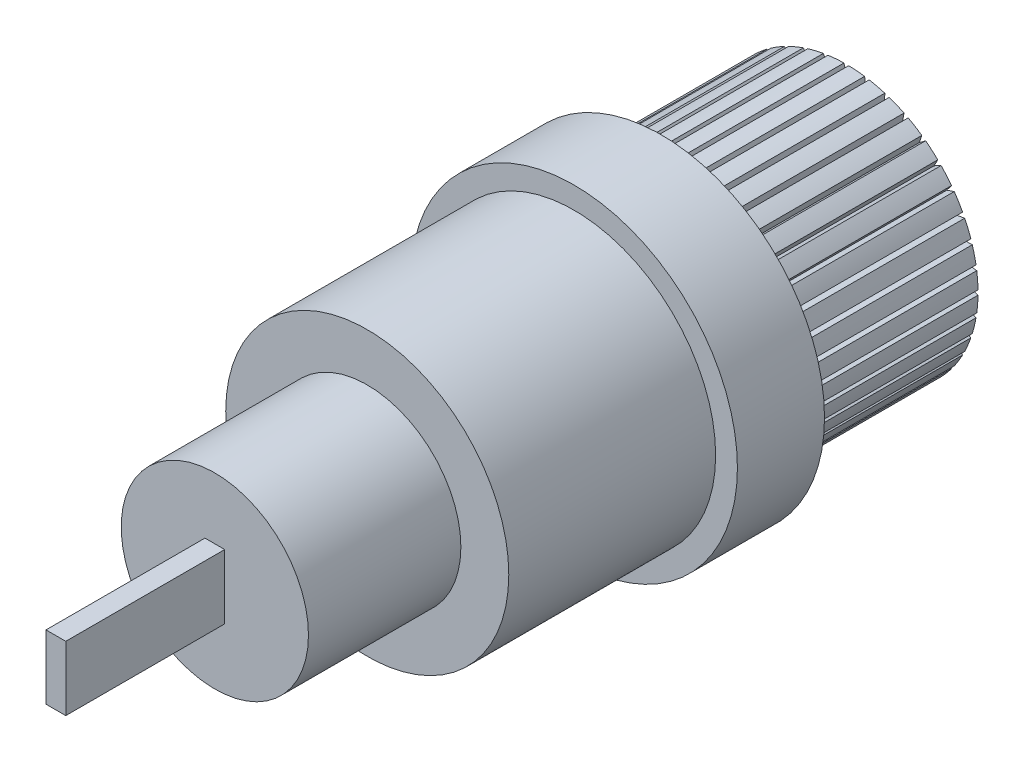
ISO-10303-21;
HEADER;
FILE_DESCRIPTION(('STEP AP214'),'2;1');
FILE_NAME('part.step','',(''),(''),'','','');
FILE_SCHEMA(('AUTOMOTIVE_DESIGN { 1 0 10303 214 1 1 1 1 }'));
ENDSEC;
DATA;
#1=APPLICATION_CONTEXT('core data for automotive mechanical design processes');
#2=APPLICATION_PROTOCOL_DEFINITION('international standard','automotive_design',2000,#1);
#3=PRODUCT_CONTEXT('',#1,'mechanical');
#4=PRODUCT('Part','Part','',(#3));
#5=PRODUCT_RELATED_PRODUCT_CATEGORY('part','',(#4));
#6=PRODUCT_DEFINITION_FORMATION('','',#4);
#7=PRODUCT_DEFINITION_CONTEXT('part definition',#1,'design');
#8=PRODUCT_DEFINITION('design','',#6,#7);
#9=PRODUCT_DEFINITION_SHAPE('','',#8);
#10=(LENGTH_UNIT() NAMED_UNIT(*) SI_UNIT(.MILLI.,.METRE.));
#11=(NAMED_UNIT(*) PLANE_ANGLE_UNIT() SI_UNIT($,.RADIAN.));
#12=(NAMED_UNIT(*) SI_UNIT($,.STERADIAN.) SOLID_ANGLE_UNIT());
#13=UNCERTAINTY_MEASURE_WITH_UNIT(LENGTH_MEASURE(1.E-05),#10,'distance_accuracy_value','');
#14=(GEOMETRIC_REPRESENTATION_CONTEXT(3) GLOBAL_UNCERTAINTY_ASSIGNED_CONTEXT((#13)) GLOBAL_UNIT_ASSIGNED_CONTEXT((#10,
#11,#12)) REPRESENTATION_CONTEXT('',''));
#15=CARTESIAN_POINT('',(0.,0.,0.));
#16=DIRECTION('',(0.,0.,1.));
#17=DIRECTION('',(1.,0.,0.));
#18=AXIS2_PLACEMENT_3D('',#15,#16,#17);
#19=CARTESIAN_POINT('',(0.,0.,8.5));
#20=DIRECTION('',(0.,0.,-1.));
#21=DIRECTION('',(-1.,0.,0.));
#22=AXIS2_PLACEMENT_3D('',#19,#20,#21);
#23=CYLINDRICAL_SURFACE('',#22,6.05);
#24=CARTESIAN_POINT('',(0.,0.,0.));
#25=DIRECTION('',(0.,0.,1.));
#26=DIRECTION('',(1.,0.,0.));
#27=AXIS2_PLACEMENT_3D('',#24,#25,#26);
#28=CIRCLE('',#27,6.05);
#29=CARTESIAN_POINT('',(1.05060354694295,-5.9580812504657,0.));
#30=VERTEX_POINT('',#29);
#31=CARTESIAN_POINT('',(1.76793950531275,-5.78592169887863,0.));
#32=VERTEX_POINT('',#31);
#33=EDGE_CURVE('E1663',#30,#32,#28,.T.);
#34=ORIENTED_EDGE('',*,*,#33,.T.);
#35=DIRECTION('',(0.,0.,-1.));
#36=VECTOR('',#35,1.);
#37=CARTESIAN_POINT('',(1.76793950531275,-5.78592169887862,8.5));
#38=LINE('',#37,#36);
#39=CARTESIAN_POINT('',(1.76793950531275,-5.78592169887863,8.5));
#40=VERTEX_POINT('',#39);
#41=EDGE_CURVE('E1512',#32,#40,#38,.F.);
#42=ORIENTED_EDGE('',*,*,#41,.T.);
#43=CARTESIAN_POINT('',(0.,0.,8.5));
#44=DIRECTION('',(0.,0.,1.));
#45=DIRECTION('',(1.,0.,0.));
#46=AXIS2_PLACEMENT_3D('',#43,#44,#45);
#47=CIRCLE('',#46,6.05);
#48=CARTESIAN_POINT('',(1.05060354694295,-5.9580812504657,8.5));
#49=VERTEX_POINT('',#48);
#50=EDGE_CURVE('E1818',#49,#40,#47,.T.);
#51=ORIENTED_EDGE('',*,*,#50,.F.);
#52=DIRECTION('',(0.,0.,-1.));
#53=VECTOR('',#52,1.);
#54=CARTESIAN_POINT('',(1.05060354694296,-5.9580812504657,8.5));
#55=LINE('',#54,#53);
#56=EDGE_CURVE('E1503',#49,#30,#55,.T.);
#57=ORIENTED_EDGE('',*,*,#56,.T.);
#58=EDGE_LOOP('',(#34,#42,#51,#57));
#59=FACE_BOUND('',#58,.T.);
#60=ADVANCED_FACE('F39',(#59),#23,.T.);
#61=CARTESIAN_POINT('',(0.105913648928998,-6.0490728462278,0.));
#62=VERTEX_POINT('',#61);
#63=CARTESIAN_POINT('',(0.841368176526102,-5.99121019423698,0.));
#64=VERTEX_POINT('',#63);
#65=EDGE_CURVE('E1667',#62,#64,#28,.T.);
#66=ORIENTED_EDGE('',*,*,#65,.T.);
#67=DIRECTION('',(0.,0.,-1.));
#68=VECTOR('',#67,1.);
#69=CARTESIAN_POINT('',(0.841368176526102,-5.99121019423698,8.5));
#70=LINE('',#69,#68);
#71=CARTESIAN_POINT('',(0.841368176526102,-5.99121019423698,8.5));
#72=VERTEX_POINT('',#71);
#73=EDGE_CURVE('E1506',#64,#72,#70,.F.);
#74=ORIENTED_EDGE('',*,*,#73,.T.);
#75=CARTESIAN_POINT('',(0.105913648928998,-6.0490728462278,8.5));
#76=VERTEX_POINT('',#75);
#77=EDGE_CURVE('E1815',#76,#72,#47,.T.);
#78=ORIENTED_EDGE('',*,*,#77,.F.);
#79=DIRECTION('',(0.,0.,-1.));
#80=VECTOR('',#79,1.);
#81=CARTESIAN_POINT('',(0.105913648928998,-6.0490728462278,8.5));
#82=LINE('',#81,#80);
#83=EDGE_CURVE('E1497',#76,#62,#82,.T.);
#84=ORIENTED_EDGE('',*,*,#83,.T.);
#85=EDGE_LOOP('',(#66,#74,#78,#84));
#86=FACE_BOUND('',#85,.T.);
#87=ADVANCED_FACE('F1925',(#86),#23,.T.);
#88=CARTESIAN_POINT('',(-0.84136817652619,-5.99121019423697,0.));
#89=VERTEX_POINT('',#88);
#90=CARTESIAN_POINT('',(-0.105913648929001,-6.0490728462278,0.));
#91=VERTEX_POINT('',#90);
#92=EDGE_CURVE('E1671',#89,#91,#28,.T.);
#93=ORIENTED_EDGE('',*,*,#92,.T.);
#94=DIRECTION('',(0.,0.,-1.));
#95=VECTOR('',#94,1.);
#96=CARTESIAN_POINT('',(-0.105913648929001,-6.0490728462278,8.5));
#97=LINE('',#96,#95);
#98=CARTESIAN_POINT('',(-0.105913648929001,-6.0490728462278,8.5));
#99=VERTEX_POINT('',#98);
#100=EDGE_CURVE('E1500',#91,#99,#97,.F.);
#101=ORIENTED_EDGE('',*,*,#100,.T.);
#102=CARTESIAN_POINT('',(-0.84136817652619,-5.99121019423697,8.5));
#103=VERTEX_POINT('',#102);
#104=EDGE_CURVE('E1812',#103,#99,#47,.T.);
#105=ORIENTED_EDGE('',*,*,#104,.F.);
#106=DIRECTION('',(0.,0.,-1.));
#107=VECTOR('',#106,1.);
#108=CARTESIAN_POINT('',(-0.84136817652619,-5.99121019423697,8.5));
#109=LINE('',#108,#107);
#110=EDGE_CURVE('E1491',#103,#89,#109,.T.);
#111=ORIENTED_EDGE('',*,*,#110,.T.);
#112=EDGE_LOOP('',(#93,#101,#105,#111));
#113=FACE_BOUND('',#112,.T.);
#114=ADVANCED_FACE('F1929',(#113),#23,.T.);
#115=CARTESIAN_POINT('',(-1.76793950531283,-5.7859216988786,0.));
#116=VERTEX_POINT('',#115);
#117=CARTESIAN_POINT('',(-1.05060354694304,-5.95808125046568,0.));
#118=VERTEX_POINT('',#117);
#119=EDGE_CURVE('E1675',#116,#118,#28,.T.);
#120=ORIENTED_EDGE('',*,*,#119,.T.);
#121=DIRECTION('',(0.,0.,-1.));
#122=VECTOR('',#121,1.);
#123=CARTESIAN_POINT('',(-1.05060354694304,-5.95808125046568,8.5));
#124=LINE('',#123,#122);
#125=CARTESIAN_POINT('',(-1.05060354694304,-5.95808125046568,8.5));
#126=VERTEX_POINT('',#125);
#127=EDGE_CURVE('E1494',#118,#126,#124,.F.);
#128=ORIENTED_EDGE('',*,*,#127,.T.);
#129=CARTESIAN_POINT('',(-1.76793950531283,-5.7859216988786,8.5));
#130=VERTEX_POINT('',#129);
#131=EDGE_CURVE('E1809',#130,#126,#47,.T.);
#132=ORIENTED_EDGE('',*,*,#131,.F.);
#133=DIRECTION('',(0.,0.,-1.));
#134=VECTOR('',#133,1.);
#135=CARTESIAN_POINT('',(-1.76793950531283,-5.7859216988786,8.5));
#136=LINE('',#135,#134);
#137=EDGE_CURVE('E1485',#130,#116,#136,.T.);
#138=ORIENTED_EDGE('',*,*,#137,.T.);
#139=EDGE_LOOP('',(#120,#128,#132,#138));
#140=FACE_BOUND('',#139,.T.);
#141=ADVANCED_FACE('F3037',(#140),#23,.T.);
#142=CARTESIAN_POINT('',(-2.65100788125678,-5.43825865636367,0.));
#143=VERTEX_POINT('',#142);
#144=CARTESIAN_POINT('',(-1.96946067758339,-5.72046542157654,0.));
#145=VERTEX_POINT('',#144);
#146=EDGE_CURVE('E1679',#143,#145,#28,.T.);
#147=ORIENTED_EDGE('',*,*,#146,.T.);
#148=DIRECTION('',(0.,0.,-1.));
#149=VECTOR('',#148,1.);
#150=CARTESIAN_POINT('',(-1.96946067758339,-5.72046542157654,8.5));
#151=LINE('',#150,#149);
#152=CARTESIAN_POINT('',(-1.96946067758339,-5.72046542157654,8.5));
#153=VERTEX_POINT('',#152);
#154=EDGE_CURVE('E1488',#145,#153,#151,.F.);
#155=ORIENTED_EDGE('',*,*,#154,.T.);
#156=CARTESIAN_POINT('',(-2.65100788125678,-5.43825865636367,8.5));
#157=VERTEX_POINT('',#156);
#158=EDGE_CURVE('E1806',#157,#153,#47,.T.);
#159=ORIENTED_EDGE('',*,*,#158,.F.);
#160=DIRECTION('',(0.,0.,-1.));
#161=VECTOR('',#160,1.);
#162=CARTESIAN_POINT('',(-2.65100788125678,-5.43825865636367,8.5));
#163=LINE('',#162,#161);
#164=EDGE_CURVE('E1479',#157,#143,#163,.T.);
#165=ORIENTED_EDGE('',*,*,#164,.T.);
#166=EDGE_LOOP('',(#147,#155,#159,#165));
#167=FACE_BOUND('',#166,.T.);
#168=ADVANCED_FACE('F3032',(#167),#23,.T.);
#169=CARTESIAN_POINT('',(-3.46884981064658,-4.9567712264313,0.));
#170=VERTEX_POINT('',#169);
#171=CARTESIAN_POINT('',(-2.83987603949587,-5.34205990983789,0.));
#172=VERTEX_POINT('',#171);
#173=EDGE_CURVE('E1683',#170,#172,#28,.T.);
#174=ORIENTED_EDGE('',*,*,#173,.T.);
#175=DIRECTION('',(0.,0.,-1.));
#176=VECTOR('',#175,1.);
#177=CARTESIAN_POINT('',(-2.83987603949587,-5.34205990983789,8.5));
#178=LINE('',#177,#176);
#179=CARTESIAN_POINT('',(-2.83987603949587,-5.34205990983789,8.5));
#180=VERTEX_POINT('',#179);
#181=EDGE_CURVE('E1482',#172,#180,#178,.F.);
#182=ORIENTED_EDGE('',*,*,#181,.T.);
#183=CARTESIAN_POINT('',(-3.46884981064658,-4.9567712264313,8.5));
#184=VERTEX_POINT('',#183);
#185=EDGE_CURVE('E1803',#184,#180,#47,.T.);
#186=ORIENTED_EDGE('',*,*,#185,.F.);
#187=DIRECTION('',(0.,0.,-1.));
#188=VECTOR('',#187,1.);
#189=CARTESIAN_POINT('',(-3.46884981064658,-4.9567712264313,8.5));
#190=LINE('',#189,#188);
#191=EDGE_CURVE('E1467',#184,#170,#190,.T.);
#192=ORIENTED_EDGE('',*,*,#191,.T.);
#193=EDGE_LOOP('',(#174,#182,#186,#192));
#194=FACE_BOUND('',#193,.T.);
#195=ADVANCED_FACE('F3021',(#194),#23,.T.);
#196=CARTESIAN_POINT('',(-4.83046348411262,-3.64268067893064,0.));
#197=VERTEX_POINT('',#196);
#198=CARTESIAN_POINT('',(-4.35140666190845,-4.2033034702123,0.));
#199=VERTEX_POINT('',#198);
#200=EDGE_CURVE('E1691',#197,#199,#28,.T.);
#201=ORIENTED_EDGE('',*,*,#200,.T.);
#202=DIRECTION('',(0.,0.,-1.));
#203=VECTOR('',#202,1.);
#204=CARTESIAN_POINT('',(-4.35140666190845,-4.2033034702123,8.5));
#205=LINE('',#204,#203);
#206=CARTESIAN_POINT('',(-4.35140666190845,-4.2033034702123,8.5));
#207=VERTEX_POINT('',#206);
#208=EDGE_CURVE('E1476',#199,#207,#205,.F.);
#209=ORIENTED_EDGE('',*,*,#208,.T.);
#210=CARTESIAN_POINT('',(-4.83046348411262,-3.64268067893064,8.5));
#211=VERTEX_POINT('',#210);
#212=EDGE_CURVE('E1797',#211,#207,#47,.T.);
#213=ORIENTED_EDGE('',*,*,#212,.F.);
#214=DIRECTION('',(0.,0.,-1.));
#215=VECTOR('',#214,1.);
#216=CARTESIAN_POINT('',(-4.83046348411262,-3.64268067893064,8.5));
#217=LINE('',#216,#215);
#218=EDGE_CURVE('E1461',#211,#197,#217,.T.);
#219=ORIENTED_EDGE('',*,*,#218,.T.);
#220=EDGE_LOOP('',(#201,#209,#213,#219));
#221=FACE_BOUND('',#220,.T.);
#222=ADVANCED_FACE('F3017',(#221),#23,.T.);
#223=CARTESIAN_POINT('',(-4.20134365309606,-4.35329892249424,8.5));
#224=VERTEX_POINT('',#223);
#225=CARTESIAN_POINT('',(-3.6404275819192,-4.83216173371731,8.5));
#226=VERTEX_POINT('',#225);
#227=EDGE_CURVE('E1800',#224,#226,#47,.T.);
#228=ORIENTED_EDGE('',*,*,#227,.F.);
#229=DIRECTION('',(0.,0.,-1.));
#230=VECTOR('',#229,1.);
#231=CARTESIAN_POINT('',(-4.20134365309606,-4.35329892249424,8.5));
#232=LINE('',#231,#230);
#233=CARTESIAN_POINT('',(-4.20134365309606,-4.35329892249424,0.));
#234=VERTEX_POINT('',#233);
#235=EDGE_CURVE('E1473',#224,#234,#232,.T.);
#236=ORIENTED_EDGE('',*,*,#235,.T.);
#237=CARTESIAN_POINT('',(-3.6404275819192,-4.83216173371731,0.));
#238=VERTEX_POINT('',#237);
#239=EDGE_CURVE('E1687',#234,#238,#28,.T.);
#240=ORIENTED_EDGE('',*,*,#239,.T.);
#241=DIRECTION('',(0.,0.,-1.));
#242=VECTOR('',#241,1.);
#243=CARTESIAN_POINT('',(-3.6404275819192,-4.83216173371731,8.5));
#244=LINE('',#243,#242);
#245=EDGE_CURVE('E1470',#238,#226,#244,.F.);
#246=ORIENTED_EDGE('',*,*,#245,.T.);
#247=EDGE_LOOP('',(#228,#236,#240,#246));
#248=FACE_BOUND('',#247,.T.);
#249=ADVANCED_FACE('F3013',(#248),#23,.T.);
#250=CARTESIAN_POINT('',(-5.34072192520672,-2.8423914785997,0.));
#251=VERTEX_POINT('',#250);
#252=CARTESIAN_POINT('',(-4.95530298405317,-3.47094689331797,0.));
#253=VERTEX_POINT('',#252);
#254=EDGE_CURVE('E1695',#251,#253,#28,.T.);
#255=ORIENTED_EDGE('',*,*,#254,.T.);
#256=DIRECTION('',(0.,0.,-1.));
#257=VECTOR('',#256,1.);
#258=CARTESIAN_POINT('',(-4.95530298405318,-3.47094689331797,8.5));
#259=LINE('',#258,#257);
#260=CARTESIAN_POINT('',(-4.95530298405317,-3.47094689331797,8.5));
#261=VERTEX_POINT('',#260);
#262=EDGE_CURVE('E1464',#253,#261,#259,.F.);
#263=ORIENTED_EDGE('',*,*,#262,.T.);
#264=CARTESIAN_POINT('',(-5.34072192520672,-2.8423914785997,8.5));
#265=VERTEX_POINT('',#264);
#266=EDGE_CURVE('E1794',#265,#261,#47,.T.);
#267=ORIENTED_EDGE('',*,*,#266,.F.);
#268=DIRECTION('',(0.,0.,-1.));
#269=VECTOR('',#268,1.);
#270=CARTESIAN_POINT('',(-5.34072192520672,-2.8423914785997,8.5));
#271=LINE('',#270,#269);
#272=EDGE_CURVE('E1455',#265,#251,#271,.T.);
#273=ORIENTED_EDGE('',*,*,#272,.T.);
#274=EDGE_LOOP('',(#255,#263,#267,#273));
#275=FACE_BOUND('',#274,.T.);
#276=ADVANCED_FACE('F3009',(#275),#23,.T.);
#277=CARTESIAN_POINT('',(-5.71955113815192,-1.97211429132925,0.));
#278=VERTEX_POINT('',#277);
#279=CARTESIAN_POINT('',(-5.43723611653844,-2.65310448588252,0.));
#280=VERTEX_POINT('',#279);
#281=EDGE_CURVE('E1699',#278,#280,#28,.T.);
#282=ORIENTED_EDGE('',*,*,#281,.T.);
#283=DIRECTION('',(0.,0.,-1.));
#284=VECTOR('',#283,1.);
#285=CARTESIAN_POINT('',(-5.43723611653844,-2.65310448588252,8.5));
#286=LINE('',#285,#284);
#287=CARTESIAN_POINT('',(-5.43723611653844,-2.65310448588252,8.5));
#288=VERTEX_POINT('',#287);
#289=EDGE_CURVE('E1458',#280,#288,#286,.F.);
#290=ORIENTED_EDGE('',*,*,#289,.T.);
#291=CARTESIAN_POINT('',(-5.71955113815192,-1.97211429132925,8.5));
#292=VERTEX_POINT('',#291);
#293=EDGE_CURVE('E1791',#292,#288,#47,.T.);
#294=ORIENTED_EDGE('',*,*,#293,.F.);
#295=DIRECTION('',(0.,0.,-1.));
#296=VECTOR('',#295,1.);
#297=CARTESIAN_POINT('',(-5.71955113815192,-1.97211429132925,8.5));
#298=LINE('',#297,#296);
#299=EDGE_CURVE('E1449',#292,#278,#298,.T.);
#300=ORIENTED_EDGE('',*,*,#299,.T.);
#301=EDGE_LOOP('',(#282,#290,#294,#300));
#302=FACE_BOUND('',#301,.T.);
#303=ADVANCED_FACE('F3005',(#302),#23,.T.);
#304=CARTESIAN_POINT('',(-5.95761263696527,-1.05325764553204,0.));
#305=VERTEX_POINT('',#304);
#306=CARTESIAN_POINT('',(-5.78532292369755,-1.76989792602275,0.));
#307=VERTEX_POINT('',#306);
#308=EDGE_CURVE('E1703',#305,#307,#28,.T.);
#309=ORIENTED_EDGE('',*,*,#308,.T.);
#310=DIRECTION('',(0.,0.,-1.));
#311=VECTOR('',#310,1.);
#312=CARTESIAN_POINT('',(-5.78532292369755,-1.76989792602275,8.5));
#313=LINE('',#312,#311);
#314=CARTESIAN_POINT('',(-5.78532292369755,-1.76989792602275,8.5));
#315=VERTEX_POINT('',#314);
#316=EDGE_CURVE('E1452',#307,#315,#313,.F.);
#317=ORIENTED_EDGE('',*,*,#316,.T.);
#318=CARTESIAN_POINT('',(-5.95761263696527,-1.05325764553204,8.5));
#319=VERTEX_POINT('',#318);
#320=EDGE_CURVE('E1788',#319,#315,#47,.T.);
#321=ORIENTED_EDGE('',*,*,#320,.F.);
#322=DIRECTION('',(0.,0.,-1.));
#323=VECTOR('',#322,1.);
#324=CARTESIAN_POINT('',(-5.95761263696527,-1.05325764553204,8.5));
#325=LINE('',#324,#323);
#326=EDGE_CURVE('E1443',#319,#305,#325,.T.);
#327=ORIENTED_EDGE('',*,*,#326,.T.);
#328=EDGE_LOOP('',(#309,#317,#321,#327));
#329=FACE_BOUND('',#328,.T.);
#330=ADVANCED_FACE('F3001',(#329),#23,.T.);
#331=CARTESIAN_POINT('',(-6.04902825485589,-0.108430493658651,0.));
#332=VERTEX_POINT('',#331);
#333=CARTESIAN_POINT('',(-5.9909717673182,-0.843064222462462,0.));
#334=VERTEX_POINT('',#333);
#335=EDGE_CURVE('E1707',#332,#334,#28,.T.);
#336=ORIENTED_EDGE('',*,*,#335,.T.);
#337=DIRECTION('',(0.,0.,-1.));
#338=VECTOR('',#337,1.);
#339=CARTESIAN_POINT('',(-5.9909717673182,-0.843064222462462,8.5));
#340=LINE('',#339,#338);
#341=CARTESIAN_POINT('',(-5.9909717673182,-0.843064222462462,8.5));
#342=VERTEX_POINT('',#341);
#343=EDGE_CURVE('E1446',#334,#342,#340,.F.);
#344=ORIENTED_EDGE('',*,*,#343,.T.);
#345=CARTESIAN_POINT('',(-6.04902825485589,-0.108430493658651,8.5));
#346=VERTEX_POINT('',#345);
#347=EDGE_CURVE('E1785',#346,#342,#47,.T.);
#348=ORIENTED_EDGE('',*,*,#347,.F.);
#349=DIRECTION('',(0.,0.,-1.));
#350=VECTOR('',#349,1.);
#351=CARTESIAN_POINT('',(-6.04902825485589,-0.10843049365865,8.5));
#352=LINE('',#351,#350);
#353=EDGE_CURVE('E1437',#346,#332,#352,.T.);
#354=ORIENTED_EDGE('',*,*,#353,.T.);
#355=EDGE_LOOP('',(#336,#344,#348,#354));
#356=FACE_BOUND('',#355,.T.);
#357=ADVANCED_FACE('F2997',(#356),#23,.T.);
#358=CARTESIAN_POINT('',(-5.99152647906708,0.83911289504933,0.));
#359=VERTEX_POINT('',#358);
#360=CARTESIAN_POINT('',(-6.0490960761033,0.104578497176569,0.));
#361=VERTEX_POINT('',#360);
#362=EDGE_CURVE('E1711',#359,#361,#28,.T.);
#363=ORIENTED_EDGE('',*,*,#362,.T.);
#364=DIRECTION('',(0.,0.,-1.));
#365=VECTOR('',#364,1.);
#366=CARTESIAN_POINT('',(-6.0490960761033,0.104578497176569,8.5));
#367=LINE('',#366,#365);
#368=CARTESIAN_POINT('',(-6.0490960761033,0.104578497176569,8.5));
#369=VERTEX_POINT('',#368);
#370=EDGE_CURVE('E1440',#361,#369,#367,.F.);
#371=ORIENTED_EDGE('',*,*,#370,.T.);
#372=CARTESIAN_POINT('',(-5.99152647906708,0.83911289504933,8.5));
#373=VERTEX_POINT('',#372);
#374=EDGE_CURVE('E1782',#373,#369,#47,.T.);
#375=ORIENTED_EDGE('',*,*,#374,.F.);
#376=DIRECTION('',(0.,0.,-1.));
#377=VECTOR('',#376,1.);
#378=CARTESIAN_POINT('',(-5.99152647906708,0.839112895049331,8.5));
#379=LINE('',#378,#377);
#380=EDGE_CURVE('E1431',#373,#359,#379,.T.);
#381=ORIENTED_EDGE('',*,*,#380,.T.);
#382=EDGE_LOOP('',(#363,#371,#375,#381));
#383=FACE_BOUND('',#382,.T.);
#384=ADVANCED_FACE('F2993',(#383),#23,.T.);
#385=CARTESIAN_POINT('',(-5.78650039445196,1.76604450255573,0.));
#386=VERTEX_POINT('',#385);
#387=CARTESIAN_POINT('',(-5.95824182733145,1.04969249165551,0.));
#388=VERTEX_POINT('',#387);
#389=EDGE_CURVE('E1715',#386,#388,#28,.T.);
#390=ORIENTED_EDGE('',*,*,#389,.T.);
#391=DIRECTION('',(0.,0.,-1.));
#392=VECTOR('',#391,1.);
#393=CARTESIAN_POINT('',(-5.95824182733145,1.04969249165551,8.5));
#394=LINE('',#393,#392);
#395=CARTESIAN_POINT('',(-5.95824182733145,1.04969249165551,8.5));
#396=VERTEX_POINT('',#395);
#397=EDGE_CURVE('E1434',#388,#396,#394,.F.);
#398=ORIENTED_EDGE('',*,*,#397,.T.);
#399=CARTESIAN_POINT('',(-5.78650039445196,1.76604450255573,8.5));
#400=VERTEX_POINT('',#399);
#401=EDGE_CURVE('E1779',#400,#396,#47,.T.);
#402=ORIENTED_EDGE('',*,*,#401,.F.);
#403=DIRECTION('',(0.,0.,-1.));
#404=VECTOR('',#403,1.);
#405=CARTESIAN_POINT('',(-5.78650039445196,1.76604450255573,8.5));
#406=LINE('',#405,#404);
#407=EDGE_CURVE('E1425',#400,#386,#406,.T.);
#408=ORIENTED_EDGE('',*,*,#407,.T.);
#409=EDGE_LOOP('',(#390,#398,#402,#408));
#410=FACE_BOUND('',#409,.T.);
#411=ADVANCED_FACE('F2989',(#410),#23,.T.);
#412=CARTESIAN_POINT('',(-5.4389756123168,2.64953661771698,0.));
#413=VERTEX_POINT('',#412);
#414=CARTESIAN_POINT('',(-5.72062558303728,1.96899541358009,0.));
#415=VERTEX_POINT('',#414);
#416=EDGE_CURVE('E1719',#413,#415,#28,.T.);
#417=ORIENTED_EDGE('',*,*,#416,.T.);
#418=DIRECTION('',(0.,0.,-1.));
#419=VECTOR('',#418,1.);
#420=CARTESIAN_POINT('',(-5.72062558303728,1.96899541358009,8.5));
#421=LINE('',#420,#419);
#422=CARTESIAN_POINT('',(-5.72062558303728,1.96899541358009,8.5));
#423=VERTEX_POINT('',#422);
#424=EDGE_CURVE('E1428',#415,#423,#421,.F.);
#425=ORIENTED_EDGE('',*,*,#424,.T.);
#426=CARTESIAN_POINT('',(-5.4389756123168,2.64953661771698,8.5));
#427=VERTEX_POINT('',#426);
#428=EDGE_CURVE('E1776',#427,#423,#47,.T.);
#429=ORIENTED_EDGE('',*,*,#428,.F.);
#430=DIRECTION('',(0.,0.,-1.));
#431=VECTOR('',#430,1.);
#432=CARTESIAN_POINT('',(-5.4389756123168,2.64953661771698,8.5));
#433=LINE('',#432,#431);
#434=EDGE_CURVE('E1419',#427,#413,#433,.T.);
#435=ORIENTED_EDGE('',*,*,#434,.T.);
#436=EDGE_LOOP('',(#417,#425,#429,#435));
#437=FACE_BOUND('',#436,.T.);
#438=ADVANCED_FACE('F2985',(#437),#23,.T.);
#439=CARTESIAN_POINT('',(-4.95748875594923,3.46782427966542,0.));
#440=VERTEX_POINT('',#439);
#441=CARTESIAN_POINT('',(-5.3420819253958,2.8398346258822,0.));
#442=VERTEX_POINT('',#441);
#443=EDGE_CURVE('E1723',#440,#442,#28,.T.);
#444=ORIENTED_EDGE('',*,*,#443,.T.);
#445=DIRECTION('',(0.,0.,-1.));
#446=VECTOR('',#445,1.);
#447=CARTESIAN_POINT('',(-5.3420819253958,2.8398346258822,8.5));
#448=LINE('',#447,#446);
#449=CARTESIAN_POINT('',(-5.3420819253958,2.8398346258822,8.5));
#450=VERTEX_POINT('',#449);
#451=EDGE_CURVE('E1422',#442,#450,#448,.F.);
#452=ORIENTED_EDGE('',*,*,#451,.T.);
#453=CARTESIAN_POINT('',(-4.95748875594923,3.46782427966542,8.5));
#454=VERTEX_POINT('',#453);
#455=EDGE_CURVE('E1773',#454,#450,#47,.T.);
#456=ORIENTED_EDGE('',*,*,#455,.F.);
#457=DIRECTION('',(0.,0.,-1.));
#458=VECTOR('',#457,1.);
#459=CARTESIAN_POINT('',(-4.95748875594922,3.46782427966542,8.5));
#460=LINE('',#459,#458);
#461=EDGE_CURVE('E1308',#454,#440,#460,.T.);
#462=ORIENTED_EDGE('',*,*,#461,.T.);
#463=EDGE_LOOP('',(#444,#452,#456,#462));
#464=FACE_BOUND('',#463,.T.);
#465=ADVANCED_FACE('F2981',(#464),#23,.T.);
#466=CARTESIAN_POINT('',(3.64042758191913,-4.83216173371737,0.));
#467=VERTEX_POINT('',#466);
#468=CARTESIAN_POINT('',(4.20134365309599,-4.3532989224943,0.));
#469=VERTEX_POINT('',#468);
#470=EDGE_CURVE('E1651',#467,#469,#28,.T.);
#471=ORIENTED_EDGE('',*,*,#470,.T.);
#472=DIRECTION('',(0.,0.,-1.));
#473=VECTOR('',#472,1.);
#474=CARTESIAN_POINT('',(4.20134365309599,-4.3532989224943,8.5));
#475=LINE('',#474,#473);
#476=CARTESIAN_POINT('',(4.20134365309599,-4.3532989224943,8.5));
#477=VERTEX_POINT('',#476);
#478=EDGE_CURVE('E1416',#469,#477,#475,.F.);
#479=ORIENTED_EDGE('',*,*,#478,.T.);
#480=CARTESIAN_POINT('',(3.64042758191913,-4.83216173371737,8.5));
#481=VERTEX_POINT('',#480);
#482=EDGE_CURVE('E1826',#481,#477,#47,.T.);
#483=ORIENTED_EDGE('',*,*,#482,.F.);
#484=DIRECTION('',(0.,0.,-1.));
#485=VECTOR('',#484,1.);
#486=CARTESIAN_POINT('',(3.64042758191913,-4.83216173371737,8.5));
#487=LINE('',#486,#485);
#488=EDGE_CURVE('E1401',#481,#467,#487,.T.);
#489=ORIENTED_EDGE('',*,*,#488,.T.);
#490=EDGE_LOOP('',(#471,#479,#483,#489));
#491=FACE_BOUND('',#490,.T.);
#492=ADVANCED_FACE('F2930',(#491),#23,.T.);
#493=CARTESIAN_POINT('',(4.35140666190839,-4.20330347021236,8.5));
#494=VERTEX_POINT('',#493);
#495=CARTESIAN_POINT('',(4.83046348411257,-3.64268067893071,8.5));
#496=VERTEX_POINT('',#495);
#497=EDGE_CURVE('E1829',#494,#496,#47,.T.);
#498=ORIENTED_EDGE('',*,*,#497,.F.);
#499=DIRECTION('',(0.,0.,-1.));
#500=VECTOR('',#499,1.);
#501=CARTESIAN_POINT('',(4.35140666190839,-4.20330347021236,8.5));
#502=LINE('',#501,#500);
#503=CARTESIAN_POINT('',(4.35140666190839,-4.20330347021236,0.));
#504=VERTEX_POINT('',#503);
#505=EDGE_CURVE('E1413',#494,#504,#502,.T.);
#506=ORIENTED_EDGE('',*,*,#505,.T.);
#507=CARTESIAN_POINT('',(4.83046348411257,-3.64268067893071,0.));
#508=VERTEX_POINT('',#507);
#509=EDGE_CURVE('E1647',#504,#508,#28,.T.);
#510=ORIENTED_EDGE('',*,*,#509,.T.);
#511=DIRECTION('',(0.,0.,-1.));
#512=VECTOR('',#511,1.);
#513=CARTESIAN_POINT('',(4.83046348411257,-3.64268067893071,8.5));
#514=LINE('',#513,#512);
#515=EDGE_CURVE('E1410',#508,#496,#514,.F.);
#516=ORIENTED_EDGE('',*,*,#515,.T.);
#517=EDGE_LOOP('',(#498,#506,#510,#516));
#518=FACE_BOUND('',#517,.T.);
#519=ADVANCED_FACE('F2935',(#518),#23,.T.);
#520=CARTESIAN_POINT('',(2.83987603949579,-5.34205990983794,0.));
#521=VERTEX_POINT('',#520);
#522=CARTESIAN_POINT('',(3.4688498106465,-4.95677122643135,0.));
#523=VERTEX_POINT('',#522);
#524=EDGE_CURVE('E1655',#521,#523,#28,.T.);
#525=ORIENTED_EDGE('',*,*,#524,.T.);
#526=DIRECTION('',(0.,0.,-1.));
#527=VECTOR('',#526,1.);
#528=CARTESIAN_POINT('',(3.4688498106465,-4.95677122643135,8.5));
#529=LINE('',#528,#527);
#530=CARTESIAN_POINT('',(3.4688498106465,-4.95677122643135,8.5));
#531=VERTEX_POINT('',#530);
#532=EDGE_CURVE('E1404',#523,#531,#529,.F.);
#533=ORIENTED_EDGE('',*,*,#532,.T.);
#534=CARTESIAN_POINT('',(2.83987603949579,-5.34205990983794,8.5));
#535=VERTEX_POINT('',#534);
#536=EDGE_CURVE('E1823',#535,#531,#47,.T.);
#537=ORIENTED_EDGE('',*,*,#536,.F.);
#538=DIRECTION('',(0.,0.,-1.));
#539=VECTOR('',#538,1.);
#540=CARTESIAN_POINT('',(2.83987603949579,-5.34205990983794,8.5));
#541=LINE('',#540,#539);
#542=EDGE_CURVE('E1395',#535,#521,#541,.T.);
#543=ORIENTED_EDGE('',*,*,#542,.T.);
#544=EDGE_LOOP('',(#525,#533,#537,#543));
#545=FACE_BOUND('',#544,.T.);
#546=ADVANCED_FACE('F2925',(#545),#23,.T.);
#547=CARTESIAN_POINT('',(1.9694606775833,-5.72046542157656,8.5));
#548=VERTEX_POINT('',#547);
#549=CARTESIAN_POINT('',(2.6510078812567,-5.43825865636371,8.5));
#550=VERTEX_POINT('',#549);
#551=EDGE_CURVE('E1820',#548,#550,#47,.T.);
#552=ORIENTED_EDGE('',*,*,#551,.F.);
#553=DIRECTION('',(0.,0.,-1.));
#554=VECTOR('',#553,1.);
#555=CARTESIAN_POINT('',(1.9694606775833,-5.72046542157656,8.5));
#556=LINE('',#555,#554);
#557=CARTESIAN_POINT('',(1.9694606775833,-5.72046542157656,0.));
#558=VERTEX_POINT('',#557);
#559=EDGE_CURVE('E1509',#548,#558,#556,.T.);
#560=ORIENTED_EDGE('',*,*,#559,.T.);
#561=CARTESIAN_POINT('',(2.6510078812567,-5.43825865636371,0.));
#562=VERTEX_POINT('',#561);
#563=EDGE_CURVE('E1659',#558,#562,#28,.T.);
#564=ORIENTED_EDGE('',*,*,#563,.T.);
#565=DIRECTION('',(0.,0.,-1.));
#566=VECTOR('',#565,1.);
#567=CARTESIAN_POINT('',(2.6510078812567,-5.43825865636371,8.5));
#568=LINE('',#567,#566);
#569=EDGE_CURVE('E1398',#562,#550,#568,.F.);
#570=ORIENTED_EDGE('',*,*,#569,.T.);
#571=EDGE_LOOP('',(#552,#560,#564,#570));
#572=FACE_BOUND('',#571,.T.);
#573=ADVANCED_FACE('F2920',(#572),#23,.T.);
#574=CARTESIAN_POINT('',(4.95530298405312,-3.47094689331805,8.5));
#575=VERTEX_POINT('',#574);
#576=CARTESIAN_POINT('',(5.34072192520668,-2.84239147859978,8.5));
#577=VERTEX_POINT('',#576);
#578=EDGE_CURVE('E1832',#575,#577,#47,.T.);
#579=ORIENTED_EDGE('',*,*,#578,.F.);
#580=DIRECTION('',(0.,0.,-1.));
#581=VECTOR('',#580,1.);
#582=CARTESIAN_POINT('',(4.95530298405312,-3.47094689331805,8.5));
#583=LINE('',#582,#581);
#584=CARTESIAN_POINT('',(4.95530298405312,-3.47094689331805,0.));
#585=VERTEX_POINT('',#584);
#586=EDGE_CURVE('E1407',#575,#585,#583,.T.);
#587=ORIENTED_EDGE('',*,*,#586,.T.);
#588=CARTESIAN_POINT('',(5.34072192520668,-2.84239147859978,0.));
#589=VERTEX_POINT('',#588);
#590=EDGE_CURVE('E1643',#585,#589,#28,.T.);
#591=ORIENTED_EDGE('',*,*,#590,.T.);
#592=DIRECTION('',(0.,0.,-1.));
#593=VECTOR('',#592,1.);
#594=CARTESIAN_POINT('',(5.34072192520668,-2.84239147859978,8.5));
#595=LINE('',#594,#593);
#596=EDGE_CURVE('E1392',#589,#577,#595,.F.);
#597=ORIENTED_EDGE('',*,*,#596,.T.);
#598=EDGE_LOOP('',(#579,#587,#591,#597));
#599=FACE_BOUND('',#598,.T.);
#600=ADVANCED_FACE('F2940',(#599),#23,.T.);
#601=CARTESIAN_POINT('',(5.4372361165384,-2.6531044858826,8.5));
#602=VERTEX_POINT('',#601);
#603=CARTESIAN_POINT('',(5.71955113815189,-1.97211429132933,8.5));
#604=VERTEX_POINT('',#603);
#605=EDGE_CURVE('E1835',#602,#604,#47,.T.);
#606=ORIENTED_EDGE('',*,*,#605,.F.);
#607=DIRECTION('',(0.,0.,-1.));
#608=VECTOR('',#607,1.);
#609=CARTESIAN_POINT('',(5.4372361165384,-2.6531044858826,8.5));
#610=LINE('',#609,#608);
#611=CARTESIAN_POINT('',(5.4372361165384,-2.6531044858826,0.));
#612=VERTEX_POINT('',#611);
#613=EDGE_CURVE('E1389',#602,#612,#610,.T.);
#614=ORIENTED_EDGE('',*,*,#613,.T.);
#615=CARTESIAN_POINT('',(5.71955113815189,-1.97211429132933,0.));
#616=VERTEX_POINT('',#615);
#617=EDGE_CURVE('E1639',#612,#616,#28,.T.);
#618=ORIENTED_EDGE('',*,*,#617,.T.);
#619=DIRECTION('',(0.,0.,-1.));
#620=VECTOR('',#619,1.);
#621=CARTESIAN_POINT('',(5.71955113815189,-1.97211429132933,8.5));
#622=LINE('',#621,#620);
#623=EDGE_CURVE('E1386',#616,#604,#622,.F.);
#624=ORIENTED_EDGE('',*,*,#623,.T.);
#625=EDGE_LOOP('',(#606,#614,#618,#624));
#626=FACE_BOUND('',#625,.T.);
#627=ADVANCED_FACE('F2945',(#626),#23,.T.);
#628=CARTESIAN_POINT('',(5.78532292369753,-1.76989792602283,8.5));
#629=VERTEX_POINT('',#628);
#630=CARTESIAN_POINT('',(5.95761263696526,-1.05325764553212,8.5));
#631=VERTEX_POINT('',#630);
#632=EDGE_CURVE('E1838',#629,#631,#47,.T.);
#633=ORIENTED_EDGE('',*,*,#632,.F.);
#634=DIRECTION('',(0.,0.,-1.));
#635=VECTOR('',#634,1.);
#636=CARTESIAN_POINT('',(5.78532292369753,-1.76989792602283,8.5));
#637=LINE('',#636,#635);
#638=CARTESIAN_POINT('',(5.78532292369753,-1.76989792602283,0.));
#639=VERTEX_POINT('',#638);
#640=EDGE_CURVE('E1383',#629,#639,#637,.T.);
#641=ORIENTED_EDGE('',*,*,#640,.T.);
#642=CARTESIAN_POINT('',(5.95761263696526,-1.05325764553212,0.));
#643=VERTEX_POINT('',#642);
#644=EDGE_CURVE('E1635',#639,#643,#28,.T.);
#645=ORIENTED_EDGE('',*,*,#644,.T.);
#646=DIRECTION('',(0.,0.,-1.));
#647=VECTOR('',#646,1.);
#648=CARTESIAN_POINT('',(5.95761263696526,-1.05325764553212,8.5));
#649=LINE('',#648,#647);
#650=EDGE_CURVE('E1380',#643,#631,#649,.F.);
#651=ORIENTED_EDGE('',*,*,#650,.T.);
#652=EDGE_LOOP('',(#633,#641,#645,#651));
#653=FACE_BOUND('',#652,.T.);
#654=ADVANCED_FACE('F2950',(#653),#23,.T.);
#655=CARTESIAN_POINT('',(5.99097176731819,-0.84306422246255,8.5));
#656=VERTEX_POINT('',#655);
#657=CARTESIAN_POINT('',(6.04902825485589,-0.108430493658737,8.5));
#658=VERTEX_POINT('',#657);
#659=EDGE_CURVE('E1841',#656,#658,#47,.T.);
#660=ORIENTED_EDGE('',*,*,#659,.F.);
#661=DIRECTION('',(0.,0.,-1.));
#662=VECTOR('',#661,1.);
#663=CARTESIAN_POINT('',(5.99097176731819,-0.843064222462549,8.5));
#664=LINE('',#663,#662);
#665=CARTESIAN_POINT('',(5.99097176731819,-0.84306422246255,0.));
#666=VERTEX_POINT('',#665);
#667=EDGE_CURVE('E1377',#656,#666,#664,.T.);
#668=ORIENTED_EDGE('',*,*,#667,.T.);
#669=CARTESIAN_POINT('',(6.04902825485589,-0.108430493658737,0.));
#670=VERTEX_POINT('',#669);
#671=EDGE_CURVE('E1631',#666,#670,#28,.T.);
#672=ORIENTED_EDGE('',*,*,#671,.T.);
#673=DIRECTION('',(0.,0.,-1.));
#674=VECTOR('',#673,1.);
#675=CARTESIAN_POINT('',(6.04902825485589,-0.108430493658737,8.5));
#676=LINE('',#675,#674);
#677=EDGE_CURVE('E1374',#670,#658,#676,.F.);
#678=ORIENTED_EDGE('',*,*,#677,.T.);
#679=EDGE_LOOP('',(#660,#668,#672,#678));
#680=FACE_BOUND('',#679,.T.);
#681=ADVANCED_FACE('F2955',(#680),#23,.T.);
#682=CARTESIAN_POINT('',(2.65163333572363,5.43795371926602,0.));
#683=VERTEX_POINT('',#682);
#684=CARTESIAN_POINT('',(1.97164916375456,5.71971149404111,0.));
#685=VERTEX_POINT('',#684);
#686=EDGE_CURVE('E1599',#683,#685,#28,.T.);
#687=ORIENTED_EDGE('',*,*,#686,.T.);
#688=DIRECTION('',(0.,0.,-1.));
#689=VECTOR('',#688,1.);
#690=CARTESIAN_POINT('',(1.97164916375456,5.71971149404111,8.5));
#691=LINE('',#690,#689);
#692=CARTESIAN_POINT('',(1.97164916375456,5.71971149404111,8.5));
#693=VERTEX_POINT('',#692);
#694=EDGE_CURVE('E1368',#685,#693,#691,.F.);
#695=ORIENTED_EDGE('',*,*,#694,.T.);
#696=CARTESIAN_POINT('',(2.65163333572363,5.43795371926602,8.5));
#697=VERTEX_POINT('',#696);
#698=EDGE_CURVE('E1587',#697,#693,#47,.T.);
#699=ORIENTED_EDGE('',*,*,#698,.F.);
#700=DIRECTION('',(0.,0.,-1.));
#701=VECTOR('',#700,1.);
#702=CARTESIAN_POINT('',(2.65163333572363,5.43795371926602,8.5));
#703=LINE('',#702,#701);
#704=EDGE_CURVE('E1359',#697,#683,#703,.T.);
#705=ORIENTED_EDGE('',*,*,#704,.T.);
#706=EDGE_LOOP('',(#687,#695,#699,#705));
#707=FACE_BOUND('',#706,.T.);
#708=ADVANCED_FACE('F1870',(#707),#23,.T.);
#709=CARTESIAN_POINT('',(3.46992154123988,4.95602103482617,0.));
#710=VERTEX_POINT('',#709);
#711=CARTESIAN_POINT('',(2.84235008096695,5.3407439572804,0.));
#712=VERTEX_POINT('',#711);
#713=EDGE_CURVE('E1603',#710,#712,#28,.T.);
#714=ORIENTED_EDGE('',*,*,#713,.T.);
#715=DIRECTION('',(0.,0.,-1.));
#716=VECTOR('',#715,1.);
#717=CARTESIAN_POINT('',(2.84235008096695,5.3407439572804,8.5));
#718=LINE('',#717,#716);
#719=CARTESIAN_POINT('',(2.84235008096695,5.3407439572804,8.5));
#720=VERTEX_POINT('',#719);
#721=EDGE_CURVE('E1362',#712,#720,#718,.F.);
#722=ORIENTED_EDGE('',*,*,#721,.T.);
#723=CARTESIAN_POINT('',(3.46992154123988,4.95602103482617,8.5));
#724=VERTEX_POINT('',#723);
#725=EDGE_CURVE('E1862',#724,#720,#47,.T.);
#726=ORIENTED_EDGE('',*,*,#725,.F.);
#727=DIRECTION('',(0.,0.,-1.));
#728=VECTOR('',#727,1.);
#729=CARTESIAN_POINT('',(3.46992154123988,4.95602103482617,8.5));
#730=LINE('',#729,#728);
#731=EDGE_CURVE('E1347',#724,#710,#730,.T.);
#732=ORIENTED_EDGE('',*,*,#731,.T.);
#733=EDGE_LOOP('',(#714,#722,#726,#732));
#734=FACE_BOUND('',#733,.T.);
#735=ADVANCED_FACE('F2021',(#734),#23,.T.);
#736=CARTESIAN_POINT('',(4.83192138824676,3.6407465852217,0.));
#737=VERTEX_POINT('',#736);
#738=CARTESIAN_POINT('',(4.35387927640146,4.2007422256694,0.));
#739=VERTEX_POINT('',#738);
#740=EDGE_CURVE('E1611',#737,#739,#28,.T.);
#741=ORIENTED_EDGE('',*,*,#740,.T.);
#742=DIRECTION('',(0.,0.,-1.));
#743=VECTOR('',#742,1.);
#744=CARTESIAN_POINT('',(4.35387927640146,4.2007422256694,8.5));
#745=LINE('',#744,#743);
#746=CARTESIAN_POINT('',(4.35387927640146,4.2007422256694,8.5));
#747=VERTEX_POINT('',#746);
#748=EDGE_CURVE('E1356',#739,#747,#745,.F.);
#749=ORIENTED_EDGE('',*,*,#748,.T.);
#750=CARTESIAN_POINT('',(4.83192138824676,3.6407465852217,8.5));
#751=VERTEX_POINT('',#750);
#752=EDGE_CURVE('E1856',#751,#747,#47,.T.);
#753=ORIENTED_EDGE('',*,*,#752,.F.);
#754=DIRECTION('',(0.,0.,-1.));
#755=VECTOR('',#754,1.);
#756=CARTESIAN_POINT('',(4.83192138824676,3.6407465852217,8.5));
#757=LINE('',#756,#755);
#758=EDGE_CURVE('E1341',#751,#737,#757,.T.);
#759=ORIENTED_EDGE('',*,*,#758,.T.);
#760=EDGE_LOOP('',(#741,#749,#753,#759));
#761=FACE_BOUND('',#760,.T.);
#762=ADVANCED_FACE('F2003',(#761),#23,.T.);
#763=CARTESIAN_POINT('',(4.2027022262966,4.35198736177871,8.5));
#764=VERTEX_POINT('',#763);
#765=CARTESIAN_POINT('',(3.64299952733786,4.83022302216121,8.5));
#766=VERTEX_POINT('',#765);
#767=EDGE_CURVE('E1859',#764,#766,#47,.T.);
#768=ORIENTED_EDGE('',*,*,#767,.F.);
#769=DIRECTION('',(0.,0.,-1.));
#770=VECTOR('',#769,1.);
#771=CARTESIAN_POINT('',(4.2027022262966,4.35198736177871,8.5));
#772=LINE('',#771,#770);
#773=CARTESIAN_POINT('',(4.2027022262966,4.35198736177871,0.));
#774=VERTEX_POINT('',#773);
#775=EDGE_CURVE('E1353',#764,#774,#772,.T.);
#776=ORIENTED_EDGE('',*,*,#775,.T.);
#777=CARTESIAN_POINT('',(3.64299952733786,4.83022302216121,0.));
#778=VERTEX_POINT('',#777);
#779=EDGE_CURVE('E1607',#774,#778,#28,.T.);
#780=ORIENTED_EDGE('',*,*,#779,.T.);
#781=DIRECTION('',(0.,0.,-1.));
#782=VECTOR('',#781,1.);
#783=CARTESIAN_POINT('',(3.64299952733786,4.83022302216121,8.5));
#784=LINE('',#783,#782);
#785=EDGE_CURVE('E1350',#778,#766,#784,.F.);
#786=ORIENTED_EDGE('',*,*,#785,.T.);
#787=EDGE_LOOP('',(#768,#776,#780,#786));
#788=FACE_BOUND('',#787,.T.);
#789=ADVANCED_FACE('F2012',(#788),#23,.T.);
#790=CARTESIAN_POINT('',(5.34208192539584,2.83983462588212,0.));
#791=VERTEX_POINT('',#790);
#792=CARTESIAN_POINT('',(4.95748875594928,3.46782427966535,0.));
#793=VERTEX_POINT('',#792);
#794=EDGE_CURVE('E1615',#791,#793,#28,.T.);
#795=ORIENTED_EDGE('',*,*,#794,.T.);
#796=DIRECTION('',(0.,0.,-1.));
#797=VECTOR('',#796,1.);
#798=CARTESIAN_POINT('',(4.95748875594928,3.46782427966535,8.5));
#799=LINE('',#798,#797);
#800=CARTESIAN_POINT('',(4.95748875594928,3.46782427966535,8.5));
#801=VERTEX_POINT('',#800);
#802=EDGE_CURVE('E1344',#793,#801,#799,.F.);
#803=ORIENTED_EDGE('',*,*,#802,.T.);
#804=CARTESIAN_POINT('',(5.34208192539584,2.83983462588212,8.5));
#805=VERTEX_POINT('',#804);
#806=EDGE_CURVE('E1853',#805,#801,#47,.T.);
#807=ORIENTED_EDGE('',*,*,#806,.F.);
#808=DIRECTION('',(0.,0.,-1.));
#809=VECTOR('',#808,1.);
#810=CARTESIAN_POINT('',(5.34208192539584,2.83983462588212,8.5));
#811=LINE('',#810,#809);
#812=EDGE_CURVE('E1335',#805,#791,#811,.T.);
#813=ORIENTED_EDGE('',*,*,#812,.T.);
#814=EDGE_LOOP('',(#795,#803,#807,#813));
#815=FACE_BOUND('',#814,.T.);
#816=ADVANCED_FACE('F1994',(#815),#23,.T.);
#817=CARTESIAN_POINT('',(5.7206255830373,1.96899541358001,0.));
#818=VERTEX_POINT('',#817);
#819=CARTESIAN_POINT('',(5.43897561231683,2.6495366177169,0.));
#820=VERTEX_POINT('',#819);
#821=EDGE_CURVE('E1619',#818,#820,#28,.T.);
#822=ORIENTED_EDGE('',*,*,#821,.T.);
#823=DIRECTION('',(0.,0.,-1.));
#824=VECTOR('',#823,1.);
#825=CARTESIAN_POINT('',(5.43897561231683,2.6495366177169,8.5));
#826=LINE('',#825,#824);
#827=CARTESIAN_POINT('',(5.43897561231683,2.6495366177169,8.5));
#828=VERTEX_POINT('',#827);
#829=EDGE_CURVE('E1338',#820,#828,#826,.F.);
#830=ORIENTED_EDGE('',*,*,#829,.T.);
#831=CARTESIAN_POINT('',(5.7206255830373,1.96899541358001,8.5));
#832=VERTEX_POINT('',#831);
#833=EDGE_CURVE('E1850',#832,#828,#47,.T.);
#834=ORIENTED_EDGE('',*,*,#833,.F.);
#835=DIRECTION('',(0.,0.,-1.));
#836=VECTOR('',#835,1.);
#837=CARTESIAN_POINT('',(5.7206255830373,1.96899541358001,8.5));
#838=LINE('',#837,#836);
#839=EDGE_CURVE('E1329',#832,#818,#838,.T.);
#840=ORIENTED_EDGE('',*,*,#839,.T.);
#841=EDGE_LOOP('',(#822,#830,#834,#840));
#842=FACE_BOUND('',#841,.T.);
#843=ADVANCED_FACE('F1967',(#842),#23,.T.);
#844=CARTESIAN_POINT('',(5.95824182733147,1.04969249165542,0.));
#845=VERTEX_POINT('',#844);
#846=CARTESIAN_POINT('',(5.78650039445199,1.76604450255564,0.));
#847=VERTEX_POINT('',#846);
#848=EDGE_CURVE('E1623',#845,#847,#28,.T.);
#849=ORIENTED_EDGE('',*,*,#848,.T.);
#850=DIRECTION('',(0.,0.,-1.));
#851=VECTOR('',#850,1.);
#852=CARTESIAN_POINT('',(5.78650039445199,1.76604450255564,8.5));
#853=LINE('',#852,#851);
#854=CARTESIAN_POINT('',(5.78650039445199,1.76604450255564,8.5));
#855=VERTEX_POINT('',#854);
#856=EDGE_CURVE('E1332',#847,#855,#853,.F.);
#857=ORIENTED_EDGE('',*,*,#856,.T.);
#858=CARTESIAN_POINT('',(5.95824182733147,1.04969249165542,8.5));
#859=VERTEX_POINT('',#858);
#860=EDGE_CURVE('E1847',#859,#855,#47,.T.);
#861=ORIENTED_EDGE('',*,*,#860,.F.);
#862=DIRECTION('',(0.,0.,-1.));
#863=VECTOR('',#862,1.);
#864=CARTESIAN_POINT('',(5.95824182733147,1.04969249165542,8.5));
#865=LINE('',#864,#863);
#866=EDGE_CURVE('E1323',#859,#845,#865,.T.);
#867=ORIENTED_EDGE('',*,*,#866,.T.);
#868=EDGE_LOOP('',(#849,#857,#861,#867));
#869=FACE_BOUND('',#868,.T.);
#870=ADVANCED_FACE('F1963',(#869),#23,.T.);
#871=CARTESIAN_POINT('',(6.0490960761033,0.104578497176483,8.5));
#872=VERTEX_POINT('',#871);
#873=CARTESIAN_POINT('',(5.99152647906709,0.839112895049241,8.5));
#874=VERTEX_POINT('',#873);
#875=EDGE_CURVE('E1844',#872,#874,#47,.T.);
#876=ORIENTED_EDGE('',*,*,#875,.F.);
#877=DIRECTION('',(0.,0.,-1.));
#878=VECTOR('',#877,1.);
#879=CARTESIAN_POINT('',(6.0490960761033,0.104578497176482,8.5));
#880=LINE('',#879,#878);
#881=CARTESIAN_POINT('',(6.0490960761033,0.104578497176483,0.));
#882=VERTEX_POINT('',#881);
#883=EDGE_CURVE('E1371',#872,#882,#880,.T.);
#884=ORIENTED_EDGE('',*,*,#883,.T.);
#885=CARTESIAN_POINT('',(5.99152647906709,0.839112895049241,0.));
#886=VERTEX_POINT('',#885);
#887=EDGE_CURVE('E1627',#882,#886,#28,.T.);
#888=ORIENTED_EDGE('',*,*,#887,.T.);
#889=DIRECTION('',(0.,0.,-1.));
#890=VECTOR('',#889,1.);
#891=CARTESIAN_POINT('',(5.99152647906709,0.83911289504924,8.5));
#892=LINE('',#891,#890);
#893=EDGE_CURVE('E1326',#886,#874,#892,.F.);
#894=ORIENTED_EDGE('',*,*,#893,.T.);
#895=EDGE_LOOP('',(#876,#884,#888,#894));
#896=FACE_BOUND('',#895,.T.);
#897=ADVANCED_FACE('F1959',(#896),#23,.T.);
#898=CARTESIAN_POINT('',(-1.97164916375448,5.71971149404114,0.));
#899=VERTEX_POINT('',#898);
#900=CARTESIAN_POINT('',(-2.65163333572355,5.43795371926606,0.));
#901=VERTEX_POINT('',#900);
#902=EDGE_CURVE('E1593',#899,#901,#28,.T.);
#903=ORIENTED_EDGE('',*,*,#902,.T.);
#904=DIRECTION('',(0.,0.,-1.));
#905=VECTOR('',#904,1.);
#906=CARTESIAN_POINT('',(-2.65163333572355,5.43795371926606,8.5));
#907=LINE('',#906,#905);
#908=CARTESIAN_POINT('',(-2.65163333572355,5.43795371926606,8.5));
#909=VERTEX_POINT('',#908);
#910=EDGE_CURVE('E1320',#901,#909,#907,.F.);
#911=ORIENTED_EDGE('',*,*,#910,.T.);
#912=CARTESIAN_POINT('',(-1.97164916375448,5.71971149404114,8.5));
#913=VERTEX_POINT('',#912);
#914=EDGE_CURVE('E1582',#913,#909,#47,.T.);
#915=ORIENTED_EDGE('',*,*,#914,.F.);
#916=DIRECTION('',(0.,0.,-1.));
#917=VECTOR('',#916,1.);
#918=CARTESIAN_POINT('',(-1.97164916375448,5.71971149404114,8.5));
#919=LINE('',#918,#917);
#920=EDGE_CURVE('E1296',#913,#899,#919,.T.);
#921=ORIENTED_EDGE('',*,*,#920,.T.);
#922=EDGE_LOOP('',(#903,#911,#915,#921));
#923=FACE_BOUND('',#922,.T.);
#924=ADVANCED_FACE('F1744',(#923),#23,.T.);
#925=CARTESIAN_POINT('',(-2.84235008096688,5.34074395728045,8.5));
#926=VERTEX_POINT('',#925);
#927=CARTESIAN_POINT('',(-3.46992154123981,4.95602103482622,8.5));
#928=VERTEX_POINT('',#927);
#929=EDGE_CURVE('E814',#926,#928,#47,.T.);
#930=ORIENTED_EDGE('',*,*,#929,.F.);
#931=DIRECTION('',(0.,0.,-1.));
#932=VECTOR('',#931,1.);
#933=CARTESIAN_POINT('',(-2.84235008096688,5.34074395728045,8.5));
#934=LINE('',#933,#932);
#935=CARTESIAN_POINT('',(-2.84235008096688,5.34074395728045,0.));
#936=VERTEX_POINT('',#935);
#937=EDGE_CURVE('E1317',#926,#936,#934,.T.);
#938=ORIENTED_EDGE('',*,*,#937,.T.);
#939=CARTESIAN_POINT('',(-3.46992154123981,4.95602103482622,0.));
#940=VERTEX_POINT('',#939);
#941=EDGE_CURVE('E1735',#936,#940,#28,.T.);
#942=ORIENTED_EDGE('',*,*,#941,.T.);
#943=DIRECTION('',(0.,0.,-1.));
#944=VECTOR('',#943,1.);
#945=CARTESIAN_POINT('',(-3.46992154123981,4.95602103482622,8.5));
#946=LINE('',#945,#944);
#947=EDGE_CURVE('E1315',#940,#928,#946,.F.);
#948=ORIENTED_EDGE('',*,*,#947,.T.);
#949=EDGE_LOOP('',(#930,#938,#942,#948));
#950=FACE_BOUND('',#949,.T.);
#951=ADVANCED_FACE('F1760',(#950),#23,.T.);
#952=CARTESIAN_POINT('',(-4.3538792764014,4.20074222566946,0.));
#953=VERTEX_POINT('',#952);
#954=CARTESIAN_POINT('',(-4.83192138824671,3.64074658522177,0.));
#955=VERTEX_POINT('',#954);
#956=EDGE_CURVE('E1727',#953,#955,#28,.T.);
#957=ORIENTED_EDGE('',*,*,#956,.T.);
#958=DIRECTION('',(0.,0.,-1.));
#959=VECTOR('',#958,1.);
#960=CARTESIAN_POINT('',(-4.83192138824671,3.64074658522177,8.5));
#961=LINE('',#960,#959);
#962=CARTESIAN_POINT('',(-4.83192138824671,3.64074658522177,8.5));
#963=VERTEX_POINT('',#962);
#964=EDGE_CURVE('E1311',#955,#963,#961,.F.);
#965=ORIENTED_EDGE('',*,*,#964,.T.);
#966=CARTESIAN_POINT('',(-4.3538792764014,4.20074222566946,8.5));
#967=VERTEX_POINT('',#966);
#968=EDGE_CURVE('E1771',#967,#963,#47,.T.);
#969=ORIENTED_EDGE('',*,*,#968,.F.);
#970=DIRECTION('',(0.,0.,-1.));
#971=VECTOR('',#970,1.);
#972=CARTESIAN_POINT('',(-4.3538792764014,4.20074222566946,8.5));
#973=LINE('',#972,#971);
#974=EDGE_CURVE('E1302',#967,#953,#973,.T.);
#975=ORIENTED_EDGE('',*,*,#974,.T.);
#976=EDGE_LOOP('',(#957,#965,#969,#975));
#977=FACE_BOUND('',#976,.T.);
#978=ADVANCED_FACE('F1949',(#977),#23,.T.);
#979=CARTESIAN_POINT('',(-3.64299952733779,4.83022302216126,8.5));
#980=VERTEX_POINT('',#979);
#981=CARTESIAN_POINT('',(-4.20270222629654,4.35198736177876,8.5));
#982=VERTEX_POINT('',#981);
#983=EDGE_CURVE('E1764',#980,#982,#47,.T.);
#984=ORIENTED_EDGE('',*,*,#983,.F.);
#985=DIRECTION('',(0.,0.,-1.));
#986=VECTOR('',#985,1.);
#987=CARTESIAN_POINT('',(-3.64299952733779,4.83022302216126,8.5));
#988=LINE('',#987,#986);
#989=CARTESIAN_POINT('',(-3.64299952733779,4.83022302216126,0.));
#990=VERTEX_POINT('',#989);
#991=EDGE_CURVE('E825',#980,#990,#988,.T.);
#992=ORIENTED_EDGE('',*,*,#991,.T.);
#993=CARTESIAN_POINT('',(-4.20270222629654,4.35198736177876,0.));
#994=VERTEX_POINT('',#993);
#995=EDGE_CURVE('E1731',#990,#994,#28,.T.);
#996=ORIENTED_EDGE('',*,*,#995,.T.);
#997=DIRECTION('',(0.,0.,-1.));
#998=VECTOR('',#997,1.);
#999=CARTESIAN_POINT('',(-4.20270222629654,4.35198736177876,8.5));
#1000=LINE('',#999,#998);
#1001=EDGE_CURVE('E1305',#994,#982,#1000,.F.);
#1002=ORIENTED_EDGE('',*,*,#1001,.T.);
#1003=EDGE_LOOP('',(#984,#992,#996,#1002));
#1004=FACE_BOUND('',#1003,.T.);
#1005=ADVANCED_FACE('F1763',(#1004),#23,.T.);
#1006=CARTESIAN_POINT('',(-1.05234677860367,5.95777359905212,0.));
#1007=VERTEX_POINT('',#1006);
#1008=CARTESIAN_POINT('',(-1.7680029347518,5.78590231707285,0.));
#1009=VERTEX_POINT('',#1008);
#1010=EDGE_CURVE('E1589',#1007,#1009,#28,.T.);
#1011=ORIENTED_EDGE('',*,*,#1010,.T.);
#1012=DIRECTION('',(0.,0.,-1.));
#1013=VECTOR('',#1012,1.);
#1014=CARTESIAN_POINT('',(-1.7680029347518,5.78590231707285,8.5));
#1015=LINE('',#1014,#1013);
#1016=CARTESIAN_POINT('',(-1.7680029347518,5.78590231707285,8.5));
#1017=VERTEX_POINT('',#1016);
#1018=EDGE_CURVE('E1299',#1009,#1017,#1015,.F.);
#1019=ORIENTED_EDGE('',*,*,#1018,.T.);
#1020=CARTESIAN_POINT('',(-1.05234677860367,5.95777359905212,8.5));
#1021=VERTEX_POINT('',#1020);
#1022=EDGE_CURVE('E1578',#1021,#1017,#47,.T.);
#1023=ORIENTED_EDGE('',*,*,#1022,.F.);
#1024=DIRECTION('',(0.,0.,-1.));
#1025=VECTOR('',#1024,1.);
#1026=CARTESIAN_POINT('',(-1.05234677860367,5.95777359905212,8.5));
#1027=LINE('',#1026,#1025);
#1028=EDGE_CURVE('E1290',#1021,#1007,#1027,.T.);
#1029=ORIENTED_EDGE('',*,*,#1028,.T.);
#1030=EDGE_LOOP('',(#1011,#1019,#1023,#1029));
#1031=FACE_BOUND('',#1030,.T.);
#1032=ADVANCED_FACE('F1909',(#1031),#23,.T.);
#1033=CARTESIAN_POINT('',(-0.107095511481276,6.04905203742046,0.));
#1034=VERTEX_POINT('',#1033);
#1035=CARTESIAN_POINT('',(-0.840808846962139,5.99128871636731,0.));
#1036=VERTEX_POINT('',#1035);
#1037=EDGE_CURVE('E43',#1034,#1036,#28,.T.);
#1038=ORIENTED_EDGE('',*,*,#1037,.T.);
#1039=DIRECTION('',(0.,0.,-1.));
#1040=VECTOR('',#1039,1.);
#1041=CARTESIAN_POINT('',(-0.840808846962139,5.99128871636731,8.5));
#1042=LINE('',#1041,#1040);
#1043=CARTESIAN_POINT('',(-0.840808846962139,5.99128871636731,8.5));
#1044=VERTEX_POINT('',#1043);
#1045=EDGE_CURVE('E1293',#1036,#1044,#1042,.F.);
#1046=ORIENTED_EDGE('',*,*,#1045,.T.);
#1047=CARTESIAN_POINT('',(-0.107095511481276,6.04905203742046,8.5));
#1048=VERTEX_POINT('',#1047);
#1049=EDGE_CURVE('E1571',#1048,#1044,#47,.T.);
#1050=ORIENTED_EDGE('',*,*,#1049,.F.);
#1051=DIRECTION('',(0.,0.,-1.));
#1052=VECTOR('',#1051,1.);
#1053=CARTESIAN_POINT('',(-0.107095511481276,6.04905203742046,8.5));
#1054=LINE('',#1053,#1052);
#1055=EDGE_CURVE('E1526',#1048,#1034,#1054,.T.);
#1056=ORIENTED_EDGE('',*,*,#1055,.T.);
#1057=EDGE_LOOP('',(#1038,#1046,#1050,#1056));
#1058=FACE_BOUND('',#1057,.T.);
#1059=ADVANCED_FACE('F1898',(#1058),#23,.T.);
#1060=CARTESIAN_POINT('',(1.76800293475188,5.78590231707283,8.5));
#1061=VERTEX_POINT('',#1060);
#1062=CARTESIAN_POINT('',(1.05234677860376,5.95777359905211,8.5));
#1063=VERTEX_POINT('',#1062);
#1064=EDGE_CURVE('E1583',#1061,#1063,#47,.T.);
#1065=ORIENTED_EDGE('',*,*,#1064,.F.);
#1066=DIRECTION('',(0.,0.,-1.));
#1067=VECTOR('',#1066,1.);
#1068=CARTESIAN_POINT('',(1.76800293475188,5.78590231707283,8.5));
#1069=LINE('',#1068,#1067);
#1070=CARTESIAN_POINT('',(1.76800293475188,5.78590231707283,0.));
#1071=VERTEX_POINT('',#1070);
#1072=EDGE_CURVE('E1365',#1061,#1071,#1069,.T.);
#1073=ORIENTED_EDGE('',*,*,#1072,.T.);
#1074=CARTESIAN_POINT('',(1.05234677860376,5.95777359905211,0.));
#1075=VERTEX_POINT('',#1074);
#1076=EDGE_CURVE('E1594',#1071,#1075,#28,.T.);
#1077=ORIENTED_EDGE('',*,*,#1076,.T.);
#1078=DIRECTION('',(0.,0.,-1.));
#1079=VECTOR('',#1078,1.);
#1080=CARTESIAN_POINT('',(1.05234677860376,5.95777359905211,8.5));
#1081=LINE('',#1080,#1079);
#1082=EDGE_CURVE('E1287',#1075,#1063,#1081,.F.);
#1083=ORIENTED_EDGE('',*,*,#1082,.T.);
#1084=EDGE_LOOP('',(#1065,#1073,#1077,#1083));
#1085=FACE_BOUND('',#1084,.T.);
#1086=ADVANCED_FACE('F1881',(#1085),#23,.T.);
#1087=CARTESIAN_POINT('',(0.,0.,29.));
#1088=DIRECTION('',(0.,0.,1.));
#1089=DIRECTION('',(1.,0.,0.));
#1090=AXIS2_PLACEMENT_3D('',#1087,#1088,#1089);
#1091=PLANE('',#1090);
#1092=CARTESIAN_POINT('',(0.,0.,29.));
#1093=DIRECTION('',(0.,0.,1.));
#1094=DIRECTION('',(1.,0.,0.));
#1095=AXIS2_PLACEMENT_3D('',#1092,#1093,#1094);
#1096=CIRCLE('',#1095,4.3);
#1097=CARTESIAN_POINT('',(4.3,0.,29.));
#1098=VERTEX_POINT('',#1097);
#1099=EDGE_CURVE('E1562',#1098,#1098,#1096,.T.);
#1100=ORIENTED_EDGE('',*,*,#1099,.T.);
#1101=EDGE_LOOP('',(#1100));
#1102=FACE_BOUND('',#1101,.T.);
#1103=DIRECTION('',(-1.,0.,0.));
#1104=VECTOR('',#1103,1.);
#1105=CARTESIAN_POINT('',(-0.454014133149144,1.47845627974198,29.));
#1106=LINE('',#1105,#1104);
#1107=CARTESIAN_POINT('',(0.454014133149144,1.47845627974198,29.));
#1108=VERTEX_POINT('',#1107);
#1109=CARTESIAN_POINT('',(-0.454014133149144,1.47845627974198,29.));
#1110=VERTEX_POINT('',#1109);
#1111=EDGE_CURVE('E1547',#1108,#1110,#1106,.T.);
#1112=ORIENTED_EDGE('',*,*,#1111,.F.);
#1113=DIRECTION('',(0.,1.,0.));
#1114=VECTOR('',#1113,1.);
#1115=CARTESIAN_POINT('',(0.454014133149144,1.47845627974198,29.));
#1116=LINE('',#1115,#1114);
#1117=CARTESIAN_POINT('',(0.454014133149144,-1.47845627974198,29.));
#1118=VERTEX_POINT('',#1117);
#1119=EDGE_CURVE('E1533',#1118,#1108,#1116,.T.);
#1120=ORIENTED_EDGE('',*,*,#1119,.F.);
#1121=DIRECTION('',(1.,0.,0.));
#1122=VECTOR('',#1121,1.);
#1123=CARTESIAN_POINT('',(-0.454014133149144,-1.47845627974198,29.));
#1124=LINE('',#1123,#1122);
#1125=CARTESIAN_POINT('',(-0.454014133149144,-1.47845627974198,29.));
#1126=VERTEX_POINT('',#1125);
#1127=EDGE_CURVE('E1538',#1126,#1118,#1124,.T.);
#1128=ORIENTED_EDGE('',*,*,#1127,.F.);
#1129=DIRECTION('',(0.,-1.,0.));
#1130=VECTOR('',#1129,1.);
#1131=CARTESIAN_POINT('',(-0.454014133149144,1.47845627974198,29.));
#1132=LINE('',#1131,#1130);
#1133=EDGE_CURVE('E1549',#1110,#1126,#1132,.T.);
#1134=ORIENTED_EDGE('',*,*,#1133,.F.);
#1135=EDGE_LOOP('',(#1112,#1120,#1128,#1134));
#1136=FACE_BOUND('',#1135,.T.);
#1137=ADVANCED_FACE('F1931',(#1102,#1136),#1091,.T.);
#1138=CARTESIAN_POINT('',(0.840808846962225,5.99128871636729,8.5));
#1139=VERTEX_POINT('',#1138);
#1140=CARTESIAN_POINT('',(0.107095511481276,6.04905203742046,8.5));
#1141=VERTEX_POINT('',#1140);
#1142=EDGE_CURVE('E1579',#1139,#1141,#47,.T.);
#1143=ORIENTED_EDGE('',*,*,#1142,.F.);
#1144=DIRECTION('',(0.,0.,-1.));
#1145=VECTOR('',#1144,1.);
#1146=CARTESIAN_POINT('',(0.840808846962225,5.99128871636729,8.5));
#1147=LINE('',#1146,#1145);
#1148=CARTESIAN_POINT('',(0.840808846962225,5.99128871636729,0.));
#1149=VERTEX_POINT('',#1148);
#1150=EDGE_CURVE('E1283',#1139,#1149,#1147,.T.);
#1151=ORIENTED_EDGE('',*,*,#1150,.T.);
#1152=CARTESIAN_POINT('',(0.107095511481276,6.04905203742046,0.));
#1153=VERTEX_POINT('',#1152);
#1154=EDGE_CURVE('E1575',#1149,#1153,#28,.T.);
#1155=ORIENTED_EDGE('',*,*,#1154,.T.);
#1156=DIRECTION('',(0.,0.,-1.));
#1157=VECTOR('',#1156,1.);
#1158=CARTESIAN_POINT('',(0.107095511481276,6.04905203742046,8.5));
#1159=LINE('',#1158,#1157);
#1160=EDGE_CURVE('E1530',#1153,#1141,#1159,.F.);
#1161=ORIENTED_EDGE('',*,*,#1160,.T.);
#1162=EDGE_LOOP('',(#1143,#1151,#1155,#1161));
#1163=FACE_BOUND('',#1162,.T.);
#1164=ADVANCED_FACE('F41',(#1163),#23,.T.);
#1165=CARTESIAN_POINT('',(0.,0.,0.));
#1166=DIRECTION('',(0.,0.,1.));
#1167=DIRECTION('',(1.,0.,0.));
#1168=AXIS2_PLACEMENT_3D('',#1165,#1166,#1167);
#1169=PLANE('',#1168);
#1170=DIRECTION('',(0.574390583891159,-0.818581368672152,0.));
#1171=VECTOR('',#1170,1.);
#1172=CARTESIAN_POINT('',(1.76199524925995,-5.4248001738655,0.));
#1173=LINE('',#1172,#1171);
#1174=CARTESIAN_POINT('',(1.76199524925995,-5.42480017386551,0.));
#1175=VERTEX_POINT('',#1174);
#1176=EDGE_CURVE('E989',#1175,#558,#1173,.T.);
#1177=ORIENTED_EDGE('',*,*,#1176,.F.);
#1178=DIRECTION('',(-0.0164583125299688,0.999864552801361,0.));
#1179=VECTOR('',#1178,1.);
#1180=CARTESIAN_POINT('',(1.77963159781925,-6.49623199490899,0.));
#1181=LINE('',#1180,#1179);
#1182=EDGE_CURVE('E992',#32,#1175,#1181,.T.);
#1183=ORIENTED_EDGE('',*,*,#1182,.F.);
#1184=ORIENTED_EDGE('',*,*,#33,.F.);
#1185=DIRECTION('',(0.439264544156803,-0.898357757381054,0.));
#1186=VECTOR('',#1185,1.);
#1187=CARTESIAN_POINT('',(0.891979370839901,-5.63367250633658,0.));
#1188=LINE('',#1187,#1186);
#1189=CARTESIAN_POINT('',(0.891979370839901,-5.63367250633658,0.));
#1190=VERTEX_POINT('',#1189);
#1191=EDGE_CURVE('E1001',#1190,#30,#1188,.T.);
#1192=ORIENTED_EDGE('',*,*,#1191,.F.);
#1193=DIRECTION('',(0.14015759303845,0.990129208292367,0.));
#1194=VECTOR('',#1193,1.);
#1195=CARTESIAN_POINT('',(0.741789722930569,-6.69467215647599,0.));
#1196=LINE('',#1195,#1194);
#1197=EDGE_CURVE('E1004',#64,#1190,#1196,.T.);
#1198=ORIENTED_EDGE('',*,*,#1197,.F.);
#1199=ORIENTED_EDGE('',*,*,#65,.F.);
#1200=DIRECTION('',(0.293322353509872,-0.956013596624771,0.));
#1201=VECTOR('',#1200,1.);
#1202=CARTESIAN_POINT('',(0.,-5.70387280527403,0.));
#1203=LINE('',#1202,#1201);
#1204=CARTESIAN_POINT('',(0.,-5.70387280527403,0.));
#1205=VERTEX_POINT('',#1204);
#1206=EDGE_CURVE('E1011',#1205,#62,#1203,.T.);
#1207=ORIENTED_EDGE('',*,*,#1206,.F.);
#1208=DIRECTION('',(0.293322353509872,0.956013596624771,0.));
#1209=VECTOR('',#1208,1.);
#1210=CARTESIAN_POINT('',(-0.314317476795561,-6.72831495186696,0.));
#1211=LINE('',#1210,#1209);
#1212=EDGE_CURVE('E1014',#91,#1205,#1211,.T.);
#1213=ORIENTED_EDGE('',*,*,#1212,.F.);
#1214=ORIENTED_EDGE('',*,*,#92,.F.);
#1215=DIRECTION('',(0.140157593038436,-0.990129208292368,0.));
#1216=VECTOR('',#1215,1.);
#1217=CARTESIAN_POINT('',(-0.891979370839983,-5.63367250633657,0.));
#1218=LINE('',#1217,#1216);
#1219=CARTESIAN_POINT('',(-0.891979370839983,-5.63367250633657,0.));
#1220=VERTEX_POINT('',#1219);
#1221=EDGE_CURVE('E1023',#1220,#89,#1218,.T.);
#1222=ORIENTED_EDGE('',*,*,#1221,.F.);
#1223=DIRECTION('',(0.439264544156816,0.898357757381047,0.));
#1224=VECTOR('',#1223,1.);
#1225=CARTESIAN_POINT('',(-1.36268513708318,-6.59633198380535,0.));
#1226=LINE('',#1225,#1224);
#1227=EDGE_CURVE('E1026',#118,#1220,#1226,.T.);
#1228=ORIENTED_EDGE('',*,*,#1227,.F.);
#1229=ORIENTED_EDGE('',*,*,#119,.F.);
#1230=DIRECTION('',(-0.0164583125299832,-0.999864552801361,0.));
#1231=VECTOR('',#1230,1.);
#1232=CARTESIAN_POINT('',(-1.76199524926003,-5.42480017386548,0.));
#1233=LINE('',#1232,#1231);
#1234=CARTESIAN_POINT('',(-1.76199524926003,-5.42480017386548,0.));
#1235=VERTEX_POINT('',#1234);
#1236=EDGE_CURVE('E1035',#1235,#116,#1233,.T.);
#1237=ORIENTED_EDGE('',*,*,#1236,.F.);
#1238=DIRECTION('',(0.574390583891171,0.818581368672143,0.));
#1239=VECTOR('',#1238,1.);
#1240=CARTESIAN_POINT('',(-2.37749896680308,-6.3019731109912,0.));
#1241=LINE('',#1240,#1239);
#1242=EDGE_CURVE('E1038',#145,#1235,#1241,.T.);
#1243=ORIENTED_EDGE('',*,*,#1242,.F.);
#1244=ORIENTED_EDGE('',*,*,#146,.F.);
#1245=DIRECTION('',(-0.172668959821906,-0.984979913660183,0.));
#1246=VECTOR('',#1245,1.);
#1247=CARTESIAN_POINT('',(-2.58862495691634,-5.08239893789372,0.));
#1248=LINE('',#1247,#1246);
#1249=CARTESIAN_POINT('',(-2.58862495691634,-5.08239893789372,0.));
#1250=VERTEX_POINT('',#1249);
#1251=EDGE_CURVE('E1047',#1250,#143,#1248,.T.);
#1252=ORIENTED_EDGE('',*,*,#1251,.F.);
#1253=DIRECTION('',(0.69537322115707,0.718648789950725,0.));
#1254=VECTOR('',#1253,1.);
#1255=CARTESIAN_POINT('',(-3.33377088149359,-5.85248642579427,0.));
#1256=LINE('',#1255,#1254);
#1257=EDGE_CURVE('E1050',#172,#1250,#1256,.T.);
#1258=ORIENTED_EDGE('',*,*,#1257,.F.);
#1259=ORIENTED_EDGE('',*,*,#173,.F.);
#1260=DIRECTION('',(-0.324627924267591,-0.945841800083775,0.));
#1261=VECTOR('',#1260,1.);
#1262=CARTESIAN_POINT('',(-3.35151412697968,-4.61489985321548,0.));
#1263=LINE('',#1262,#1261);
#1264=CARTESIAN_POINT('',(-3.35151412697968,-4.61489985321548,0.));
#1265=VERTEX_POINT('',#1264);
#1266=EDGE_CURVE('E1071',#1265,#170,#1263,.T.);
#1267=ORIENTED_EDGE('',*,*,#1266,.F.);
#1268=DIRECTION('',(0.799233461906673,0.601020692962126,0.));
#1269=VECTOR('',#1268,1.);
#1270=CARTESIAN_POINT('',(-4.20795429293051,-5.2589397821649,0.));
#1271=LINE('',#1270,#1269);
#1272=EDGE_CURVE('E1069',#238,#1265,#1271,.T.);
#1273=ORIENTED_EDGE('',*,*,#1272,.F.);
#1274=ORIENTED_EDGE('',*,*,#239,.F.);
#1275=DIRECTION('',(-0.468593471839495,-0.88341392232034,0.));
#1276=VECTOR('',#1275,1.);
#1277=CARTESIAN_POINT('',(-4.0318778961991,-4.03381429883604,0.));
#1278=LINE('',#1277,#1276);
#1279=CARTESIAN_POINT('',(-4.0318778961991,-4.03381429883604,0.));
#1280=VERTEX_POINT('',#1279);
#1281=EDGE_CURVE('E1059',#1280,#234,#1278,.T.);
#1282=ORIENTED_EDGE('',*,*,#1281,.F.);
#1283=DIRECTION('',(0.883413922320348,0.46859347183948,0.));
#1284=VECTOR('',#1283,1.);
#1285=CARTESIAN_POINT('',(-4.97852390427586,-4.53594826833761,0.));
#1286=LINE('',#1285,#1284);
#1287=EDGE_CURVE('E905',#199,#1280,#1286,.T.);
#1288=ORIENTED_EDGE('',*,*,#1287,.F.);
#1289=ORIENTED_EDGE('',*,*,#200,.F.);
#1290=DIRECTION('',(-0.601020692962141,-0.799233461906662,0.));
#1291=VECTOR('',#1290,1.);
#1292=CARTESIAN_POINT('',(-4.61296345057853,-3.3534505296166,0.));
#1293=LINE('',#1292,#1291);
#1294=CARTESIAN_POINT('',(-4.61296345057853,-3.3534505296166,0.));
#1295=VERTEX_POINT('',#1294);
#1296=EDGE_CURVE('E893',#1295,#197,#1293,.T.);
#1297=ORIENTED_EDGE('',*,*,#1296,.F.);
#1298=DIRECTION('',(0.945841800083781,0.324627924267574,0.));
#1299=VECTOR('',#1298,1.);
#1300=CARTESIAN_POINT('',(-5.62650573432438,-3.7013143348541,0.));
#1301=LINE('',#1300,#1299);
#1302=EDGE_CURVE('E896',#253,#1295,#1301,.T.);
#1303=ORIENTED_EDGE('',*,*,#1302,.F.);
#1304=ORIENTED_EDGE('',*,*,#254,.F.);
#1305=DIRECTION('',(-0.718648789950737,-0.695373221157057,0.));
#1306=VECTOR('',#1305,1.);
#1307=CARTESIAN_POINT('',(-5.08046253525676,-2.59056135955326,0.));
#1308=LINE('',#1307,#1306);
#1309=CARTESIAN_POINT('',(-5.08046253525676,-2.59056135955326,0.));
#1310=VERTEX_POINT('',#1309);
#1311=EDGE_CURVE('E907',#1310,#251,#1308,.T.);
#1312=ORIENTED_EDGE('',*,*,#1311,.F.);
#1313=DIRECTION('',(0.984979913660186,0.172668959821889,0.));
#1314=VECTOR('',#1313,1.);
#1315=CARTESIAN_POINT('',(-6.13594431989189,-2.77558943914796,0.));
#1316=LINE('',#1315,#1314);
#1317=EDGE_CURVE('E910',#280,#1310,#1316,.T.);
#1318=ORIENTED_EDGE('',*,*,#1317,.F.);
#1319=ORIENTED_EDGE('',*,*,#281,.F.);
#1320=DIRECTION('',(-0.818581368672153,-0.574390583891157,0.));
#1321=VECTOR('',#1320,1.);
#1322=CARTESIAN_POINT('',(-5.4228637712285,-1.76393165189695,0.));
#1323=LINE('',#1322,#1321);
#1324=CARTESIAN_POINT('',(-5.4228637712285,-1.76393165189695,0.));
#1325=VERTEX_POINT('',#1324);
#1326=EDGE_CURVE('E919',#1325,#278,#1323,.T.);
#1327=ORIENTED_EDGE('',*,*,#1326,.F.);
#1328=DIRECTION('',(0.999864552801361,0.0164583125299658,0.));
#1329=VECTOR('',#1328,1.);
#1330=CARTESIAN_POINT('',(-6.49429559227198,-1.78156800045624,0.));
#1331=LINE('',#1330,#1329);
#1332=EDGE_CURVE('E922',#307,#1325,#1331,.T.);
#1333=ORIENTED_EDGE('',*,*,#1332,.F.);
#1334=ORIENTED_EDGE('',*,*,#308,.F.);
#1335=DIRECTION('',(-0.898357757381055,-0.4392645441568,0.));
#1336=VECTOR('',#1335,1.);
#1337=CARTESIAN_POINT('',(-5.63173610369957,-0.893915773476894,0.));
#1338=LINE('',#1337,#1336);
#1339=CARTESIAN_POINT('',(-5.63173610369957,-0.893915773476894,0.));
#1340=VERTEX_POINT('',#1339);
#1341=EDGE_CURVE('E931',#1340,#305,#1338,.T.);
#1342=ORIENTED_EDGE('',*,*,#1341,.F.);
#1343=DIRECTION('',(0.990129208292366,-0.140157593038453,0.));
#1344=VECTOR('',#1343,1.);
#1345=CARTESIAN_POINT('',(-6.69273575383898,-0.743726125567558,0.));
#1346=LINE('',#1345,#1344);
#1347=EDGE_CURVE('E934',#334,#1340,#1346,.T.);
#1348=ORIENTED_EDGE('',*,*,#1347,.F.);
#1349=ORIENTED_EDGE('',*,*,#335,.F.);
#1350=DIRECTION('',(-0.956013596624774,-0.293322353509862,0.));
#1351=VECTOR('',#1350,1.);
#1352=CARTESIAN_POINT('',(-5.70193640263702,-0.00193640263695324,0.));
#1353=LINE('',#1352,#1351);
#1354=CARTESIAN_POINT('',(-5.70193640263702,-0.00193640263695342,0.));
#1355=VERTEX_POINT('',#1354);
#1356=EDGE_CURVE('E943',#1355,#332,#1353,.T.);
#1357=ORIENTED_EDGE('',*,*,#1356,.F.);
#1358=DIRECTION('',(0.956013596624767,-0.293322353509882,0.));
#1359=VECTOR('',#1358,1.);
#1360=CARTESIAN_POINT('',(-6.72637854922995,0.312381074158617,0.));
#1361=LINE('',#1360,#1359);
#1362=EDGE_CURVE('E946',#361,#1355,#1361,.T.);
#1363=ORIENTED_EDGE('',*,*,#1362,.F.);
#1364=ORIENTED_EDGE('',*,*,#362,.F.);
#1365=DIRECTION('',(-0.990129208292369,-0.140157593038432,0.));
#1366=VECTOR('',#1365,1.);
#1367=CARTESIAN_POINT('',(-5.63173610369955,0.890042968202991,0.));
#1368=LINE('',#1367,#1366);
#1369=CARTESIAN_POINT('',(-5.63173610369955,0.890042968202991,0.));
#1370=VERTEX_POINT('',#1369);
#1371=EDGE_CURVE('E955',#1370,#359,#1368,.T.);
#1372=ORIENTED_EDGE('',*,*,#1371,.F.);
#1373=DIRECTION('',(0.898357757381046,-0.439264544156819,0.));
#1374=VECTOR('',#1373,1.);
#1375=CARTESIAN_POINT('',(-6.59439558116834,1.36074873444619,0.));
#1376=LINE('',#1375,#1374);
#1377=EDGE_CURVE('E958',#388,#1370,#1376,.T.);
#1378=ORIENTED_EDGE('',*,*,#1377,.F.);
#1379=ORIENTED_EDGE('',*,*,#389,.F.);
#1380=DIRECTION('',(-0.999864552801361,0.0164583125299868,0.));
#1381=VECTOR('',#1380,1.);
#1382=CARTESIAN_POINT('',(-5.42286377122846,1.76005884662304,0.));
#1383=LINE('',#1382,#1381);
#1384=CARTESIAN_POINT('',(-5.42286377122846,1.76005884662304,0.));
#1385=VERTEX_POINT('',#1384);
#1386=EDGE_CURVE('E967',#1385,#386,#1383,.T.);
#1387=ORIENTED_EDGE('',*,*,#1386,.F.);
#1388=DIRECTION('',(0.818581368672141,-0.574390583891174,0.));
#1389=VECTOR('',#1388,1.);
#1390=CARTESIAN_POINT('',(-6.30003670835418,2.37556256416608,0.));
#1391=LINE('',#1390,#1389);
#1392=EDGE_CURVE('E970',#415,#1385,#1391,.T.);
#1393=ORIENTED_EDGE('',*,*,#1392,.F.);
#1394=ORIENTED_EDGE('',*,*,#416,.F.);
#1395=DIRECTION('',(-0.984979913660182,0.172668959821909,0.));
#1396=VECTOR('',#1395,1.);
#1397=CARTESIAN_POINT('',(-5.0804625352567,2.58668855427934,0.));
#1398=LINE('',#1397,#1396);
#1399=CARTESIAN_POINT('',(-5.0804625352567,2.58668855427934,0.));
#1400=VERTEX_POINT('',#1399);
#1401=EDGE_CURVE('E979',#1400,#413,#1398,.T.);
#1402=ORIENTED_EDGE('',*,*,#1401,.F.);
#1403=DIRECTION('',(0.718648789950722,-0.695373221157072,0.));
#1404=VECTOR('',#1403,1.);
#1405=CARTESIAN_POINT('',(-5.85055002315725,3.3318344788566,0.));
#1406=LINE('',#1405,#1404);
#1407=EDGE_CURVE('E868',#442,#1400,#1406,.T.);
#1408=ORIENTED_EDGE('',*,*,#1407,.F.);
#1409=ORIENTED_EDGE('',*,*,#443,.F.);
#1410=DIRECTION('',(-0.945841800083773,0.324627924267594,0.));
#1411=VECTOR('',#1410,1.);
#1412=CARTESIAN_POINT('',(-4.61296345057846,3.34957772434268,0.));
#1413=LINE('',#1412,#1411);
#1414=CARTESIAN_POINT('',(-4.61296345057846,3.34957772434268,0.));
#1415=VERTEX_POINT('',#1414);
#1416=EDGE_CURVE('E858',#1415,#440,#1413,.T.);
#1417=ORIENTED_EDGE('',*,*,#1416,.F.);
#1418=DIRECTION('',(0.601020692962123,-0.799233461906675,0.));
#1419=VECTOR('',#1418,1.);
#1420=CARTESIAN_POINT('',(-5.25700337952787,4.20601789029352,0.));
#1421=LINE('',#1420,#1419);
#1422=EDGE_CURVE('E856',#955,#1415,#1421,.T.);
#1423=ORIENTED_EDGE('',*,*,#1422,.F.);
#1424=ORIENTED_EDGE('',*,*,#956,.F.);
#1425=DIRECTION('',(-0.883413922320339,0.468593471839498,0.));
#1426=VECTOR('',#1425,1.);
#1427=CARTESIAN_POINT('',(-4.03187789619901,4.0299414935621,0.));
#1428=LINE('',#1427,#1426);
#1429=CARTESIAN_POINT('',(-4.03187789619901,4.0299414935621,0.));
#1430=VERTEX_POINT('',#1429);
#1431=EDGE_CURVE('E846',#1430,#953,#1428,.T.);
#1432=ORIENTED_EDGE('',*,*,#1431,.F.);
#1433=DIRECTION('',(0.468593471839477,-0.88341392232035,0.));
#1434=VECTOR('',#1433,1.);
#1435=CARTESIAN_POINT('',(-4.53401186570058,4.97658750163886,0.));
#1436=LINE('',#1435,#1434);
#1437=EDGE_CURVE('E826',#994,#1430,#1436,.T.);
#1438=ORIENTED_EDGE('',*,*,#1437,.F.);
#1439=ORIENTED_EDGE('',*,*,#995,.F.);
#1440=DIRECTION('',(-0.79923346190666,0.601020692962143,0.));
#1441=VECTOR('',#1440,1.);
#1442=CARTESIAN_POINT('',(-3.35151412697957,4.61102704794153,0.));
#1443=LINE('',#1442,#1441);
#1444=CARTESIAN_POINT('',(-3.35151412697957,4.61102704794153,0.));
#1445=VERTEX_POINT('',#1444);
#1446=EDGE_CURVE('E819',#1445,#990,#1443,.T.);
#1447=ORIENTED_EDGE('',*,*,#1446,.F.);
#1448=DIRECTION('',(0.32462792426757,-0.945841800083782,0.));
#1449=VECTOR('',#1448,1.);
#1450=CARTESIAN_POINT('',(-3.69937793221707,5.62456933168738,0.));
#1451=LINE('',#1450,#1449);
#1452=EDGE_CURVE('E830',#940,#1445,#1451,.T.);
#1453=ORIENTED_EDGE('',*,*,#1452,.F.);
#1454=ORIENTED_EDGE('',*,*,#941,.F.);
#1455=DIRECTION('',(-0.695373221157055,0.718648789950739,0.));
#1456=VECTOR('',#1455,1.);
#1457=CARTESIAN_POINT('',(-2.58862495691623,5.07852613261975,0.));
#1458=LINE('',#1457,#1456);
#1459=CARTESIAN_POINT('',(-2.58862495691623,5.07852613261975,0.));
#1460=VERTEX_POINT('',#1459);
#1461=EDGE_CURVE('E834',#1460,#936,#1458,.T.);
#1462=ORIENTED_EDGE('',*,*,#1461,.F.);
#1463=DIRECTION('',(0.172668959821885,-0.984979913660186,0.));
#1464=VECTOR('',#1463,1.);
#1465=CARTESIAN_POINT('',(-2.77365303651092,6.13400791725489,0.));
#1466=LINE('',#1465,#1464);
#1467=EDGE_CURVE('E837',#901,#1460,#1466,.T.);
#1468=ORIENTED_EDGE('',*,*,#1467,.F.);
#1469=ORIENTED_EDGE('',*,*,#902,.F.);
#1470=DIRECTION('',(-0.574390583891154,0.818581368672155,0.));
#1471=VECTOR('',#1470,1.);
#1472=CARTESIAN_POINT('',(-1.76199524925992,5.42092736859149,0.));
#1473=LINE('',#1472,#1471);
#1474=CARTESIAN_POINT('',(-1.76199524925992,5.42092736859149,0.));
#1475=VERTEX_POINT('',#1474);
#1476=EDGE_CURVE('E870',#1475,#899,#1473,.T.);
#1477=ORIENTED_EDGE('',*,*,#1476,.F.);
#1478=DIRECTION('',(0.0164583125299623,-0.999864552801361,0.));
#1479=VECTOR('',#1478,1.);
#1480=CARTESIAN_POINT('',(-1.77963159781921,6.49235918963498,0.));
#1481=LINE('',#1480,#1479);
#1482=EDGE_CURVE('E873',#1009,#1475,#1481,.T.);
#1483=ORIENTED_EDGE('',*,*,#1482,.F.);
#1484=ORIENTED_EDGE('',*,*,#1010,.F.);
#1485=DIRECTION('',(-0.439264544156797,0.898357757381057,0.));
#1486=VECTOR('',#1485,1.);
#1487=CARTESIAN_POINT('',(-0.891979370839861,5.62979970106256,0.));
#1488=LINE('',#1487,#1486);
#1489=CARTESIAN_POINT('',(-0.891979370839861,5.62979970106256,0.));
#1490=VERTEX_POINT('',#1489);
#1491=EDGE_CURVE('E882',#1490,#1007,#1488,.T.);
#1492=ORIENTED_EDGE('',*,*,#1491,.F.);
#1493=DIRECTION('',(-0.140157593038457,-0.990129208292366,0.));
#1494=VECTOR('',#1493,1.);
#1495=CARTESIAN_POINT('',(-0.741789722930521,6.69079935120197,0.));
#1496=LINE('',#1495,#1494);
#1497=EDGE_CURVE('E885',#1036,#1490,#1496,.T.);
#1498=ORIENTED_EDGE('',*,*,#1497,.F.);
#1499=ORIENTED_EDGE('',*,*,#1037,.F.);
#1500=DIRECTION('',(-0.293322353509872,0.956013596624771,0.));
#1501=VECTOR('',#1500,1.);
#1502=CARTESIAN_POINT('',(0.,5.7,0.));
#1503=LINE('',#1502,#1501);
#1504=CARTESIAN_POINT('',(0.,5.7,0.));
#1505=VERTEX_POINT('',#1504);
#1506=EDGE_CURVE('E1516',#1505,#1034,#1503,.T.);
#1507=ORIENTED_EDGE('',*,*,#1506,.F.);
#1508=DIRECTION('',(-0.293322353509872,-0.956013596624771,0.));
#1509=VECTOR('',#1508,1.);
#1510=CARTESIAN_POINT('',(0.314317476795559,6.72444214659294,0.));
#1511=LINE('',#1510,#1509);
#1512=EDGE_CURVE('E1515',#1153,#1505,#1511,.T.);
#1513=ORIENTED_EDGE('',*,*,#1512,.F.);
#1514=ORIENTED_EDGE('',*,*,#1154,.F.);
#1515=DIRECTION('',(-0.140157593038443,0.990129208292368,0.));
#1516=VECTOR('',#1515,1.);
#1517=CARTESIAN_POINT('',(0.891979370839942,5.62979970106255,0.));
#1518=LINE('',#1517,#1516);
#1519=CARTESIAN_POINT('',(0.891979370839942,5.62979970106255,0.));
#1520=VERTEX_POINT('',#1519);
#1521=EDGE_CURVE('E1273',#1520,#1149,#1518,.T.);
#1522=ORIENTED_EDGE('',*,*,#1521,.F.);
#1523=DIRECTION('',(-0.43926454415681,-0.898357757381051,0.));
#1524=VECTOR('',#1523,1.);
#1525=CARTESIAN_POINT('',(1.36268513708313,6.59245917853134,0.));
#1526=LINE('',#1525,#1524);
#1527=EDGE_CURVE('E1143',#1075,#1520,#1526,.T.);
#1528=ORIENTED_EDGE('',*,*,#1527,.F.);
#1529=ORIENTED_EDGE('',*,*,#1076,.F.);
#1530=DIRECTION('',(0.0164583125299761,0.999864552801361,0.));
#1531=VECTOR('',#1530,1.);
#1532=CARTESIAN_POINT('',(1.76199524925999,5.42092736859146,0.));
#1533=LINE('',#1532,#1531);
#1534=CARTESIAN_POINT('',(1.76199524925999,5.42092736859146,0.));
#1535=VERTEX_POINT('',#1534);
#1536=EDGE_CURVE('E1131',#1535,#1071,#1533,.T.);
#1537=ORIENTED_EDGE('',*,*,#1536,.F.);
#1538=DIRECTION('',(-0.574390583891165,-0.818581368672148,0.));
#1539=VECTOR('',#1538,1.);
#1540=CARTESIAN_POINT('',(2.37749896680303,6.29810030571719,0.));
#1541=LINE('',#1540,#1539);
#1542=EDGE_CURVE('E1134',#685,#1535,#1541,.T.);
#1543=ORIENTED_EDGE('',*,*,#1542,.F.);
#1544=ORIENTED_EDGE('',*,*,#686,.F.);
#1545=DIRECTION('',(0.172668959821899,0.984979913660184,0.));
#1546=VECTOR('',#1545,1.);
#1547=CARTESIAN_POINT('',(2.5886249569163,5.07852613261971,0.));
#1548=LINE('',#1547,#1546);
#1549=CARTESIAN_POINT('',(2.5886249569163,5.07852613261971,0.));
#1550=VERTEX_POINT('',#1549);
#1551=EDGE_CURVE('E1145',#1550,#683,#1548,.T.);
#1552=ORIENTED_EDGE('',*,*,#1551,.F.);
#1553=DIRECTION('',(-0.695373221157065,-0.71864878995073,0.));
#1554=VECTOR('',#1553,1.);
#1555=CARTESIAN_POINT('',(3.33377088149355,5.84861362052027,0.));
#1556=LINE('',#1555,#1554);
#1557=EDGE_CURVE('E1148',#712,#1550,#1556,.T.);
#1558=ORIENTED_EDGE('',*,*,#1557,.F.);
#1559=ORIENTED_EDGE('',*,*,#713,.F.);
#1560=DIRECTION('',(0.324627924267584,0.945841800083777,0.));
#1561=VECTOR('',#1560,1.);
#1562=CARTESIAN_POINT('',(3.35151412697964,4.61102704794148,0.));
#1563=LINE('',#1562,#1561);
#1564=CARTESIAN_POINT('',(3.35151412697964,4.61102704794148,0.));
#1565=VERTEX_POINT('',#1564);
#1566=EDGE_CURVE('E1169',#1565,#710,#1563,.T.);
#1567=ORIENTED_EDGE('',*,*,#1566,.F.);
#1568=DIRECTION('',(-0.799233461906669,-0.601020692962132,0.));
#1569=VECTOR('',#1568,1.);
#1570=CARTESIAN_POINT('',(4.20795429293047,5.2550669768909,0.));
#1571=LINE('',#1570,#1569);
#1572=EDGE_CURVE('E1167',#778,#1565,#1571,.T.);
#1573=ORIENTED_EDGE('',*,*,#1572,.F.);
#1574=ORIENTED_EDGE('',*,*,#779,.F.);
#1575=DIRECTION('',(0.468593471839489,0.883413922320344,0.));
#1576=VECTOR('',#1575,1.);
#1577=CARTESIAN_POINT('',(4.03187789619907,4.02994149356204,0.));
#1578=LINE('',#1577,#1576);
#1579=CARTESIAN_POINT('',(4.03187789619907,4.02994149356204,0.));
#1580=VERTEX_POINT('',#1579);
#1581=EDGE_CURVE('E1157',#1580,#774,#1578,.T.);
#1582=ORIENTED_EDGE('',*,*,#1581,.F.);
#1583=DIRECTION('',(-0.883413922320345,-0.468593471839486,0.));
#1584=VECTOR('',#1583,1.);
#1585=CARTESIAN_POINT('',(4.97852390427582,4.53207546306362,0.));
#1586=LINE('',#1585,#1584);
#1587=EDGE_CURVE('E1093',#739,#1580,#1586,.T.);
#1588=ORIENTED_EDGE('',*,*,#1587,.F.);
#1589=ORIENTED_EDGE('',*,*,#740,.F.);
#1590=DIRECTION('',(0.601020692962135,0.799233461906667,0.));
#1591=VECTOR('',#1590,1.);
#1592=CARTESIAN_POINT('',(4.6129634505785,3.34957772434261,0.));
#1593=LINE('',#1592,#1591);
#1594=CARTESIAN_POINT('',(4.6129634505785,3.34957772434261,0.));
#1595=VERTEX_POINT('',#1594);
#1596=EDGE_CURVE('E1081',#1595,#737,#1593,.T.);
#1597=ORIENTED_EDGE('',*,*,#1596,.F.);
#1598=DIRECTION('',(-0.945841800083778,-0.324627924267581,0.));
#1599=VECTOR('',#1598,1.);
#1600=CARTESIAN_POINT('',(5.62650573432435,3.69744152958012,0.));
#1601=LINE('',#1600,#1599);
#1602=EDGE_CURVE('E1084',#793,#1595,#1601,.T.);
#1603=ORIENTED_EDGE('',*,*,#1602,.F.);
#1604=ORIENTED_EDGE('',*,*,#794,.F.);
#1605=DIRECTION('',(0.718648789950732,0.695373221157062,0.));
#1606=VECTOR('',#1605,1.);
#1607=CARTESIAN_POINT('',(5.08046253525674,2.58668855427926,0.));
#1608=LINE('',#1607,#1606);
#1609=CARTESIAN_POINT('',(5.08046253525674,2.58668855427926,0.));
#1610=VERTEX_POINT('',#1609);
#1611=EDGE_CURVE('E1095',#1610,#791,#1608,.T.);
#1612=ORIENTED_EDGE('',*,*,#1611,.F.);
#1613=DIRECTION('',(-0.984979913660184,-0.172668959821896,0.));
#1614=VECTOR('',#1613,1.);
#1615=CARTESIAN_POINT('',(6.13594431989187,2.77171663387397,0.));
#1616=LINE('',#1615,#1614);
#1617=EDGE_CURVE('E1098',#820,#1610,#1616,.T.);
#1618=ORIENTED_EDGE('',*,*,#1617,.F.);
#1619=ORIENTED_EDGE('',*,*,#821,.F.);
#1620=DIRECTION('',(0.81858136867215,0.574390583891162,0.));
#1621=VECTOR('',#1620,1.);
#1622=CARTESIAN_POINT('',(5.42286377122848,1.76005884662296,0.));
#1623=LINE('',#1622,#1621);
#1624=CARTESIAN_POINT('',(5.42286377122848,1.76005884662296,0.));
#1625=VERTEX_POINT('',#1624);
#1626=EDGE_CURVE('E1107',#1625,#818,#1623,.T.);
#1627=ORIENTED_EDGE('',*,*,#1626,.F.);
#1628=DIRECTION('',(-0.999864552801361,-0.0164583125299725,0.));
#1629=VECTOR('',#1628,1.);
#1630=CARTESIAN_POINT('',(6.49429559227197,1.77769519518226,0.));
#1631=LINE('',#1630,#1629);
#1632=EDGE_CURVE('E1110',#847,#1625,#1631,.T.);
#1633=ORIENTED_EDGE('',*,*,#1632,.F.);
#1634=ORIENTED_EDGE('',*,*,#848,.F.);
#1635=DIRECTION('',(0.898357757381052,0.439264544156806,0.));
#1636=VECTOR('',#1635,1.);
#1637=CARTESIAN_POINT('',(5.63173610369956,0.890042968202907,0.));
#1638=LINE('',#1637,#1636);
#1639=CARTESIAN_POINT('',(5.63173610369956,0.890042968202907,0.));
#1640=VERTEX_POINT('',#1639);
#1641=EDGE_CURVE('E1119',#1640,#845,#1638,.T.);
#1642=ORIENTED_EDGE('',*,*,#1641,.F.);
#1643=DIRECTION('',(-0.990129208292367,0.140157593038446,0.));
#1644=VECTOR('',#1643,1.);
#1645=CARTESIAN_POINT('',(6.69273575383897,0.739853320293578,0.));
#1646=LINE('',#1645,#1644);
#1647=EDGE_CURVE('E1122',#886,#1640,#1646,.T.);
#1648=ORIENTED_EDGE('',*,*,#1647,.F.);
#1649=ORIENTED_EDGE('',*,*,#887,.F.);
#1650=DIRECTION('',(0.956013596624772,0.293322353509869,0.));
#1651=VECTOR('',#1650,1.);
#1652=CARTESIAN_POINT('',(5.70193640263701,-0.0019364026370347,0.));
#1653=LINE('',#1652,#1651);
#1654=CARTESIAN_POINT('',(5.70193640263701,-0.00193640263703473,0.));
#1655=VERTEX_POINT('',#1654);
#1656=EDGE_CURVE('E1179',#1655,#882,#1653,.T.);
#1657=ORIENTED_EDGE('',*,*,#1656,.F.);
#1658=DIRECTION('',(-0.95601359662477,0.293322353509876,0.));
#1659=VECTOR('',#1658,1.);
#1660=CARTESIAN_POINT('',(6.72637854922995,-0.316253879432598,0.));
#1661=LINE('',#1660,#1659);
#1662=EDGE_CURVE('E1182',#670,#1655,#1661,.T.);
#1663=ORIENTED_EDGE('',*,*,#1662,.F.);
#1664=ORIENTED_EDGE('',*,*,#671,.F.);
#1665=DIRECTION('',(0.990129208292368,0.140157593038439,0.));
#1666=VECTOR('',#1665,1.);
#1667=CARTESIAN_POINT('',(5.63173610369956,-0.893915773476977,0.));
#1668=LINE('',#1667,#1666);
#1669=CARTESIAN_POINT('',(5.63173610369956,-0.893915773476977,0.));
#1670=VERTEX_POINT('',#1669);
#1671=EDGE_CURVE('E1191',#1670,#666,#1668,.T.);
#1672=ORIENTED_EDGE('',*,*,#1671,.F.);
#1673=DIRECTION('',(-0.898357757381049,0.439264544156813,0.));
#1674=VECTOR('',#1673,1.);
#1675=CARTESIAN_POINT('',(6.59439558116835,-1.36462153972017,0.));
#1676=LINE('',#1675,#1674);
#1677=EDGE_CURVE('E1194',#643,#1670,#1676,.T.);
#1678=ORIENTED_EDGE('',*,*,#1677,.F.);
#1679=ORIENTED_EDGE('',*,*,#644,.F.);
#1680=DIRECTION('',(0.999864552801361,-0.0164583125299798,0.));
#1681=VECTOR('',#1680,1.);
#1682=CARTESIAN_POINT('',(5.42286377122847,-1.76393165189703,0.));
#1683=LINE('',#1682,#1681);
#1684=CARTESIAN_POINT('',(5.42286377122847,-1.76393165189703,0.));
#1685=VERTEX_POINT('',#1684);
#1686=EDGE_CURVE('E1203',#1685,#639,#1683,.T.);
#1687=ORIENTED_EDGE('',*,*,#1686,.F.);
#1688=DIRECTION('',(-0.818581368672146,0.574390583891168,0.));
#1689=VECTOR('',#1688,1.);
#1690=CARTESIAN_POINT('',(6.30003670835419,-2.37943536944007,0.));
#1691=LINE('',#1690,#1689);
#1692=EDGE_CURVE('E1206',#616,#1685,#1691,.T.);
#1693=ORIENTED_EDGE('',*,*,#1692,.F.);
#1694=ORIENTED_EDGE('',*,*,#617,.F.);
#1695=DIRECTION('',(0.984979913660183,-0.172668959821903,0.));
#1696=VECTOR('',#1695,1.);
#1697=CARTESIAN_POINT('',(5.08046253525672,-2.59056135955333,0.));
#1698=LINE('',#1697,#1696);
#1699=CARTESIAN_POINT('',(5.08046253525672,-2.59056135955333,0.));
#1700=VERTEX_POINT('',#1699);
#1701=EDGE_CURVE('E1215',#1700,#612,#1698,.T.);
#1702=ORIENTED_EDGE('',*,*,#1701,.F.);
#1703=DIRECTION('',(-0.718648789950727,0.695373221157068,0.));
#1704=VECTOR('',#1703,1.);
#1705=CARTESIAN_POINT('',(5.85055002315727,-3.33570728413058,0.));
#1706=LINE('',#1705,#1704);
#1707=EDGE_CURVE('E1218',#589,#1700,#1706,.T.);
#1708=ORIENTED_EDGE('',*,*,#1707,.F.);
#1709=ORIENTED_EDGE('',*,*,#590,.F.);
#1710=DIRECTION('',(0.945841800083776,-0.324627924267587,0.));
#1711=VECTOR('',#1710,1.);
#1712=CARTESIAN_POINT('',(4.61296345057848,-3.35345052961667,0.));
#1713=LINE('',#1712,#1711);
#1714=CARTESIAN_POINT('',(4.61296345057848,-3.35345052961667,0.));
#1715=VERTEX_POINT('',#1714);
#1716=EDGE_CURVE('E1263',#1715,#585,#1713,.T.);
#1717=ORIENTED_EDGE('',*,*,#1716,.F.);
#1718=DIRECTION('',(-0.601020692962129,0.799233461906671,0.));
#1719=VECTOR('',#1718,1.);
#1720=CARTESIAN_POINT('',(5.2570033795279,-4.20989069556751,0.));
#1721=LINE('',#1720,#1719);
#1722=EDGE_CURVE('E1261',#508,#1715,#1721,.T.);
#1723=ORIENTED_EDGE('',*,*,#1722,.F.);
#1724=ORIENTED_EDGE('',*,*,#509,.F.);
#1725=DIRECTION('',(0.883413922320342,-0.468593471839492,0.));
#1726=VECTOR('',#1725,1.);
#1727=CARTESIAN_POINT('',(4.03187789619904,-4.0338142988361,0.));
#1728=LINE('',#1727,#1726);
#1729=CARTESIAN_POINT('',(4.03187789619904,-4.0338142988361,0.));
#1730=VERTEX_POINT('',#1729);
#1731=EDGE_CURVE('E1251',#1730,#504,#1728,.T.);
#1732=ORIENTED_EDGE('',*,*,#1731,.F.);
#1733=DIRECTION('',(-0.468593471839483,0.883413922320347,0.));
#1734=VECTOR('',#1733,1.);
#1735=CARTESIAN_POINT('',(4.53401186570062,-4.98046030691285,0.));
#1736=LINE('',#1735,#1734);
#1737=EDGE_CURVE('E1239',#469,#1730,#1736,.T.);
#1738=ORIENTED_EDGE('',*,*,#1737,.F.);
#1739=ORIENTED_EDGE('',*,*,#470,.F.);
#1740=DIRECTION('',(0.799233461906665,-0.601020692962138,0.));
#1741=VECTOR('',#1740,1.);
#1742=CARTESIAN_POINT('',(3.35151412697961,-4.61489985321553,0.));
#1743=LINE('',#1742,#1741);
#1744=CARTESIAN_POINT('',(3.35151412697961,-4.61489985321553,0.));
#1745=VERTEX_POINT('',#1744);
#1746=EDGE_CURVE('E1227',#1745,#467,#1743,.T.);
#1747=ORIENTED_EDGE('',*,*,#1746,.F.);
#1748=DIRECTION('',(-0.324627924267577,0.945841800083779,0.));
#1749=VECTOR('',#1748,1.);
#1750=CARTESIAN_POINT('',(3.69937793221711,-5.62844213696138,0.));
#1751=LINE('',#1750,#1749);
#1752=EDGE_CURVE('E1230',#523,#1745,#1751,.T.);
#1753=ORIENTED_EDGE('',*,*,#1752,.F.);
#1754=ORIENTED_EDGE('',*,*,#524,.F.);
#1755=DIRECTION('',(0.69537322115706,-0.718648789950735,0.));
#1756=VECTOR('',#1755,1.);
#1757=CARTESIAN_POINT('',(2.58862495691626,-5.08239893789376,0.));
#1758=LINE('',#1757,#1756);
#1759=CARTESIAN_POINT('',(2.58862495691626,-5.08239893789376,0.));
#1760=VERTEX_POINT('',#1759);
#1761=EDGE_CURVE('E1241',#1760,#521,#1758,.T.);
#1762=ORIENTED_EDGE('',*,*,#1761,.F.);
#1763=DIRECTION('',(-0.172668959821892,0.984979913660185,0.));
#1764=VECTOR('',#1763,1.);
#1765=CARTESIAN_POINT('',(2.77365303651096,-6.1378807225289,0.));
#1766=LINE('',#1765,#1764);
#1767=EDGE_CURVE('E999',#562,#1760,#1766,.T.);
#1768=ORIENTED_EDGE('',*,*,#1767,.F.);
#1769=ORIENTED_EDGE('',*,*,#563,.F.);
#1770=EDGE_LOOP('',(#1177,#1183,#1184,#1192,#1198,#1199,#1207,#1213,#1214,#1222,#1228,#1229,
#1237,#1243,#1244,#1252,#1258,#1259,#1267,#1273,#1274,#1282,#1288,#1289,#1297,#1303,#1304,#1312,
#1318,#1319,#1327,#1333,#1334,#1342,#1348,#1349,#1357,#1363,#1364,#1372,#1378,#1379,#1387,#1393,
#1394,#1402,#1408,#1409,#1417,#1423,#1424,#1432,#1438,#1439,#1447,#1453,#1454,#1462,#1468,#1469,
#1477,#1483,#1484,#1492,#1498,#1499,#1507,#1513,#1514,#1522,#1528,#1529,#1537,#1543,#1544,#1552,
#1558,#1559,#1567,#1573,#1574,#1582,#1588,#1589,#1597,#1603,#1604,#1612,#1618,#1619,#1627,#1633,
#1634,#1642,#1648,#1649,#1657,#1663,#1664,#1672,#1678,#1679,#1687,#1693,#1694,#1702,#1708,#1709,
#1717,#1723,#1724,#1732,#1738,#1739,#1747,#1753,#1754,#1762,#1768,#1769));
#1771=FACE_BOUND('',#1770,.T.);
#1772=ADVANCED_FACE('F1751',(#1771),#1169,.F.);
#1773=CARTESIAN_POINT('',(0.,0.,12.5));
#1774=DIRECTION('',(0.,0.,-1.));
#1775=DIRECTION('',(-1.,0.,0.));
#1776=AXIS2_PLACEMENT_3D('',#1773,#1774,#1775);
#1777=CYLINDRICAL_SURFACE('',#1776,7.5);
#1778=CARTESIAN_POINT('',(0.,0.,12.5));
#1779=DIRECTION('',(0.,0.,1.));
#1780=DIRECTION('',(1.,0.,0.));
#1781=AXIS2_PLACEMENT_3D('',#1778,#1779,#1780);
#1782=CIRCLE('',#1781,7.5);
#1783=CARTESIAN_POINT('',(7.5,0.,12.5));
#1784=VERTEX_POINT('',#1783);
#1785=EDGE_CURVE('E1572',#1784,#1784,#1782,.T.);
#1786=ORIENTED_EDGE('',*,*,#1785,.F.);
#1787=EDGE_LOOP('',(#1786));
#1788=FACE_BOUND('',#1787,.T.);
#1789=CARTESIAN_POINT('',(0.,0.,8.5));
#1790=DIRECTION('',(0.,0.,1.));
#1791=DIRECTION('',(1.,0.,0.));
#1792=AXIS2_PLACEMENT_3D('',#1789,#1790,#1791);
#1793=CIRCLE('',#1792,7.5);
#1794=CARTESIAN_POINT('',(7.5,0.,8.5));
#1795=VERTEX_POINT('',#1794);
#1796=EDGE_CURVE('E1568',#1795,#1795,#1793,.T.);
#1797=ORIENTED_EDGE('',*,*,#1796,.T.);
#1798=EDGE_LOOP('',(#1797));
#1799=FACE_BOUND('',#1798,.T.);
#1800=ADVANCED_FACE('F1936',(#1788,#1799),#1777,.T.);
#1801=CARTESIAN_POINT('',(0.,0.,12.5));
#1802=DIRECTION('',(0.,0.,1.));
#1803=DIRECTION('',(1.,0.,0.));
#1804=AXIS2_PLACEMENT_3D('',#1801,#1802,#1803);
#1805=PLANE('',#1804);
#1806=CARTESIAN_POINT('',(0.,0.,12.5));
#1807=DIRECTION('',(0.,0.,1.));
#1808=DIRECTION('',(1.,0.,0.));
#1809=AXIS2_PLACEMENT_3D('',#1806,#1807,#1808);
#1810=CIRCLE('',#1809,6.5);
#1811=CARTESIAN_POINT('',(6.5,0.,12.5));
#1812=VERTEX_POINT('',#1811);
#1813=EDGE_CURVE('E48',#1812,#1812,#1810,.T.);
#1814=ORIENTED_EDGE('',*,*,#1813,.F.);
#1815=EDGE_LOOP('',(#1814));
#1816=FACE_BOUND('',#1815,.T.);
#1817=ORIENTED_EDGE('',*,*,#1785,.T.);
#1818=EDGE_LOOP('',(#1817));
#1819=FACE_BOUND('',#1818,.T.);
#1820=ADVANCED_FACE('F2150',(#1816,#1819),#1805,.T.);
#1821=CARTESIAN_POINT('',(0.,0.,8.5));
#1822=DIRECTION('',(0.,0.,1.));
#1823=DIRECTION('',(1.,0.,0.));
#1824=AXIS2_PLACEMENT_3D('',#1821,#1822,#1823);
#1825=PLANE('',#1824);
#1826=ORIENTED_EDGE('',*,*,#50,.T.);
#1827=DIRECTION('',(-0.0164583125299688,0.999864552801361,0.));
#1828=VECTOR('',#1827,1.);
#1829=CARTESIAN_POINT('',(1.77963159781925,-6.49623199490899,8.5));
#1830=LINE('',#1829,#1828);
#1831=CARTESIAN_POINT('',(1.76199524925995,-5.4248001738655,8.5));
#1832=VERTEX_POINT('',#1831);
#1833=EDGE_CURVE('E991',#40,#1832,#1830,.T.);
#1834=ORIENTED_EDGE('',*,*,#1833,.T.);
#1835=DIRECTION('',(0.574390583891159,-0.818581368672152,0.));
#1836=VECTOR('',#1835,1.);
#1837=CARTESIAN_POINT('',(1.76199524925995,-5.4248001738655,8.5));
#1838=LINE('',#1837,#1836);
#1839=EDGE_CURVE('E996',#1832,#548,#1838,.T.);
#1840=ORIENTED_EDGE('',*,*,#1839,.T.);
#1841=ORIENTED_EDGE('',*,*,#551,.T.);
#1842=DIRECTION('',(-0.172668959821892,0.984979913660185,0.));
#1843=VECTOR('',#1842,1.);
#1844=CARTESIAN_POINT('',(2.77365303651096,-6.1378807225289,8.5));
#1845=LINE('',#1844,#1843);
#1846=CARTESIAN_POINT('',(2.58862495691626,-5.08239893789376,8.5));
#1847=VERTEX_POINT('',#1846);
#1848=EDGE_CURVE('E1243',#550,#1847,#1845,.T.);
#1849=ORIENTED_EDGE('',*,*,#1848,.T.);
#1850=DIRECTION('',(0.69537322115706,-0.718648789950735,0.));
#1851=VECTOR('',#1850,1.);
#1852=CARTESIAN_POINT('',(2.58862495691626,-5.08239893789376,8.5));
#1853=LINE('',#1852,#1851);
#1854=EDGE_CURVE('E1233',#1847,#535,#1853,.T.);
#1855=ORIENTED_EDGE('',*,*,#1854,.T.);
#1856=ORIENTED_EDGE('',*,*,#536,.T.);
#1857=DIRECTION('',(-0.324627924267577,0.945841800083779,0.));
#1858=VECTOR('',#1857,1.);
#1859=CARTESIAN_POINT('',(3.69937793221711,-5.62844213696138,8.5));
#1860=LINE('',#1859,#1858);
#1861=CARTESIAN_POINT('',(3.35151412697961,-4.61489985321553,8.5));
#1862=VERTEX_POINT('',#1861);
#1863=EDGE_CURVE('E1229',#531,#1862,#1860,.T.);
#1864=ORIENTED_EDGE('',*,*,#1863,.T.);
#1865=DIRECTION('',(0.799233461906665,-0.601020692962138,0.));
#1866=VECTOR('',#1865,1.);
#1867=CARTESIAN_POINT('',(3.35151412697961,-4.61489985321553,8.5));
#1868=LINE('',#1867,#1866);
#1869=EDGE_CURVE('E1236',#1862,#481,#1868,.T.);
#1870=ORIENTED_EDGE('',*,*,#1869,.T.);
#1871=ORIENTED_EDGE('',*,*,#482,.T.);
#1872=DIRECTION('',(-0.468593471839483,0.883413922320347,0.));
#1873=VECTOR('',#1872,1.);
#1874=CARTESIAN_POINT('',(4.53401186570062,-4.98046030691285,8.5));
#1875=LINE('',#1874,#1873);
#1876=CARTESIAN_POINT('',(4.03187789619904,-4.0338142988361,8.5));
#1877=VERTEX_POINT('',#1876);
#1878=EDGE_CURVE('E1253',#477,#1877,#1875,.T.);
#1879=ORIENTED_EDGE('',*,*,#1878,.T.);
#1880=DIRECTION('',(0.883413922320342,-0.468593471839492,0.));
#1881=VECTOR('',#1880,1.);
#1882=CARTESIAN_POINT('',(4.03187789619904,-4.0338142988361,8.5));
#1883=LINE('',#1882,#1881);
#1884=EDGE_CURVE('E1258',#1877,#494,#1883,.T.);
#1885=ORIENTED_EDGE('',*,*,#1884,.T.);
#1886=ORIENTED_EDGE('',*,*,#497,.T.);
#1887=DIRECTION('',(-0.601020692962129,0.799233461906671,0.));
#1888=VECTOR('',#1887,1.);
#1889=CARTESIAN_POINT('',(5.2570033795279,-4.20989069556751,8.5));
#1890=LINE('',#1889,#1888);
#1891=CARTESIAN_POINT('',(4.61296345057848,-3.35345052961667,8.5));
#1892=VERTEX_POINT('',#1891);
#1893=EDGE_CURVE('E1265',#496,#1892,#1890,.T.);
#1894=ORIENTED_EDGE('',*,*,#1893,.T.);
#1895=DIRECTION('',(0.945841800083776,-0.324627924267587,0.));
#1896=VECTOR('',#1895,1.);
#1897=CARTESIAN_POINT('',(4.61296345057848,-3.35345052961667,8.5));
#1898=LINE('',#1897,#1896);
#1899=EDGE_CURVE('E1221',#1892,#575,#1898,.T.);
#1900=ORIENTED_EDGE('',*,*,#1899,.T.);
#1901=ORIENTED_EDGE('',*,*,#578,.T.);
#1902=DIRECTION('',(-0.718648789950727,0.695373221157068,0.));
#1903=VECTOR('',#1902,1.);
#1904=CARTESIAN_POINT('',(5.85055002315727,-3.33570728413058,8.5));
#1905=LINE('',#1904,#1903);
#1906=CARTESIAN_POINT('',(5.08046253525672,-2.59056135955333,8.5));
#1907=VERTEX_POINT('',#1906);
#1908=EDGE_CURVE('E1217',#577,#1907,#1905,.T.);
#1909=ORIENTED_EDGE('',*,*,#1908,.T.);
#1910=DIRECTION('',(0.984979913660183,-0.172668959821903,0.));
#1911=VECTOR('',#1910,1.);
#1912=CARTESIAN_POINT('',(5.08046253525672,-2.59056135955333,8.5));
#1913=LINE('',#1912,#1911);
#1914=EDGE_CURVE('E1209',#1907,#602,#1913,.T.);
#1915=ORIENTED_EDGE('',*,*,#1914,.T.);
#1916=ORIENTED_EDGE('',*,*,#605,.T.);
#1917=DIRECTION('',(-0.818581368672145,0.574390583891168,0.));
#1918=VECTOR('',#1917,1.);
#1919=CARTESIAN_POINT('',(6.30003670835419,-2.37943536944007,8.5));
#1920=LINE('',#1919,#1918);
#1921=CARTESIAN_POINT('',(5.42286377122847,-1.76393165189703,8.5));
#1922=VERTEX_POINT('',#1921);
#1923=EDGE_CURVE('E1205',#604,#1922,#1920,.T.);
#1924=ORIENTED_EDGE('',*,*,#1923,.T.);
#1925=DIRECTION('',(0.999864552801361,-0.0164583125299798,0.));
#1926=VECTOR('',#1925,1.);
#1927=CARTESIAN_POINT('',(5.42286377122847,-1.76393165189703,8.5));
#1928=LINE('',#1927,#1926);
#1929=EDGE_CURVE('E1197',#1922,#629,#1928,.T.);
#1930=ORIENTED_EDGE('',*,*,#1929,.T.);
#1931=ORIENTED_EDGE('',*,*,#632,.T.);
#1932=DIRECTION('',(-0.898357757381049,0.439264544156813,0.));
#1933=VECTOR('',#1932,1.);
#1934=CARTESIAN_POINT('',(6.59439558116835,-1.36462153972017,8.5));
#1935=LINE('',#1934,#1933);
#1936=CARTESIAN_POINT('',(5.63173610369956,-0.893915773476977,8.5));
#1937=VERTEX_POINT('',#1936);
#1938=EDGE_CURVE('E1193',#631,#1937,#1935,.T.);
#1939=ORIENTED_EDGE('',*,*,#1938,.T.);
#1940=DIRECTION('',(0.990129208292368,0.140157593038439,0.));
#1941=VECTOR('',#1940,1.);
#1942=CARTESIAN_POINT('',(5.63173610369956,-0.893915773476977,8.5));
#1943=LINE('',#1942,#1941);
#1944=EDGE_CURVE('E1185',#1937,#656,#1943,.T.);
#1945=ORIENTED_EDGE('',*,*,#1944,.T.);
#1946=ORIENTED_EDGE('',*,*,#659,.T.);
#1947=DIRECTION('',(-0.95601359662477,0.293322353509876,0.));
#1948=VECTOR('',#1947,1.);
#1949=CARTESIAN_POINT('',(6.72637854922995,-0.316253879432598,8.5));
#1950=LINE('',#1949,#1948);
#1951=CARTESIAN_POINT('',(5.70193640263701,-0.0019364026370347,8.5));
#1952=VERTEX_POINT('',#1951);
#1953=EDGE_CURVE('E1181',#658,#1952,#1950,.T.);
#1954=ORIENTED_EDGE('',*,*,#1953,.T.);
#1955=DIRECTION('',(0.956013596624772,0.293322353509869,0.));
#1956=VECTOR('',#1955,1.);
#1957=CARTESIAN_POINT('',(5.70193640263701,-0.0019364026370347,8.5));
#1958=LINE('',#1957,#1956);
#1959=EDGE_CURVE('E1125',#1952,#872,#1958,.T.);
#1960=ORIENTED_EDGE('',*,*,#1959,.T.);
#1961=ORIENTED_EDGE('',*,*,#875,.T.);
#1962=DIRECTION('',(-0.990129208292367,0.140157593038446,0.));
#1963=VECTOR('',#1962,1.);
#1964=CARTESIAN_POINT('',(6.69273575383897,0.739853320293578,8.5));
#1965=LINE('',#1964,#1963);
#1966=CARTESIAN_POINT('',(5.63173610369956,0.890042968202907,8.5));
#1967=VERTEX_POINT('',#1966);
#1968=EDGE_CURVE('E1121',#874,#1967,#1965,.T.);
#1969=ORIENTED_EDGE('',*,*,#1968,.T.);
#1970=DIRECTION('',(0.898357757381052,0.439264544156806,0.));
#1971=VECTOR('',#1970,1.);
#1972=CARTESIAN_POINT('',(5.63173610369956,0.890042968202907,8.5));
#1973=LINE('',#1972,#1971);
#1974=EDGE_CURVE('E1113',#1967,#859,#1973,.T.);
#1975=ORIENTED_EDGE('',*,*,#1974,.T.);
#1976=ORIENTED_EDGE('',*,*,#860,.T.);
#1977=DIRECTION('',(-0.999864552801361,-0.0164583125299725,0.));
#1978=VECTOR('',#1977,1.);
#1979=CARTESIAN_POINT('',(6.49429559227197,1.77769519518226,8.5));
#1980=LINE('',#1979,#1978);
#1981=CARTESIAN_POINT('',(5.42286377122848,1.76005884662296,8.5));
#1982=VERTEX_POINT('',#1981);
#1983=EDGE_CURVE('E1109',#855,#1982,#1980,.T.);
#1984=ORIENTED_EDGE('',*,*,#1983,.T.);
#1985=DIRECTION('',(0.81858136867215,0.574390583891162,0.));
#1986=VECTOR('',#1985,1.);
#1987=CARTESIAN_POINT('',(5.42286377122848,1.76005884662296,8.5));
#1988=LINE('',#1987,#1986);
#1989=EDGE_CURVE('E1101',#1982,#832,#1988,.T.);
#1990=ORIENTED_EDGE('',*,*,#1989,.T.);
#1991=ORIENTED_EDGE('',*,*,#833,.T.);
#1992=DIRECTION('',(-0.984979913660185,-0.172668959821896,0.));
#1993=VECTOR('',#1992,1.);
#1994=CARTESIAN_POINT('',(6.13594431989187,2.77171663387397,8.5));
#1995=LINE('',#1994,#1993);
#1996=CARTESIAN_POINT('',(5.08046253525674,2.58668855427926,8.5));
#1997=VERTEX_POINT('',#1996);
#1998=EDGE_CURVE('E1097',#828,#1997,#1995,.T.);
#1999=ORIENTED_EDGE('',*,*,#1998,.T.);
#2000=DIRECTION('',(0.718648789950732,0.695373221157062,0.));
#2001=VECTOR('',#2000,1.);
#2002=CARTESIAN_POINT('',(5.08046253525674,2.58668855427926,8.5));
#2003=LINE('',#2002,#2001);
#2004=EDGE_CURVE('E1087',#1997,#805,#2003,.T.);
#2005=ORIENTED_EDGE('',*,*,#2004,.T.);
#2006=ORIENTED_EDGE('',*,*,#806,.T.);
#2007=DIRECTION('',(-0.945841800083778,-0.324627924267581,0.));
#2008=VECTOR('',#2007,1.);
#2009=CARTESIAN_POINT('',(5.62650573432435,3.69744152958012,8.5));
#2010=LINE('',#2009,#2008);
#2011=CARTESIAN_POINT('',(4.6129634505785,3.34957772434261,8.5));
#2012=VERTEX_POINT('',#2011);
#2013=EDGE_CURVE('E1083',#801,#2012,#2010,.T.);
#2014=ORIENTED_EDGE('',*,*,#2013,.T.);
#2015=DIRECTION('',(0.601020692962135,0.799233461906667,0.));
#2016=VECTOR('',#2015,1.);
#2017=CARTESIAN_POINT('',(4.6129634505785,3.34957772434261,8.5));
#2018=LINE('',#2017,#2016);
#2019=EDGE_CURVE('E1090',#2012,#751,#2018,.T.);
#2020=ORIENTED_EDGE('',*,*,#2019,.T.);
#2021=ORIENTED_EDGE('',*,*,#752,.T.);
#2022=DIRECTION('',(-0.883413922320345,-0.468593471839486,0.));
#2023=VECTOR('',#2022,1.);
#2024=CARTESIAN_POINT('',(4.97852390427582,4.53207546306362,8.5));
#2025=LINE('',#2024,#2023);
#2026=CARTESIAN_POINT('',(4.03187789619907,4.02994149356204,8.5));
#2027=VERTEX_POINT('',#2026);
#2028=EDGE_CURVE('E1159',#747,#2027,#2025,.T.);
#2029=ORIENTED_EDGE('',*,*,#2028,.T.);
#2030=DIRECTION('',(0.468593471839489,0.883413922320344,0.));
#2031=VECTOR('',#2030,1.);
#2032=CARTESIAN_POINT('',(4.03187789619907,4.02994149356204,8.5));
#2033=LINE('',#2032,#2031);
#2034=EDGE_CURVE('E1164',#2027,#764,#2033,.T.);
#2035=ORIENTED_EDGE('',*,*,#2034,.T.);
#2036=ORIENTED_EDGE('',*,*,#767,.T.);
#2037=DIRECTION('',(-0.799233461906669,-0.601020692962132,0.));
#2038=VECTOR('',#2037,1.);
#2039=CARTESIAN_POINT('',(4.20795429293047,5.2550669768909,8.5));
#2040=LINE('',#2039,#2038);
#2041=CARTESIAN_POINT('',(3.35151412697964,4.61102704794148,8.5));
#2042=VERTEX_POINT('',#2041);
#2043=EDGE_CURVE('E1171',#766,#2042,#2040,.T.);
#2044=ORIENTED_EDGE('',*,*,#2043,.T.);
#2045=DIRECTION('',(0.324627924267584,0.945841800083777,0.));
#2046=VECTOR('',#2045,1.);
#2047=CARTESIAN_POINT('',(3.35151412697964,4.61102704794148,8.5));
#2048=LINE('',#2047,#2046);
#2049=EDGE_CURVE('E1151',#2042,#724,#2048,.T.);
#2050=ORIENTED_EDGE('',*,*,#2049,.T.);
#2051=ORIENTED_EDGE('',*,*,#725,.T.);
#2052=DIRECTION('',(-0.695373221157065,-0.71864878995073,0.));
#2053=VECTOR('',#2052,1.);
#2054=CARTESIAN_POINT('',(3.33377088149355,5.84861362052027,8.5));
#2055=LINE('',#2054,#2053);
#2056=CARTESIAN_POINT('',(2.5886249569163,5.07852613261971,8.5));
#2057=VERTEX_POINT('',#2056);
#2058=EDGE_CURVE('E1147',#720,#2057,#2055,.T.);
#2059=ORIENTED_EDGE('',*,*,#2058,.T.);
#2060=DIRECTION('',(0.172668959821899,0.984979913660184,0.));
#2061=VECTOR('',#2060,1.);
#2062=CARTESIAN_POINT('',(2.5886249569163,5.07852613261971,8.5));
#2063=LINE('',#2062,#2061);
#2064=EDGE_CURVE('E1137',#2057,#697,#2063,.T.);
#2065=ORIENTED_EDGE('',*,*,#2064,.T.);
#2066=ORIENTED_EDGE('',*,*,#698,.T.);
#2067=DIRECTION('',(-0.574390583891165,-0.818581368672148,0.));
#2068=VECTOR('',#2067,1.);
#2069=CARTESIAN_POINT('',(2.37749896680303,6.29810030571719,8.5));
#2070=LINE('',#2069,#2068);
#2071=CARTESIAN_POINT('',(1.76199524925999,5.42092736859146,8.5));
#2072=VERTEX_POINT('',#2071);
#2073=EDGE_CURVE('E1133',#693,#2072,#2070,.T.);
#2074=ORIENTED_EDGE('',*,*,#2073,.T.);
#2075=DIRECTION('',(0.0164583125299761,0.999864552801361,0.));
#2076=VECTOR('',#2075,1.);
#2077=CARTESIAN_POINT('',(1.76199524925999,5.42092736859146,8.5));
#2078=LINE('',#2077,#2076);
#2079=EDGE_CURVE('E1140',#2072,#1061,#2078,.T.);
#2080=ORIENTED_EDGE('',*,*,#2079,.T.);
#2081=ORIENTED_EDGE('',*,*,#1064,.T.);
#2082=DIRECTION('',(-0.439264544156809,-0.898357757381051,0.));
#2083=VECTOR('',#2082,1.);
#2084=CARTESIAN_POINT('',(1.36268513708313,6.59245917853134,8.5));
#2085=LINE('',#2084,#2083);
#2086=CARTESIAN_POINT('',(0.891979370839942,5.62979970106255,8.5));
#2087=VERTEX_POINT('',#2086);
#2088=EDGE_CURVE('E1275',#1063,#2087,#2085,.T.);
#2089=ORIENTED_EDGE('',*,*,#2088,.T.);
#2090=DIRECTION('',(-0.140157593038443,0.990129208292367,0.));
#2091=VECTOR('',#2090,1.);
#2092=CARTESIAN_POINT('',(0.891979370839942,5.62979970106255,8.5));
#2093=LINE('',#2092,#2091);
#2094=EDGE_CURVE('E1280',#2087,#1139,#2093,.T.);
#2095=ORIENTED_EDGE('',*,*,#2094,.T.);
#2096=ORIENTED_EDGE('',*,*,#1142,.T.);
#2097=DIRECTION('',(-0.293322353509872,-0.956013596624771,0.));
#2098=VECTOR('',#2097,1.);
#2099=CARTESIAN_POINT('',(0.314317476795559,6.72444214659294,8.5));
#2100=LINE('',#2099,#2098);
#2101=CARTESIAN_POINT('',(0.,5.7,8.5));
#2102=VERTEX_POINT('',#2101);
#2103=EDGE_CURVE('E1518',#1141,#2102,#2100,.T.);
#2104=ORIENTED_EDGE('',*,*,#2103,.T.);
#2105=DIRECTION('',(-0.293322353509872,0.956013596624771,0.));
#2106=VECTOR('',#2105,1.);
#2107=CARTESIAN_POINT('',(0.,5.7,8.5));
#2108=LINE('',#2107,#2106);
#2109=EDGE_CURVE('E1523',#2102,#1048,#2108,.T.);
#2110=ORIENTED_EDGE('',*,*,#2109,.T.);
#2111=ORIENTED_EDGE('',*,*,#1049,.T.);
#2112=DIRECTION('',(-0.140157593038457,-0.990129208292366,0.));
#2113=VECTOR('',#2112,1.);
#2114=CARTESIAN_POINT('',(-0.741789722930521,6.69079935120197,8.5));
#2115=LINE('',#2114,#2113);
#2116=CARTESIAN_POINT('',(-0.891979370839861,5.62979970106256,8.5));
#2117=VERTEX_POINT('',#2116);
#2118=EDGE_CURVE('E884',#1044,#2117,#2115,.T.);
#2119=ORIENTED_EDGE('',*,*,#2118,.T.);
#2120=DIRECTION('',(-0.439264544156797,0.898357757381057,0.));
#2121=VECTOR('',#2120,1.);
#2122=CARTESIAN_POINT('',(-0.891979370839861,5.62979970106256,8.5));
#2123=LINE('',#2122,#2121);
#2124=EDGE_CURVE('E876',#2117,#1021,#2123,.T.);
#2125=ORIENTED_EDGE('',*,*,#2124,.T.);
#2126=ORIENTED_EDGE('',*,*,#1022,.T.);
#2127=DIRECTION('',(0.0164583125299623,-0.999864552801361,0.));
#2128=VECTOR('',#2127,1.);
#2129=CARTESIAN_POINT('',(-1.77963159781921,6.49235918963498,8.5));
#2130=LINE('',#2129,#2128);
#2131=CARTESIAN_POINT('',(-1.76199524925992,5.42092736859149,8.5));
#2132=VERTEX_POINT('',#2131);
#2133=EDGE_CURVE('E872',#1017,#2132,#2130,.T.);
#2134=ORIENTED_EDGE('',*,*,#2133,.T.);
#2135=DIRECTION('',(-0.574390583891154,0.818581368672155,0.));
#2136=VECTOR('',#2135,1.);
#2137=CARTESIAN_POINT('',(-1.76199524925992,5.42092736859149,8.5));
#2138=LINE('',#2137,#2136);
#2139=EDGE_CURVE('E840',#2132,#913,#2138,.T.);
#2140=ORIENTED_EDGE('',*,*,#2139,.T.);
#2141=ORIENTED_EDGE('',*,*,#914,.T.);
#2142=DIRECTION('',(0.172668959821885,-0.984979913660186,0.));
#2143=VECTOR('',#2142,1.);
#2144=CARTESIAN_POINT('',(-2.77365303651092,6.13400791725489,8.5));
#2145=LINE('',#2144,#2143);
#2146=CARTESIAN_POINT('',(-2.58862495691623,5.07852613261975,8.5));
#2147=VERTEX_POINT('',#2146);
#2148=EDGE_CURVE('E836',#909,#2147,#2145,.T.);
#2149=ORIENTED_EDGE('',*,*,#2148,.T.);
#2150=DIRECTION('',(-0.695373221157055,0.718648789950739,0.));
#2151=VECTOR('',#2150,1.);
#2152=CARTESIAN_POINT('',(-2.58862495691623,5.07852613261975,8.5));
#2153=LINE('',#2152,#2151);
#2154=EDGE_CURVE('E843',#2147,#926,#2153,.T.);
#2155=ORIENTED_EDGE('',*,*,#2154,.T.);
#2156=ORIENTED_EDGE('',*,*,#929,.T.);
#2157=DIRECTION('',(0.32462792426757,-0.945841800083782,0.));
#2158=VECTOR('',#2157,1.);
#2159=CARTESIAN_POINT('',(-3.69937793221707,5.62456933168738,8.5));
#2160=LINE('',#2159,#2158);
#2161=CARTESIAN_POINT('',(-3.35151412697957,4.61102704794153,8.5));
#2162=VERTEX_POINT('',#2161);
#2163=EDGE_CURVE('E804',#928,#2162,#2160,.T.);
#2164=ORIENTED_EDGE('',*,*,#2163,.T.);
#2165=DIRECTION('',(-0.79923346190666,0.601020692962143,0.));
#2166=VECTOR('',#2165,1.);
#2167=CARTESIAN_POINT('',(-3.35151412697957,4.61102704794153,8.5));
#2168=LINE('',#2167,#2166);
#2169=EDGE_CURVE('E810',#2162,#980,#2168,.T.);
#2170=ORIENTED_EDGE('',*,*,#2169,.T.);
#2171=ORIENTED_EDGE('',*,*,#983,.T.);
#2172=DIRECTION('',(0.468593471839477,-0.88341392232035,0.));
#2173=VECTOR('',#2172,1.);
#2174=CARTESIAN_POINT('',(-4.53401186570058,4.97658750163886,8.5));
#2175=LINE('',#2174,#2173);
#2176=CARTESIAN_POINT('',(-4.03187789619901,4.0299414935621,8.5));
#2177=VERTEX_POINT('',#2176);
#2178=EDGE_CURVE('E848',#982,#2177,#2175,.T.);
#2179=ORIENTED_EDGE('',*,*,#2178,.T.);
#2180=DIRECTION('',(-0.883413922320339,0.468593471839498,0.));
#2181=VECTOR('',#2180,1.);
#2182=CARTESIAN_POINT('',(-4.03187789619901,4.0299414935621,8.5));
#2183=LINE('',#2182,#2181);
#2184=EDGE_CURVE('E853',#2177,#967,#2183,.T.);
#2185=ORIENTED_EDGE('',*,*,#2184,.T.);
#2186=ORIENTED_EDGE('',*,*,#968,.T.);
#2187=DIRECTION('',(0.601020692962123,-0.799233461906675,0.));
#2188=VECTOR('',#2187,1.);
#2189=CARTESIAN_POINT('',(-5.25700337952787,4.20601789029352,8.5));
#2190=LINE('',#2189,#2188);
#2191=CARTESIAN_POINT('',(-4.61296345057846,3.34957772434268,8.5));
#2192=VERTEX_POINT('',#2191);
#2193=EDGE_CURVE('E860',#963,#2192,#2190,.T.);
#2194=ORIENTED_EDGE('',*,*,#2193,.T.);
#2195=DIRECTION('',(-0.945841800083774,0.324627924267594,0.));
#2196=VECTOR('',#2195,1.);
#2197=CARTESIAN_POINT('',(-4.61296345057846,3.34957772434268,8.5));
#2198=LINE('',#2197,#2196);
#2199=EDGE_CURVE('E865',#2192,#454,#2198,.T.);
#2200=ORIENTED_EDGE('',*,*,#2199,.T.);
#2201=ORIENTED_EDGE('',*,*,#455,.T.);
#2202=DIRECTION('',(0.718648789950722,-0.695373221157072,0.));
#2203=VECTOR('',#2202,1.);
#2204=CARTESIAN_POINT('',(-5.85055002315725,3.3318344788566,8.5));
#2205=LINE('',#2204,#2203);
#2206=CARTESIAN_POINT('',(-5.0804625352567,2.58668855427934,8.5));
#2207=VERTEX_POINT('',#2206);
#2208=EDGE_CURVE('E981',#450,#2207,#2205,.T.);
#2209=ORIENTED_EDGE('',*,*,#2208,.T.);
#2210=DIRECTION('',(-0.984979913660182,0.172668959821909,0.));
#2211=VECTOR('',#2210,1.);
#2212=CARTESIAN_POINT('',(-5.0804625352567,2.58668855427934,8.5));
#2213=LINE('',#2212,#2211);
#2214=EDGE_CURVE('E973',#2207,#427,#2213,.T.);
#2215=ORIENTED_EDGE('',*,*,#2214,.T.);
#2216=ORIENTED_EDGE('',*,*,#428,.T.);
#2217=DIRECTION('',(0.818581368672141,-0.574390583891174,0.));
#2218=VECTOR('',#2217,1.);
#2219=CARTESIAN_POINT('',(-6.30003670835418,2.37556256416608,8.5));
#2220=LINE('',#2219,#2218);
#2221=CARTESIAN_POINT('',(-5.42286377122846,1.76005884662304,8.5));
#2222=VERTEX_POINT('',#2221);
#2223=EDGE_CURVE('E969',#423,#2222,#2220,.T.);
#2224=ORIENTED_EDGE('',*,*,#2223,.T.);
#2225=DIRECTION('',(-0.999864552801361,0.0164583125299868,0.));
#2226=VECTOR('',#2225,1.);
#2227=CARTESIAN_POINT('',(-5.42286377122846,1.76005884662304,8.5));
#2228=LINE('',#2227,#2226);
#2229=EDGE_CURVE('E961',#2222,#400,#2228,.T.);
#2230=ORIENTED_EDGE('',*,*,#2229,.T.);
#2231=ORIENTED_EDGE('',*,*,#401,.T.);
#2232=DIRECTION('',(0.898357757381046,-0.439264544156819,0.));
#2233=VECTOR('',#2232,1.);
#2234=CARTESIAN_POINT('',(-6.59439558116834,1.36074873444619,8.5));
#2235=LINE('',#2234,#2233);
#2236=CARTESIAN_POINT('',(-5.63173610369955,0.890042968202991,8.5));
#2237=VERTEX_POINT('',#2236);
#2238=EDGE_CURVE('E957',#396,#2237,#2235,.T.);
#2239=ORIENTED_EDGE('',*,*,#2238,.T.);
#2240=DIRECTION('',(-0.990129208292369,-0.140157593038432,0.));
#2241=VECTOR('',#2240,1.);
#2242=CARTESIAN_POINT('',(-5.63173610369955,0.890042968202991,8.5));
#2243=LINE('',#2242,#2241);
#2244=EDGE_CURVE('E949',#2237,#373,#2243,.T.);
#2245=ORIENTED_EDGE('',*,*,#2244,.T.);
#2246=ORIENTED_EDGE('',*,*,#374,.T.);
#2247=DIRECTION('',(0.956013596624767,-0.293322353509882,0.));
#2248=VECTOR('',#2247,1.);
#2249=CARTESIAN_POINT('',(-6.72637854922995,0.312381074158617,8.5));
#2250=LINE('',#2249,#2248);
#2251=CARTESIAN_POINT('',(-5.70193640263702,-0.00193640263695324,8.5));
#2252=VERTEX_POINT('',#2251);
#2253=EDGE_CURVE('E945',#369,#2252,#2250,.T.);
#2254=ORIENTED_EDGE('',*,*,#2253,.T.);
#2255=DIRECTION('',(-0.956013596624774,-0.293322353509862,0.));
#2256=VECTOR('',#2255,1.);
#2257=CARTESIAN_POINT('',(-5.70193640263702,-0.00193640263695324,8.5));
#2258=LINE('',#2257,#2256);
#2259=EDGE_CURVE('E937',#2252,#346,#2258,.T.);
#2260=ORIENTED_EDGE('',*,*,#2259,.T.);
#2261=ORIENTED_EDGE('',*,*,#347,.T.);
#2262=DIRECTION('',(0.990129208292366,-0.140157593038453,0.));
#2263=VECTOR('',#2262,1.);
#2264=CARTESIAN_POINT('',(-6.69273575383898,-0.743726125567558,8.5));
#2265=LINE('',#2264,#2263);
#2266=CARTESIAN_POINT('',(-5.63173610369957,-0.893915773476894,8.5));
#2267=VERTEX_POINT('',#2266);
#2268=EDGE_CURVE('E933',#342,#2267,#2265,.T.);
#2269=ORIENTED_EDGE('',*,*,#2268,.T.);
#2270=DIRECTION('',(-0.898357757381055,-0.4392645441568,0.));
#2271=VECTOR('',#2270,1.);
#2272=CARTESIAN_POINT('',(-5.63173610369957,-0.893915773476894,8.5));
#2273=LINE('',#2272,#2271);
#2274=EDGE_CURVE('E925',#2267,#319,#2273,.T.);
#2275=ORIENTED_EDGE('',*,*,#2274,.T.);
#2276=ORIENTED_EDGE('',*,*,#320,.T.);
#2277=DIRECTION('',(0.999864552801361,0.0164583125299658,0.));
#2278=VECTOR('',#2277,1.);
#2279=CARTESIAN_POINT('',(-6.49429559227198,-1.78156800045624,8.5));
#2280=LINE('',#2279,#2278);
#2281=CARTESIAN_POINT('',(-5.4228637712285,-1.76393165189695,8.5));
#2282=VERTEX_POINT('',#2281);
#2283=EDGE_CURVE('E921',#315,#2282,#2280,.T.);
#2284=ORIENTED_EDGE('',*,*,#2283,.T.);
#2285=DIRECTION('',(-0.818581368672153,-0.574390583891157,0.));
#2286=VECTOR('',#2285,1.);
#2287=CARTESIAN_POINT('',(-5.4228637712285,-1.76393165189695,8.5));
#2288=LINE('',#2287,#2286);
#2289=EDGE_CURVE('E913',#2282,#292,#2288,.T.);
#2290=ORIENTED_EDGE('',*,*,#2289,.T.);
#2291=ORIENTED_EDGE('',*,*,#293,.T.);
#2292=DIRECTION('',(0.984979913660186,0.172668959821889,0.));
#2293=VECTOR('',#2292,1.);
#2294=CARTESIAN_POINT('',(-6.13594431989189,-2.77558943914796,8.5));
#2295=LINE('',#2294,#2293);
#2296=CARTESIAN_POINT('',(-5.08046253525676,-2.59056135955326,8.5));
#2297=VERTEX_POINT('',#2296);
#2298=EDGE_CURVE('E909',#288,#2297,#2295,.T.);
#2299=ORIENTED_EDGE('',*,*,#2298,.T.);
#2300=DIRECTION('',(-0.718648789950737,-0.695373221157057,0.));
#2301=VECTOR('',#2300,1.);
#2302=CARTESIAN_POINT('',(-5.08046253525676,-2.59056135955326,8.5));
#2303=LINE('',#2302,#2301);
#2304=EDGE_CURVE('E899',#2297,#265,#2303,.T.);
#2305=ORIENTED_EDGE('',*,*,#2304,.T.);
#2306=ORIENTED_EDGE('',*,*,#266,.T.);
#2307=DIRECTION('',(0.945841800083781,0.324627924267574,0.));
#2308=VECTOR('',#2307,1.);
#2309=CARTESIAN_POINT('',(-5.62650573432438,-3.7013143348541,8.5));
#2310=LINE('',#2309,#2308);
#2311=CARTESIAN_POINT('',(-4.61296345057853,-3.3534505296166,8.5));
#2312=VERTEX_POINT('',#2311);
#2313=EDGE_CURVE('E895',#261,#2312,#2310,.T.);
#2314=ORIENTED_EDGE('',*,*,#2313,.T.);
#2315=DIRECTION('',(-0.601020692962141,-0.799233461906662,0.));
#2316=VECTOR('',#2315,1.);
#2317=CARTESIAN_POINT('',(-4.61296345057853,-3.3534505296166,8.5));
#2318=LINE('',#2317,#2316);
#2319=EDGE_CURVE('E902',#2312,#211,#2318,.T.);
#2320=ORIENTED_EDGE('',*,*,#2319,.T.);
#2321=ORIENTED_EDGE('',*,*,#212,.T.);
#2322=DIRECTION('',(0.883413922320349,0.46859347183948,0.));
#2323=VECTOR('',#2322,1.);
#2324=CARTESIAN_POINT('',(-4.97852390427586,-4.53594826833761,8.5));
#2325=LINE('',#2324,#2323);
#2326=CARTESIAN_POINT('',(-4.0318778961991,-4.03381429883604,8.5));
#2327=VERTEX_POINT('',#2326);
#2328=EDGE_CURVE('E1061',#207,#2327,#2325,.T.);
#2329=ORIENTED_EDGE('',*,*,#2328,.T.);
#2330=DIRECTION('',(-0.468593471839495,-0.88341392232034,0.));
#2331=VECTOR('',#2330,1.);
#2332=CARTESIAN_POINT('',(-4.0318778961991,-4.03381429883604,8.5));
#2333=LINE('',#2332,#2331);
#2334=EDGE_CURVE('E1066',#2327,#224,#2333,.T.);
#2335=ORIENTED_EDGE('',*,*,#2334,.T.);
#2336=ORIENTED_EDGE('',*,*,#227,.T.);
#2337=DIRECTION('',(0.799233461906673,0.601020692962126,0.));
#2338=VECTOR('',#2337,1.);
#2339=CARTESIAN_POINT('',(-4.20795429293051,-5.2589397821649,8.5));
#2340=LINE('',#2339,#2338);
#2341=CARTESIAN_POINT('',(-3.35151412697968,-4.61489985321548,8.5));
#2342=VERTEX_POINT('',#2341);
#2343=EDGE_CURVE('E1073',#226,#2342,#2340,.T.);
#2344=ORIENTED_EDGE('',*,*,#2343,.T.);
#2345=DIRECTION('',(-0.324627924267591,-0.945841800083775,0.));
#2346=VECTOR('',#2345,1.);
#2347=CARTESIAN_POINT('',(-3.35151412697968,-4.61489985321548,8.5));
#2348=LINE('',#2347,#2346);
#2349=EDGE_CURVE('E1053',#2342,#184,#2348,.T.);
#2350=ORIENTED_EDGE('',*,*,#2349,.T.);
#2351=ORIENTED_EDGE('',*,*,#185,.T.);
#2352=DIRECTION('',(0.69537322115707,0.718648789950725,0.));
#2353=VECTOR('',#2352,1.);
#2354=CARTESIAN_POINT('',(-3.33377088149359,-5.85248642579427,8.5));
#2355=LINE('',#2354,#2353);
#2356=CARTESIAN_POINT('',(-2.58862495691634,-5.08239893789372,8.5));
#2357=VERTEX_POINT('',#2356);
#2358=EDGE_CURVE('E1049',#180,#2357,#2355,.T.);
#2359=ORIENTED_EDGE('',*,*,#2358,.T.);
#2360=DIRECTION('',(-0.172668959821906,-0.984979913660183,0.));
#2361=VECTOR('',#2360,1.);
#2362=CARTESIAN_POINT('',(-2.58862495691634,-5.08239893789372,8.5));
#2363=LINE('',#2362,#2361);
#2364=EDGE_CURVE('E1041',#2357,#157,#2363,.T.);
#2365=ORIENTED_EDGE('',*,*,#2364,.T.);
#2366=ORIENTED_EDGE('',*,*,#158,.T.);
#2367=DIRECTION('',(0.574390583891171,0.818581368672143,0.));
#2368=VECTOR('',#2367,1.);
#2369=CARTESIAN_POINT('',(-2.37749896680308,-6.3019731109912,8.5));
#2370=LINE('',#2369,#2368);
#2371=CARTESIAN_POINT('',(-1.76199524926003,-5.42480017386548,8.5));
#2372=VERTEX_POINT('',#2371);
#2373=EDGE_CURVE('E1037',#153,#2372,#2370,.T.);
#2374=ORIENTED_EDGE('',*,*,#2373,.T.);
#2375=DIRECTION('',(-0.0164583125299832,-0.999864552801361,0.));
#2376=VECTOR('',#2375,1.);
#2377=CARTESIAN_POINT('',(-1.76199524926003,-5.42480017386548,8.5));
#2378=LINE('',#2377,#2376);
#2379=EDGE_CURVE('E1029',#2372,#130,#2378,.T.);
#2380=ORIENTED_EDGE('',*,*,#2379,.T.);
#2381=ORIENTED_EDGE('',*,*,#131,.T.);
#2382=DIRECTION('',(0.439264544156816,0.898357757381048,0.));
#2383=VECTOR('',#2382,1.);
#2384=CARTESIAN_POINT('',(-1.36268513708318,-6.59633198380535,8.5));
#2385=LINE('',#2384,#2383);
#2386=CARTESIAN_POINT('',(-0.891979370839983,-5.63367250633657,8.5));
#2387=VERTEX_POINT('',#2386);
#2388=EDGE_CURVE('E1025',#126,#2387,#2385,.T.);
#2389=ORIENTED_EDGE('',*,*,#2388,.T.);
#2390=DIRECTION('',(0.140157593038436,-0.990129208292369,0.));
#2391=VECTOR('',#2390,1.);
#2392=CARTESIAN_POINT('',(-0.891979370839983,-5.63367250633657,8.5));
#2393=LINE('',#2392,#2391);
#2394=EDGE_CURVE('E1017',#2387,#103,#2393,.T.);
#2395=ORIENTED_EDGE('',*,*,#2394,.T.);
#2396=ORIENTED_EDGE('',*,*,#104,.T.);
#2397=DIRECTION('',(0.293322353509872,0.956013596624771,0.));
#2398=VECTOR('',#2397,1.);
#2399=CARTESIAN_POINT('',(-0.314317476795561,-6.72831495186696,8.5));
#2400=LINE('',#2399,#2398);
#2401=CARTESIAN_POINT('',(0.,-5.70387280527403,8.5));
#2402=VERTEX_POINT('',#2401);
#2403=EDGE_CURVE('E1013',#99,#2402,#2400,.T.);
#2404=ORIENTED_EDGE('',*,*,#2403,.T.);
#2405=DIRECTION('',(0.293322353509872,-0.956013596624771,0.));
#2406=VECTOR('',#2405,1.);
#2407=CARTESIAN_POINT('',(0.,-5.70387280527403,8.5));
#2408=LINE('',#2407,#2406);
#2409=EDGE_CURVE('E1006',#2402,#76,#2408,.T.);
#2410=ORIENTED_EDGE('',*,*,#2409,.T.);
#2411=ORIENTED_EDGE('',*,*,#77,.T.);
#2412=DIRECTION('',(0.14015759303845,0.990129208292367,0.));
#2413=VECTOR('',#2412,1.);
#2414=CARTESIAN_POINT('',(0.741789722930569,-6.69467215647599,8.5));
#2415=LINE('',#2414,#2413);
#2416=CARTESIAN_POINT('',(0.891979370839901,-5.63367250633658,8.5));
#2417=VERTEX_POINT('',#2416);
#2418=EDGE_CURVE('E1003',#72,#2417,#2415,.T.);
#2419=ORIENTED_EDGE('',*,*,#2418,.T.);
#2420=DIRECTION('',(0.439264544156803,-0.898357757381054,0.));
#2421=VECTOR('',#2420,1.);
#2422=CARTESIAN_POINT('',(0.891979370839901,-5.63367250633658,8.5));
#2423=LINE('',#2422,#2421);
#2424=EDGE_CURVE('E994',#2417,#49,#2423,.T.);
#2425=ORIENTED_EDGE('',*,*,#2424,.T.);
#2426=EDGE_LOOP('',(#1826,#1834,#1840,#1841,#1849,#1855,#1856,#1864,#1870,#1871,#1879,#1885,
#1886,#1894,#1900,#1901,#1909,#1915,#1916,#1924,#1930,#1931,#1939,#1945,#1946,#1954,#1960,#1961,
#1969,#1975,#1976,#1984,#1990,#1991,#1999,#2005,#2006,#2014,#2020,#2021,#2029,#2035,#2036,#2044,
#2050,#2051,#2059,#2065,#2066,#2074,#2080,#2081,#2089,#2095,#2096,#2104,#2110,#2111,#2119,#2125,
#2126,#2134,#2140,#2141,#2149,#2155,#2156,#2164,#2170,#2171,#2179,#2185,#2186,#2194,#2200,#2201,
#2209,#2215,#2216,#2224,#2230,#2231,#2239,#2245,#2246,#2254,#2260,#2261,#2269,#2275,#2276,#2284,
#2290,#2291,#2299,#2305,#2306,#2314,#2320,#2321,#2329,#2335,#2336,#2344,#2350,#2351,#2359,#2365,
#2366,#2374,#2380,#2381,#2389,#2395,#2396,#2404,#2410,#2411,#2419,#2425));
#2427=FACE_BOUND('',#2426,.T.);
#2428=ORIENTED_EDGE('',*,*,#1796,.F.);
#2429=EDGE_LOOP('',(#2428));
#2430=FACE_BOUND('',#2429,.T.);
#2431=ADVANCED_FACE('F807',(#2427,#2430),#1825,.F.);
#2432=CARTESIAN_POINT('',(0.,0.,22.));
#2433=DIRECTION('',(0.,0.,-1.));
#2434=DIRECTION('',(-1.,0.,0.));
#2435=AXIS2_PLACEMENT_3D('',#2432,#2433,#2434);
#2436=CYLINDRICAL_SURFACE('',#2435,6.5);
#2437=CARTESIAN_POINT('',(0.,0.,22.));
#2438=DIRECTION('',(0.,0.,1.));
#2439=DIRECTION('',(1.,0.,0.));
#2440=AXIS2_PLACEMENT_3D('',#2437,#2438,#2439);
#2441=CIRCLE('',#2440,6.5);
#2442=CARTESIAN_POINT('',(6.5,0.,22.));
#2443=VERTEX_POINT('',#2442);
#2444=EDGE_CURVE('E1564',#2443,#2443,#2441,.T.);
#2445=ORIENTED_EDGE('',*,*,#2444,.F.);
#2446=EDGE_LOOP('',(#2445));
#2447=FACE_BOUND('',#2446,.T.);
#2448=ORIENTED_EDGE('',*,*,#1813,.T.);
#2449=EDGE_LOOP('',(#2448));
#2450=FACE_BOUND('',#2449,.T.);
#2451=ADVANCED_FACE('F2145',(#2447,#2450),#2436,.T.);
#2452=CARTESIAN_POINT('',(0.,0.,22.));
#2453=DIRECTION('',(0.,0.,1.));
#2454=DIRECTION('',(1.,0.,0.));
#2455=AXIS2_PLACEMENT_3D('',#2452,#2453,#2454);
#2456=PLANE('',#2455);
#2457=CARTESIAN_POINT('',(0.,0.,22.));
#2458=DIRECTION('',(0.,0.,1.));
#2459=DIRECTION('',(1.,0.,0.));
#2460=AXIS2_PLACEMENT_3D('',#2457,#2458,#2459);
#2461=CIRCLE('',#2460,4.3);
#2462=CARTESIAN_POINT('',(4.3,0.,22.));
#2463=VERTEX_POINT('',#2462);
#2464=EDGE_CURVE('E11',#2463,#2463,#2461,.T.);
#2465=ORIENTED_EDGE('',*,*,#2464,.F.);
#2466=EDGE_LOOP('',(#2465));
#2467=FACE_BOUND('',#2466,.T.);
#2468=ORIENTED_EDGE('',*,*,#2444,.T.);
#2469=EDGE_LOOP('',(#2468));
#2470=FACE_BOUND('',#2469,.T.);
#2471=ADVANCED_FACE('F2141',(#2467,#2470),#2456,.T.);
#2472=CARTESIAN_POINT('',(0.,0.,29.));
#2473=DIRECTION('',(0.,0.,-1.));
#2474=DIRECTION('',(-1.,0.,0.));
#2475=AXIS2_PLACEMENT_3D('',#2472,#2473,#2474);
#2476=CYLINDRICAL_SURFACE('',#2475,4.3);
#2477=ORIENTED_EDGE('',*,*,#1099,.F.);
#2478=EDGE_LOOP('',(#2477));
#2479=FACE_BOUND('',#2478,.T.);
#2480=ORIENTED_EDGE('',*,*,#2464,.T.);
#2481=EDGE_LOOP('',(#2480));
#2482=FACE_BOUND('',#2481,.T.);
#2483=ADVANCED_FACE('F2136',(#2479,#2482),#2476,.T.);
#2484=CARTESIAN_POINT('',(0.454014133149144,1.47845627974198,36.3));
#2485=DIRECTION('',(-1.,0.,0.));
#2486=DIRECTION('',(0.,0.,1.));
#2487=AXIS2_PLACEMENT_3D('',#2484,#2485,#2486);
#2488=PLANE('',#2487);
#2489=ORIENTED_EDGE('',*,*,#1119,.T.);
#2490=DIRECTION('',(0.,0.,-1.));
#2491=VECTOR('',#2490,1.);
#2492=CARTESIAN_POINT('',(0.454014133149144,1.47845627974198,36.3));
#2493=LINE('',#2492,#2491);
#2494=CARTESIAN_POINT('',(0.454014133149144,1.47845627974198,36.3));
#2495=VERTEX_POINT('',#2494);
#2496=EDGE_CURVE('E1560',#2495,#1108,#2493,.T.);
#2497=ORIENTED_EDGE('',*,*,#2496,.F.);
#2498=DIRECTION('',(0.,1.,0.));
#2499=VECTOR('',#2498,1.);
#2500=CARTESIAN_POINT('',(0.454014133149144,1.47845627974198,36.3));
#2501=LINE('',#2500,#2499);
#2502=CARTESIAN_POINT('',(0.454014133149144,-1.47845627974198,36.3));
#2503=VERTEX_POINT('',#2502);
#2504=EDGE_CURVE('E1534',#2503,#2495,#2501,.T.);
#2505=ORIENTED_EDGE('',*,*,#2504,.F.);
#2506=DIRECTION('',(0.,0.,-1.));
#2507=VECTOR('',#2506,1.);
#2508=CARTESIAN_POINT('',(0.454014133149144,-1.47845627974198,36.3));
#2509=LINE('',#2508,#2507);
#2510=EDGE_CURVE('E1544',#2503,#1118,#2509,.T.);
#2511=ORIENTED_EDGE('',*,*,#2510,.T.);
#2512=EDGE_LOOP('',(#2489,#2497,#2505,#2511));
#2513=FACE_BOUND('',#2512,.T.);
#2514=ADVANCED_FACE('F2133',(#2513),#2488,.F.);
#2515=CARTESIAN_POINT('',(-0.454014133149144,1.47845627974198,36.3));
#2516=DIRECTION('',(0.,-1.,0.));
#2517=DIRECTION('',(0.,0.,-1.));
#2518=AXIS2_PLACEMENT_3D('',#2515,#2516,#2517);
#2519=PLANE('',#2518);
#2520=ORIENTED_EDGE('',*,*,#1111,.T.);
#2521=DIRECTION('',(0.,0.,-1.));
#2522=VECTOR('',#2521,1.);
#2523=CARTESIAN_POINT('',(-0.454014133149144,1.47845627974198,36.3));
#2524=LINE('',#2523,#2522);
#2525=CARTESIAN_POINT('',(-0.454014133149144,1.47845627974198,36.3));
#2526=VERTEX_POINT('',#2525);
#2527=EDGE_CURVE('E1557',#2526,#1110,#2524,.T.);
#2528=ORIENTED_EDGE('',*,*,#2527,.F.);
#2529=DIRECTION('',(-1.,0.,0.));
#2530=VECTOR('',#2529,1.);
#2531=CARTESIAN_POINT('',(-0.454014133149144,1.47845627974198,36.3));
#2532=LINE('',#2531,#2530);
#2533=EDGE_CURVE('E1537',#2495,#2526,#2532,.T.);
#2534=ORIENTED_EDGE('',*,*,#2533,.F.);
#2535=ORIENTED_EDGE('',*,*,#2496,.T.);
#2536=EDGE_LOOP('',(#2520,#2528,#2534,#2535));
#2537=FACE_BOUND('',#2536,.T.);
#2538=ADVANCED_FACE('F2129',(#2537),#2519,.F.);
#2539=CARTESIAN_POINT('',(-0.454014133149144,1.47845627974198,36.3));
#2540=DIRECTION('',(1.,0.,0.));
#2541=DIRECTION('',(0.,0.,-1.));
#2542=AXIS2_PLACEMENT_3D('',#2539,#2540,#2541);
#2543=PLANE('',#2542);
#2544=ORIENTED_EDGE('',*,*,#1133,.T.);
#2545=DIRECTION('',(0.,0.,-1.));
#2546=VECTOR('',#2545,1.);
#2547=CARTESIAN_POINT('',(-0.454014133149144,-1.47845627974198,36.3));
#2548=LINE('',#2547,#2546);
#2549=CARTESIAN_POINT('',(-0.454014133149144,-1.47845627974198,36.3));
#2550=VERTEX_POINT('',#2549);
#2551=EDGE_CURVE('E1555',#2550,#1126,#2548,.T.);
#2552=ORIENTED_EDGE('',*,*,#2551,.F.);
#2553=DIRECTION('',(0.,-1.,0.));
#2554=VECTOR('',#2553,1.);
#2555=CARTESIAN_POINT('',(-0.454014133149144,1.47845627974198,36.3));
#2556=LINE('',#2555,#2554);
#2557=EDGE_CURVE('E1540',#2526,#2550,#2556,.T.);
#2558=ORIENTED_EDGE('',*,*,#2557,.F.);
#2559=ORIENTED_EDGE('',*,*,#2527,.T.);
#2560=EDGE_LOOP('',(#2544,#2552,#2558,#2559));
#2561=FACE_BOUND('',#2560,.T.);
#2562=ADVANCED_FACE('F2125',(#2561),#2543,.F.);
#2563=CARTESIAN_POINT('',(-0.454014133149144,-1.47845627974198,36.3));
#2564=DIRECTION('',(0.,1.,0.));
#2565=DIRECTION('',(0.,0.,1.));
#2566=AXIS2_PLACEMENT_3D('',#2563,#2564,#2565);
#2567=PLANE('',#2566);
#2568=ORIENTED_EDGE('',*,*,#1127,.T.);
#2569=ORIENTED_EDGE('',*,*,#2510,.F.);
#2570=DIRECTION('',(1.,0.,0.));
#2571=VECTOR('',#2570,1.);
#2572=CARTESIAN_POINT('',(-0.454014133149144,-1.47845627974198,36.3));
#2573=LINE('',#2572,#2571);
#2574=EDGE_CURVE('E1542',#2550,#2503,#2573,.T.);
#2575=ORIENTED_EDGE('',*,*,#2574,.F.);
#2576=ORIENTED_EDGE('',*,*,#2551,.T.);
#2577=EDGE_LOOP('',(#2568,#2569,#2575,#2576));
#2578=FACE_BOUND('',#2577,.T.);
#2579=ADVANCED_FACE('F2121',(#2578),#2567,.F.);
#2580=CARTESIAN_POINT('',(0.,0.,36.3));
#2581=DIRECTION('',(0.,0.,1.));
#2582=DIRECTION('',(1.,0.,0.));
#2583=AXIS2_PLACEMENT_3D('',#2580,#2581,#2582);
#2584=PLANE('',#2583);
#2585=ORIENTED_EDGE('',*,*,#2504,.T.);
#2586=ORIENTED_EDGE('',*,*,#2533,.T.);
#2587=ORIENTED_EDGE('',*,*,#2557,.T.);
#2588=ORIENTED_EDGE('',*,*,#2574,.T.);
#2589=EDGE_LOOP('',(#2585,#2586,#2587,#2588));
#2590=FACE_BOUND('',#2589,.T.);
#2591=ADVANCED_FACE('F2118',(#2590),#2584,.T.);
#2592=CARTESIAN_POINT('',(0.314317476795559,6.72444214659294,9.70194160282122));
#2593=DIRECTION('',(0.956013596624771,-0.293322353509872,0.));
#2594=DIRECTION('',(0.293322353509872,0.956013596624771,0.));
#2595=AXIS2_PLACEMENT_3D('',#2592,#2593,#2594);
#2596=PLANE('',#2595);
#2597=ORIENTED_EDGE('',*,*,#1512,.T.);
#2598=DIRECTION('',(0.,0.,-1.));
#2599=VECTOR('',#2598,1.);
#2600=CARTESIAN_POINT('',(0.,5.7,9.70194160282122));
#2601=LINE('',#2600,#2599);
#2602=EDGE_CURVE('E1522',#2102,#1505,#2601,.T.);
#2603=ORIENTED_EDGE('',*,*,#2602,.F.);
#2604=ORIENTED_EDGE('',*,*,#2103,.F.);
#2605=ORIENTED_EDGE('',*,*,#1160,.F.);
#2606=EDGE_LOOP('',(#2597,#2603,#2604,#2605));
#2607=FACE_BOUND('',#2606,.T.);
#2608=ADVANCED_FACE('F1891',(#2607),#2596,.F.);
#2609=CARTESIAN_POINT('',(0.,5.7,9.70194160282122));
#2610=DIRECTION('',(-0.956013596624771,-0.293322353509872,0.));
#2611=DIRECTION('',(0.293322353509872,-0.956013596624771,0.));
#2612=AXIS2_PLACEMENT_3D('',#2609,#2610,#2611);
#2613=PLANE('',#2612);
#2614=ORIENTED_EDGE('',*,*,#2109,.F.);
#2615=ORIENTED_EDGE('',*,*,#2602,.T.);
#2616=ORIENTED_EDGE('',*,*,#1506,.T.);
#2617=ORIENTED_EDGE('',*,*,#1055,.F.);
#2618=EDGE_LOOP('',(#2614,#2615,#2616,#2617));
#2619=FACE_BOUND('',#2618,.T.);
#2620=ADVANCED_FACE('F1897',(#2619),#2613,.F.);
#2621=CARTESIAN_POINT('',(1.36268513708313,6.59245917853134,9.72932150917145));
#2622=DIRECTION('',(0.898357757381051,-0.439264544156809,0.));
#2623=DIRECTION('',(0.439264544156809,0.898357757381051,0.));
#2624=AXIS2_PLACEMENT_3D('',#2621,#2622,#2623);
#2625=PLANE('',#2624);
#2626=ORIENTED_EDGE('',*,*,#1527,.T.);
#2627=DIRECTION('',(0.,0.,-1.));
#2628=VECTOR('',#2627,1.);
#2629=CARTESIAN_POINT('',(0.891979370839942,5.62979970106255,9.72932150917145));
#2630=LINE('',#2629,#2628);
#2631=EDGE_CURVE('E1279',#2087,#1520,#2630,.T.);
#2632=ORIENTED_EDGE('',*,*,#2631,.F.);
#2633=ORIENTED_EDGE('',*,*,#2088,.F.);
#2634=ORIENTED_EDGE('',*,*,#1082,.F.);
#2635=EDGE_LOOP('',(#2626,#2632,#2633,#2634));
#2636=FACE_BOUND('',#2635,.T.);
#2637=ADVANCED_FACE('F1887',(#2636),#2625,.F.);
#2638=CARTESIAN_POINT('',(0.891979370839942,5.62979970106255,9.72932150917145));
#2639=DIRECTION('',(-0.990129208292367,-0.140157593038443,0.));
#2640=DIRECTION('',(0.140157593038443,-0.990129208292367,0.));
#2641=AXIS2_PLACEMENT_3D('',#2638,#2639,#2640);
#2642=PLANE('',#2641);
#2643=ORIENTED_EDGE('',*,*,#2094,.F.);
#2644=ORIENTED_EDGE('',*,*,#2631,.T.);
#2645=ORIENTED_EDGE('',*,*,#1521,.T.);
#2646=ORIENTED_EDGE('',*,*,#1150,.F.);
#2647=EDGE_LOOP('',(#2643,#2644,#2645,#2646));
#2648=FACE_BOUND('',#2647,.T.);
#2649=ADVANCED_FACE('F1886',(#2648),#2642,.F.);
#2650=CARTESIAN_POINT('',(-0.741789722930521,6.69079935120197,9.72932150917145));
#2651=DIRECTION('',(0.990129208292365,-0.140157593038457,0.));
#2652=DIRECTION('',(0.140157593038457,0.990129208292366,0.));
#2653=AXIS2_PLACEMENT_3D('',#2650,#2651,#2652);
#2654=PLANE('',#2653);
#2655=ORIENTED_EDGE('',*,*,#1497,.T.);
#2656=DIRECTION('',(0.,0.,-1.));
#2657=VECTOR('',#2656,1.);
#2658=CARTESIAN_POINT('',(-0.891979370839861,5.62979970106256,9.72932150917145));
#2659=LINE('',#2658,#2657);
#2660=EDGE_CURVE('E889',#2117,#1490,#2659,.T.);
#2661=ORIENTED_EDGE('',*,*,#2660,.F.);
#2662=ORIENTED_EDGE('',*,*,#2118,.F.);
#2663=ORIENTED_EDGE('',*,*,#1045,.F.);
#2664=EDGE_LOOP('',(#2655,#2661,#2662,#2663));
#2665=FACE_BOUND('',#2664,.T.);
#2666=ADVANCED_FACE('F1900',(#2665),#2654,.F.);
#2667=CARTESIAN_POINT('',(-0.891979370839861,5.62979970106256,9.72932150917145));
#2668=DIRECTION('',(-0.898357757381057,-0.439264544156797,0.));
#2669=DIRECTION('',(0.439264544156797,-0.898357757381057,0.));
#2670=AXIS2_PLACEMENT_3D('',#2667,#2668,#2669);
#2671=PLANE('',#2670);
#2672=ORIENTED_EDGE('',*,*,#2124,.F.);
#2673=ORIENTED_EDGE('',*,*,#2660,.T.);
#2674=ORIENTED_EDGE('',*,*,#1491,.T.);
#2675=ORIENTED_EDGE('',*,*,#1028,.F.);
#2676=EDGE_LOOP('',(#2672,#2673,#2674,#2675));
#2677=FACE_BOUND('',#2676,.T.);
#2678=ADVANCED_FACE('F1906',(#2677),#2671,.F.);
#2679=CARTESIAN_POINT('',(-1.77963159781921,6.49235918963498,9.7356419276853));
#2680=DIRECTION('',(0.999864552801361,0.0164583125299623,0.));
#2681=DIRECTION('',(-0.0164583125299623,0.999864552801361,0.));
#2682=AXIS2_PLACEMENT_3D('',#2679,#2680,#2681);
#2683=PLANE('',#2682);
#2684=ORIENTED_EDGE('',*,*,#1482,.T.);
#2685=DIRECTION('',(0.,0.,-1.));
#2686=VECTOR('',#2685,1.);
#2687=CARTESIAN_POINT('',(-1.76199524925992,5.42092736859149,9.7356419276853));
#2688=LINE('',#2687,#2686);
#2689=EDGE_CURVE('E878',#2132,#1475,#2688,.T.);
#2690=ORIENTED_EDGE('',*,*,#2689,.F.);
#2691=ORIENTED_EDGE('',*,*,#2133,.F.);
#2692=ORIENTED_EDGE('',*,*,#1018,.F.);
#2693=EDGE_LOOP('',(#2684,#2690,#2691,#2692));
#2694=FACE_BOUND('',#2693,.T.);
#2695=ADVANCED_FACE('F1915',(#2694),#2683,.F.);
#2696=CARTESIAN_POINT('',(-1.76199524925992,5.42092736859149,9.7356419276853));
#2697=DIRECTION('',(-0.818581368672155,-0.574390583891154,0.));
#2698=DIRECTION('',(0.574390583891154,-0.818581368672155,0.));
#2699=AXIS2_PLACEMENT_3D('',#2696,#2697,#2698);
#2700=PLANE('',#2699);
#2701=ORIENTED_EDGE('',*,*,#2139,.F.);
#2702=ORIENTED_EDGE('',*,*,#2689,.T.);
#2703=ORIENTED_EDGE('',*,*,#1476,.T.);
#2704=ORIENTED_EDGE('',*,*,#920,.F.);
#2705=EDGE_LOOP('',(#2701,#2702,#2703,#2704));
#2706=FACE_BOUND('',#2705,.T.);
#2707=ADVANCED_FACE('F1914',(#2706),#2700,.F.);
#2708=CARTESIAN_POINT('',(-4.53401186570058,4.97658750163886,9.8387596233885));
#2709=DIRECTION('',(0.88341392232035,0.468593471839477,0.));
#2710=DIRECTION('',(-0.468593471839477,0.88341392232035,0.));
#2711=AXIS2_PLACEMENT_3D('',#2708,#2709,#2710);
#2712=PLANE('',#2711);
#2713=ORIENTED_EDGE('',*,*,#1437,.T.);
#2714=DIRECTION('',(0.,0.,-1.));
#2715=VECTOR('',#2714,1.);
#2716=CARTESIAN_POINT('',(-4.03187789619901,4.0299414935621,9.8387596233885));
#2717=LINE('',#2716,#2715);
#2718=EDGE_CURVE('E852',#2177,#1430,#2717,.T.);
#2719=ORIENTED_EDGE('',*,*,#2718,.F.);
#2720=ORIENTED_EDGE('',*,*,#2178,.F.);
#2721=ORIENTED_EDGE('',*,*,#1001,.F.);
#2722=EDGE_LOOP('',(#2713,#2719,#2720,#2721));
#2723=FACE_BOUND('',#2722,.T.);
#2724=ADVANCED_FACE('F1769',(#2723),#2712,.F.);
#2725=CARTESIAN_POINT('',(-4.03187789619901,4.0299414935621,9.8387596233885));
#2726=DIRECTION('',(-0.468593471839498,-0.883413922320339,0.));
#2727=DIRECTION('',(0.883413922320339,-0.468593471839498,0.));
#2728=AXIS2_PLACEMENT_3D('',#2725,#2726,#2727);
#2729=PLANE('',#2728);
#2730=ORIENTED_EDGE('',*,*,#2184,.F.);
#2731=ORIENTED_EDGE('',*,*,#2718,.T.);
#2732=ORIENTED_EDGE('',*,*,#1431,.T.);
#2733=ORIENTED_EDGE('',*,*,#974,.F.);
#2734=EDGE_LOOP('',(#2730,#2731,#2732,#2733));
#2735=FACE_BOUND('',#2734,.T.);
#2736=ADVANCED_FACE('F2255',(#2735),#2729,.F.);
#2737=CARTESIAN_POINT('',(-5.25700337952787,4.20601789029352,9.82693546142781));
#2738=DIRECTION('',(0.799233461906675,0.601020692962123,0.));
#2739=DIRECTION('',(-0.601020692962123,0.799233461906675,0.));
#2740=AXIS2_PLACEMENT_3D('',#2737,#2738,#2739);
#2741=PLANE('',#2740);
#2742=ORIENTED_EDGE('',*,*,#1422,.T.);
#2743=DIRECTION('',(0.,0.,-1.));
#2744=VECTOR('',#2743,1.);
#2745=CARTESIAN_POINT('',(-4.61296345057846,3.34957772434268,9.82693546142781));
#2746=LINE('',#2745,#2744);
#2747=EDGE_CURVE('E864',#2192,#1415,#2746,.T.);
#2748=ORIENTED_EDGE('',*,*,#2747,.F.);
#2749=ORIENTED_EDGE('',*,*,#2193,.F.);
#2750=ORIENTED_EDGE('',*,*,#964,.F.);
#2751=EDGE_LOOP('',(#2742,#2748,#2749,#2750));
#2752=FACE_BOUND('',#2751,.T.);
#2753=ADVANCED_FACE('F2265',(#2752),#2741,.F.);
#2754=CARTESIAN_POINT('',(-4.61296345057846,3.34957772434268,9.82693546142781));
#2755=DIRECTION('',(-0.324627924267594,-0.945841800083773,0.));
#2756=DIRECTION('',(0.945841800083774,-0.324627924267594,0.));
#2757=AXIS2_PLACEMENT_3D('',#2754,#2755,#2756);
#2758=PLANE('',#2757);
#2759=ORIENTED_EDGE('',*,*,#2199,.F.);
#2760=ORIENTED_EDGE('',*,*,#2747,.T.);
#2761=ORIENTED_EDGE('',*,*,#1416,.T.);
#2762=ORIENTED_EDGE('',*,*,#461,.F.);
#2763=EDGE_LOOP('',(#2759,#2760,#2761,#2762));
#2764=FACE_BOUND('',#2763,.T.);
#2765=ADVANCED_FACE('F2276',(#2764),#2758,.F.);
#2766=CARTESIAN_POINT('',(-3.69937793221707,5.62456933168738,9.82693546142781));
#2767=DIRECTION('',(0.945841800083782,0.32462792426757,0.));
#2768=DIRECTION('',(-0.32462792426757,0.945841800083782,0.));
#2769=AXIS2_PLACEMENT_3D('',#2766,#2767,#2768);
#2770=PLANE('',#2769);
#2771=ORIENTED_EDGE('',*,*,#1452,.T.);
#2772=DIRECTION('',(0.,0.,-1.));
#2773=VECTOR('',#2772,1.);
#2774=CARTESIAN_POINT('',(-3.35151412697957,4.61102704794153,9.82693546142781));
#2775=LINE('',#2774,#2773);
#2776=EDGE_CURVE('E818',#2162,#1445,#2775,.T.);
#2777=ORIENTED_EDGE('',*,*,#2776,.F.);
#2778=ORIENTED_EDGE('',*,*,#2163,.F.);
#2779=ORIENTED_EDGE('',*,*,#947,.F.);
#2780=EDGE_LOOP('',(#2771,#2777,#2778,#2779));
#2781=FACE_BOUND('',#2780,.T.);
#2782=ADVANCED_FACE('F828',(#2781),#2770,.F.);
#2783=CARTESIAN_POINT('',(-3.35151412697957,4.61102704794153,9.82693546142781));
#2784=DIRECTION('',(-0.601020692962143,-0.79923346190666,0.));
#2785=DIRECTION('',(0.79923346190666,-0.601020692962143,0.));
#2786=AXIS2_PLACEMENT_3D('',#2783,#2784,#2785);
#2787=PLANE('',#2786);
#2788=ORIENTED_EDGE('',*,*,#2169,.F.);
#2789=ORIENTED_EDGE('',*,*,#2776,.T.);
#2790=ORIENTED_EDGE('',*,*,#1446,.T.);
#2791=ORIENTED_EDGE('',*,*,#991,.F.);
#2792=EDGE_LOOP('',(#2788,#2789,#2790,#2791));
#2793=FACE_BOUND('',#2792,.T.);
#2794=ADVANCED_FACE('F822',(#2793),#2787,.F.);
#2795=CARTESIAN_POINT('',(-2.77365303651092,6.13400791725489,9.79200783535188));
#2796=DIRECTION('',(0.984979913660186,0.172668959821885,0.));
#2797=DIRECTION('',(-0.172668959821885,0.984979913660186,0.));
#2798=AXIS2_PLACEMENT_3D('',#2795,#2796,#2797);
#2799=PLANE('',#2798);
#2800=ORIENTED_EDGE('',*,*,#1467,.T.);
#2801=DIRECTION('',(0.,0.,-1.));
#2802=VECTOR('',#2801,1.);
#2803=CARTESIAN_POINT('',(-2.58862495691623,5.07852613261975,9.79200783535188));
#2804=LINE('',#2803,#2802);
#2805=EDGE_CURVE('E842',#2147,#1460,#2804,.T.);
#2806=ORIENTED_EDGE('',*,*,#2805,.F.);
#2807=ORIENTED_EDGE('',*,*,#2148,.F.);
#2808=ORIENTED_EDGE('',*,*,#910,.F.);
#2809=EDGE_LOOP('',(#2800,#2806,#2807,#2808));
#2810=FACE_BOUND('',#2809,.T.);
#2811=ADVANCED_FACE('F1756',(#2810),#2799,.F.);
#2812=CARTESIAN_POINT('',(-2.58862495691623,5.07852613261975,9.79200783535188));
#2813=DIRECTION('',(-0.718648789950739,-0.695373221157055,0.));
#2814=DIRECTION('',(0.695373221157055,-0.718648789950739,0.));
#2815=AXIS2_PLACEMENT_3D('',#2812,#2813,#2814);
#2816=PLANE('',#2815);
#2817=ORIENTED_EDGE('',*,*,#2154,.F.);
#2818=ORIENTED_EDGE('',*,*,#2805,.T.);
#2819=ORIENTED_EDGE('',*,*,#1461,.T.);
#2820=ORIENTED_EDGE('',*,*,#937,.F.);
#2821=EDGE_LOOP('',(#2817,#2818,#2819,#2820));
#2822=FACE_BOUND('',#2821,.T.);
#2823=ADVANCED_FACE('F1759',(#2822),#2816,.F.);
#2824=CARTESIAN_POINT('',(6.69273575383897,0.739853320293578,9.72932150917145));
#2825=DIRECTION('',(-0.140157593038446,-0.990129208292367,0.));
#2826=DIRECTION('',(0.990129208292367,-0.140157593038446,0.));
#2827=AXIS2_PLACEMENT_3D('',#2824,#2825,#2826);
#2828=PLANE('',#2827);
#2829=ORIENTED_EDGE('',*,*,#1647,.T.);
#2830=DIRECTION('',(0.,0.,-1.));
#2831=VECTOR('',#2830,1.);
#2832=CARTESIAN_POINT('',(5.63173610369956,0.890042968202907,9.72932150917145));
#2833=LINE('',#2832,#2831);
#2834=EDGE_CURVE('E1127',#1967,#1640,#2833,.T.);
#2835=ORIENTED_EDGE('',*,*,#2834,.F.);
#2836=ORIENTED_EDGE('',*,*,#1968,.F.);
#2837=ORIENTED_EDGE('',*,*,#893,.F.);
#2838=EDGE_LOOP('',(#2829,#2835,#2836,#2837));
#2839=FACE_BOUND('',#2838,.T.);
#2840=ADVANCED_FACE('F1970',(#2839),#2828,.F.);
#2841=CARTESIAN_POINT('',(5.63173610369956,0.890042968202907,9.72932150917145));
#2842=DIRECTION('',(-0.439264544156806,0.898357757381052,0.));
#2843=DIRECTION('',(-0.898357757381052,-0.439264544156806,0.));
#2844=AXIS2_PLACEMENT_3D('',#2841,#2842,#2843);
#2845=PLANE('',#2844);
#2846=ORIENTED_EDGE('',*,*,#1974,.F.);
#2847=ORIENTED_EDGE('',*,*,#2834,.T.);
#2848=ORIENTED_EDGE('',*,*,#1641,.T.);
#2849=ORIENTED_EDGE('',*,*,#866,.F.);
#2850=EDGE_LOOP('',(#2846,#2847,#2848,#2849));
#2851=FACE_BOUND('',#2850,.T.);
#2852=ADVANCED_FACE('F1977',(#2851),#2845,.F.);
#2853=CARTESIAN_POINT('',(6.49429559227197,1.77769519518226,9.73564192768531));
#2854=DIRECTION('',(0.0164583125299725,-0.999864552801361,0.));
#2855=DIRECTION('',(0.999864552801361,0.0164583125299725,0.));
#2856=AXIS2_PLACEMENT_3D('',#2853,#2854,#2855);
#2857=PLANE('',#2856);
#2858=ORIENTED_EDGE('',*,*,#1632,.T.);
#2859=DIRECTION('',(0.,0.,-1.));
#2860=VECTOR('',#2859,1.);
#2861=CARTESIAN_POINT('',(5.42286377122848,1.76005884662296,9.73564192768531));
#2862=LINE('',#2861,#2860);
#2863=EDGE_CURVE('E1115',#1982,#1625,#2862,.T.);
#2864=ORIENTED_EDGE('',*,*,#2863,.F.);
#2865=ORIENTED_EDGE('',*,*,#1983,.F.);
#2866=ORIENTED_EDGE('',*,*,#856,.F.);
#2867=EDGE_LOOP('',(#2858,#2864,#2865,#2866));
#2868=FACE_BOUND('',#2867,.T.);
#2869=ADVANCED_FACE('F1979',(#2868),#2857,.F.);
#2870=CARTESIAN_POINT('',(5.42286377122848,1.76005884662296,9.73564192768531));
#2871=DIRECTION('',(-0.574390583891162,0.818581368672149,0.));
#2872=DIRECTION('',(-0.81858136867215,-0.574390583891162,0.));
#2873=AXIS2_PLACEMENT_3D('',#2870,#2871,#2872);
#2874=PLANE('',#2873);
#2875=ORIENTED_EDGE('',*,*,#1989,.F.);
#2876=ORIENTED_EDGE('',*,*,#2863,.T.);
#2877=ORIENTED_EDGE('',*,*,#1626,.T.);
#2878=ORIENTED_EDGE('',*,*,#839,.F.);
#2879=EDGE_LOOP('',(#2875,#2876,#2877,#2878));
#2880=FACE_BOUND('',#2879,.T.);
#2881=ADVANCED_FACE('F1985',(#2880),#2874,.F.);
#2882=CARTESIAN_POINT('',(6.13594431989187,2.77171663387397,9.79200783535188));
#2883=DIRECTION('',(0.172668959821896,-0.984979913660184,0.));
#2884=DIRECTION('',(0.984979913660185,0.172668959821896,0.));
#2885=AXIS2_PLACEMENT_3D('',#2882,#2883,#2884);
#2886=PLANE('',#2885);
#2887=ORIENTED_EDGE('',*,*,#1617,.T.);
#2888=DIRECTION('',(0.,0.,-1.));
#2889=VECTOR('',#2888,1.);
#2890=CARTESIAN_POINT('',(5.08046253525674,2.58668855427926,9.79200783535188));
#2891=LINE('',#2890,#2889);
#2892=EDGE_CURVE('E1103',#1997,#1610,#2891,.T.);
#2893=ORIENTED_EDGE('',*,*,#2892,.F.);
#2894=ORIENTED_EDGE('',*,*,#1998,.F.);
#2895=ORIENTED_EDGE('',*,*,#829,.F.);
#2896=EDGE_LOOP('',(#2887,#2893,#2894,#2895));
#2897=FACE_BOUND('',#2896,.T.);
#2898=ADVANCED_FACE('F1987',(#2897),#2886,.F.);
#2899=CARTESIAN_POINT('',(5.08046253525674,2.58668855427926,9.79200783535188));
#2900=DIRECTION('',(-0.695373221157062,0.718648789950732,0.));
#2901=DIRECTION('',(-0.718648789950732,-0.695373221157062,0.));
#2902=AXIS2_PLACEMENT_3D('',#2899,#2900,#2901);
#2903=PLANE('',#2902);
#2904=ORIENTED_EDGE('',*,*,#2004,.F.);
#2905=ORIENTED_EDGE('',*,*,#2892,.T.);
#2906=ORIENTED_EDGE('',*,*,#1611,.T.);
#2907=ORIENTED_EDGE('',*,*,#812,.F.);
#2908=EDGE_LOOP('',(#2904,#2905,#2906,#2907));
#2909=FACE_BOUND('',#2908,.T.);
#2910=ADVANCED_FACE('F1993',(#2909),#2903,.F.);
#2911=CARTESIAN_POINT('',(5.62650573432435,3.69744152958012,9.82693546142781));
#2912=DIRECTION('',(0.324627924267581,-0.945841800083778,0.));
#2913=DIRECTION('',(0.945841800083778,0.324627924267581,0.));
#2914=AXIS2_PLACEMENT_3D('',#2911,#2912,#2913);
#2915=PLANE('',#2914);
#2916=ORIENTED_EDGE('',*,*,#1602,.T.);
#2917=DIRECTION('',(0.,0.,-1.));
#2918=VECTOR('',#2917,1.);
#2919=CARTESIAN_POINT('',(4.6129634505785,3.34957772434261,9.82693546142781));
#2920=LINE('',#2919,#2918);
#2921=EDGE_CURVE('E1089',#2012,#1595,#2920,.T.);
#2922=ORIENTED_EDGE('',*,*,#2921,.F.);
#2923=ORIENTED_EDGE('',*,*,#2013,.F.);
#2924=ORIENTED_EDGE('',*,*,#802,.F.);
#2925=EDGE_LOOP('',(#2916,#2922,#2923,#2924));
#2926=FACE_BOUND('',#2925,.T.);
#2927=ADVANCED_FACE('F1996',(#2926),#2915,.F.);
#2928=CARTESIAN_POINT('',(4.6129634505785,3.34957772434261,9.82693546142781));
#2929=DIRECTION('',(-0.799233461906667,0.601020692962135,0.));
#2930=DIRECTION('',(-0.601020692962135,-0.799233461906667,0.));
#2931=AXIS2_PLACEMENT_3D('',#2928,#2929,#2930);
#2932=PLANE('',#2931);
#2933=ORIENTED_EDGE('',*,*,#2019,.F.);
#2934=ORIENTED_EDGE('',*,*,#2921,.T.);
#2935=ORIENTED_EDGE('',*,*,#1596,.T.);
#2936=ORIENTED_EDGE('',*,*,#758,.F.);
#2937=EDGE_LOOP('',(#2933,#2934,#2935,#2936));
#2938=FACE_BOUND('',#2937,.T.);
#2939=ADVANCED_FACE('F2002',(#2938),#2932,.F.);
#2940=CARTESIAN_POINT('',(4.20795429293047,5.2550669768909,9.82693546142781));
#2941=DIRECTION('',(0.601020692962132,-0.799233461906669,0.));
#2942=DIRECTION('',(0.799233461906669,0.601020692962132,0.));
#2943=AXIS2_PLACEMENT_3D('',#2940,#2941,#2942);
#2944=PLANE('',#2943);
#2945=ORIENTED_EDGE('',*,*,#1572,.T.);
#2946=DIRECTION('',(0.,0.,-1.));
#2947=VECTOR('',#2946,1.);
#2948=CARTESIAN_POINT('',(3.35151412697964,4.61102704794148,9.82693546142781));
#2949=LINE('',#2948,#2947);
#2950=EDGE_CURVE('E1175',#2042,#1565,#2949,.T.);
#2951=ORIENTED_EDGE('',*,*,#2950,.F.);
#2952=ORIENTED_EDGE('',*,*,#2043,.F.);
#2953=ORIENTED_EDGE('',*,*,#785,.F.);
#2954=EDGE_LOOP('',(#2945,#2951,#2952,#2953));
#2955=FACE_BOUND('',#2954,.T.);
#2956=ADVANCED_FACE('F2014',(#2955),#2944,.F.);
#2957=CARTESIAN_POINT('',(3.35151412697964,4.61102704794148,9.82693546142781));
#2958=DIRECTION('',(-0.945841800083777,0.324627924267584,0.));
#2959=DIRECTION('',(-0.324627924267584,-0.945841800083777,0.));
#2960=AXIS2_PLACEMENT_3D('',#2957,#2958,#2959);
#2961=PLANE('',#2960);
#2962=ORIENTED_EDGE('',*,*,#2049,.F.);
#2963=ORIENTED_EDGE('',*,*,#2950,.T.);
#2964=ORIENTED_EDGE('',*,*,#1566,.T.);
#2965=ORIENTED_EDGE('',*,*,#731,.F.);
#2966=EDGE_LOOP('',(#2962,#2963,#2964,#2965));
#2967=FACE_BOUND('',#2966,.T.);
#2968=ADVANCED_FACE('F2020',(#2967),#2961,.F.);
#2969=CARTESIAN_POINT('',(4.97852390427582,4.53207546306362,9.8387596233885));
#2970=DIRECTION('',(0.468593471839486,-0.883413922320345,0.));
#2971=DIRECTION('',(0.883413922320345,0.468593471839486,0.));
#2972=AXIS2_PLACEMENT_3D('',#2969,#2970,#2971);
#2973=PLANE('',#2972);
#2974=ORIENTED_EDGE('',*,*,#1587,.T.);
#2975=DIRECTION('',(0.,0.,-1.));
#2976=VECTOR('',#2975,1.);
#2977=CARTESIAN_POINT('',(4.03187789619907,4.02994149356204,9.8387596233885));
#2978=LINE('',#2977,#2976);
#2979=EDGE_CURVE('E1163',#2027,#1580,#2978,.T.);
#2980=ORIENTED_EDGE('',*,*,#2979,.F.);
#2981=ORIENTED_EDGE('',*,*,#2028,.F.);
#2982=ORIENTED_EDGE('',*,*,#748,.F.);
#2983=EDGE_LOOP('',(#2974,#2980,#2981,#2982));
#2984=FACE_BOUND('',#2983,.T.);
#2985=ADVANCED_FACE('F2005',(#2984),#2973,.F.);
#2986=CARTESIAN_POINT('',(4.03187789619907,4.02994149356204,9.8387596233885));
#2987=DIRECTION('',(-0.883413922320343,0.468593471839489,0.));
#2988=DIRECTION('',(-0.468593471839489,-0.883413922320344,0.));
#2989=AXIS2_PLACEMENT_3D('',#2986,#2987,#2988);
#2990=PLANE('',#2989);
#2991=ORIENTED_EDGE('',*,*,#2034,.F.);
#2992=ORIENTED_EDGE('',*,*,#2979,.T.);
#2993=ORIENTED_EDGE('',*,*,#1581,.T.);
#2994=ORIENTED_EDGE('',*,*,#775,.F.);
#2995=EDGE_LOOP('',(#2991,#2992,#2993,#2994));
#2996=FACE_BOUND('',#2995,.T.);
#2997=ADVANCED_FACE('F2011',(#2996),#2990,.F.);
#2998=CARTESIAN_POINT('',(3.33377088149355,5.84861362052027,9.79200783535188));
#2999=DIRECTION('',(0.71864878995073,-0.695373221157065,0.));
#3000=DIRECTION('',(0.695373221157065,0.71864878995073,0.));
#3001=AXIS2_PLACEMENT_3D('',#2998,#2999,#3000);
#3002=PLANE('',#3001);
#3003=ORIENTED_EDGE('',*,*,#1557,.T.);
#3004=DIRECTION('',(0.,0.,-1.));
#3005=VECTOR('',#3004,1.);
#3006=CARTESIAN_POINT('',(2.5886249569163,5.07852613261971,9.79200783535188));
#3007=LINE('',#3006,#3005);
#3008=EDGE_CURVE('E1153',#2057,#1550,#3007,.T.);
#3009=ORIENTED_EDGE('',*,*,#3008,.F.);
#3010=ORIENTED_EDGE('',*,*,#2058,.F.);
#3011=ORIENTED_EDGE('',*,*,#721,.F.);
#3012=EDGE_LOOP('',(#3003,#3009,#3010,#3011));
#3013=FACE_BOUND('',#3012,.T.);
#3014=ADVANCED_FACE('F2023',(#3013),#3002,.F.);
#3015=CARTESIAN_POINT('',(2.5886249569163,5.07852613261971,9.79200783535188));
#3016=DIRECTION('',(-0.984979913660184,0.172668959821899,0.));
#3017=DIRECTION('',(-0.172668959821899,-0.984979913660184,0.));
#3018=AXIS2_PLACEMENT_3D('',#3015,#3016,#3017);
#3019=PLANE('',#3018);
#3020=ORIENTED_EDGE('',*,*,#2064,.F.);
#3021=ORIENTED_EDGE('',*,*,#3008,.T.);
#3022=ORIENTED_EDGE('',*,*,#1551,.T.);
#3023=ORIENTED_EDGE('',*,*,#704,.F.);
#3024=EDGE_LOOP('',(#3020,#3021,#3022,#3023));
#3025=FACE_BOUND('',#3024,.T.);
#3026=ADVANCED_FACE('F2026',(#3025),#3019,.F.);
#3027=CARTESIAN_POINT('',(2.37749896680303,6.29810030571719,9.73564192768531));
#3028=DIRECTION('',(0.818581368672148,-0.574390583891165,0.));
#3029=DIRECTION('',(0.574390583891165,0.818581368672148,0.));
#3030=AXIS2_PLACEMENT_3D('',#3027,#3028,#3029);
#3031=PLANE('',#3030);
#3032=ORIENTED_EDGE('',*,*,#1542,.T.);
#3033=DIRECTION('',(0.,0.,-1.));
#3034=VECTOR('',#3033,1.);
#3035=CARTESIAN_POINT('',(1.76199524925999,5.42092736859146,9.73564192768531));
#3036=LINE('',#3035,#3034);
#3037=EDGE_CURVE('E1139',#2072,#1535,#3036,.T.);
#3038=ORIENTED_EDGE('',*,*,#3037,.F.);
#3039=ORIENTED_EDGE('',*,*,#2073,.F.);
#3040=ORIENTED_EDGE('',*,*,#694,.F.);
#3041=EDGE_LOOP('',(#3032,#3038,#3039,#3040));
#3042=FACE_BOUND('',#3041,.T.);
#3043=ADVANCED_FACE('F1873',(#3042),#3031,.F.);
#3044=CARTESIAN_POINT('',(1.76199524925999,5.42092736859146,9.73564192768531));
#3045=DIRECTION('',(-0.999864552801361,0.0164583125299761,0.));
#3046=DIRECTION('',(-0.0164583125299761,-0.999864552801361,0.));
#3047=AXIS2_PLACEMENT_3D('',#3044,#3045,#3046);
#3048=PLANE('',#3047);
#3049=ORIENTED_EDGE('',*,*,#2079,.F.);
#3050=ORIENTED_EDGE('',*,*,#3037,.T.);
#3051=ORIENTED_EDGE('',*,*,#1536,.T.);
#3052=ORIENTED_EDGE('',*,*,#1072,.F.);
#3053=EDGE_LOOP('',(#3049,#3050,#3051,#3052));
#3054=FACE_BOUND('',#3053,.T.);
#3055=ADVANCED_FACE('F1879',(#3054),#3048,.F.);
#3056=CARTESIAN_POINT('',(6.72637854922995,-0.316253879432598,9.70194160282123));
#3057=DIRECTION('',(-0.293322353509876,-0.95601359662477,0.));
#3058=DIRECTION('',(0.95601359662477,-0.293322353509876,0.));
#3059=AXIS2_PLACEMENT_3D('',#3056,#3057,#3058);
#3060=PLANE('',#3059);
#3061=ORIENTED_EDGE('',*,*,#1662,.T.);
#3062=DIRECTION('',(0.,0.,-1.));
#3063=VECTOR('',#3062,1.);
#3064=CARTESIAN_POINT('',(5.70193640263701,-0.0019364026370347,9.70194160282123));
#3065=LINE('',#3064,#3063);
#3066=EDGE_CURVE('E1187',#1952,#1655,#3065,.T.);
#3067=ORIENTED_EDGE('',*,*,#3066,.F.);
#3068=ORIENTED_EDGE('',*,*,#1953,.F.);
#3069=ORIENTED_EDGE('',*,*,#677,.F.);
#3070=EDGE_LOOP('',(#3061,#3067,#3068,#3069));
#3071=FACE_BOUND('',#3070,.T.);
#3072=ADVANCED_FACE('F2049',(#3071),#3060,.F.);
#3073=CARTESIAN_POINT('',(5.70193640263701,-0.0019364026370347,9.70194160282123));
#3074=DIRECTION('',(-0.293322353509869,0.956013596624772,0.));
#3075=DIRECTION('',(-0.956013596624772,-0.293322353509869,0.));
#3076=AXIS2_PLACEMENT_3D('',#3073,#3074,#3075);
#3077=PLANE('',#3076);
#3078=ORIENTED_EDGE('',*,*,#1959,.F.);
#3079=ORIENTED_EDGE('',*,*,#3066,.T.);
#3080=ORIENTED_EDGE('',*,*,#1656,.T.);
#3081=ORIENTED_EDGE('',*,*,#883,.F.);
#3082=EDGE_LOOP('',(#3078,#3079,#3080,#3081));
#3083=FACE_BOUND('',#3082,.T.);
#3084=ADVANCED_FACE('F2045',(#3083),#3077,.F.);
#3085=CARTESIAN_POINT('',(6.59439558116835,-1.36462153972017,9.72932150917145));
#3086=DIRECTION('',(-0.439264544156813,-0.898357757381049,0.));
#3087=DIRECTION('',(0.898357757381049,-0.439264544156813,0.));
#3088=AXIS2_PLACEMENT_3D('',#3085,#3086,#3087);
#3089=PLANE('',#3088);
#3090=ORIENTED_EDGE('',*,*,#1677,.T.);
#3091=DIRECTION('',(0.,0.,-1.));
#3092=VECTOR('',#3091,1.);
#3093=CARTESIAN_POINT('',(5.63173610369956,-0.893915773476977,9.72932150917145));
#3094=LINE('',#3093,#3092);
#3095=EDGE_CURVE('E1199',#1937,#1670,#3094,.T.);
#3096=ORIENTED_EDGE('',*,*,#3095,.F.);
#3097=ORIENTED_EDGE('',*,*,#1938,.F.);
#3098=ORIENTED_EDGE('',*,*,#650,.F.);
#3099=EDGE_LOOP('',(#3090,#3096,#3097,#3098));
#3100=FACE_BOUND('',#3099,.T.);
#3101=ADVANCED_FACE('F2048',(#3100),#3089,.F.);
#3102=CARTESIAN_POINT('',(5.63173610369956,-0.893915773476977,9.72932150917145));
#3103=DIRECTION('',(-0.140157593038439,0.990129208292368,0.));
#3104=DIRECTION('',(-0.990129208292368,-0.140157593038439,0.));
#3105=AXIS2_PLACEMENT_3D('',#3102,#3103,#3104);
#3106=PLANE('',#3105);
#3107=ORIENTED_EDGE('',*,*,#1944,.F.);
#3108=ORIENTED_EDGE('',*,*,#3095,.T.);
#3109=ORIENTED_EDGE('',*,*,#1671,.T.);
#3110=ORIENTED_EDGE('',*,*,#667,.F.);
#3111=EDGE_LOOP('',(#3107,#3108,#3109,#3110));
#3112=FACE_BOUND('',#3111,.T.);
#3113=ADVANCED_FACE('F2054',(#3112),#3106,.F.);
#3114=CARTESIAN_POINT('',(6.30003670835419,-2.37943536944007,9.73564192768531));
#3115=DIRECTION('',(-0.574390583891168,-0.818581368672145,0.));
#3116=DIRECTION('',(0.818581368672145,-0.574390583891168,0.));
#3117=AXIS2_PLACEMENT_3D('',#3114,#3115,#3116);
#3118=PLANE('',#3117);
#3119=ORIENTED_EDGE('',*,*,#1692,.T.);
#3120=DIRECTION('',(0.,0.,-1.));
#3121=VECTOR('',#3120,1.);
#3122=CARTESIAN_POINT('',(5.42286377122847,-1.76393165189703,9.73564192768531));
#3123=LINE('',#3122,#3121);
#3124=EDGE_CURVE('E1211',#1922,#1685,#3123,.T.);
#3125=ORIENTED_EDGE('',*,*,#3124,.F.);
#3126=ORIENTED_EDGE('',*,*,#1923,.F.);
#3127=ORIENTED_EDGE('',*,*,#623,.F.);
#3128=EDGE_LOOP('',(#3119,#3125,#3126,#3127));
#3129=FACE_BOUND('',#3128,.T.);
#3130=ADVANCED_FACE('F2057',(#3129),#3118,.F.);
#3131=CARTESIAN_POINT('',(5.42286377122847,-1.76393165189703,9.73564192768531));
#3132=DIRECTION('',(0.0164583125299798,0.999864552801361,0.));
#3133=DIRECTION('',(-0.999864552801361,0.0164583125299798,0.));
#3134=AXIS2_PLACEMENT_3D('',#3131,#3132,#3133);
#3135=PLANE('',#3134);
#3136=ORIENTED_EDGE('',*,*,#1929,.F.);
#3137=ORIENTED_EDGE('',*,*,#3124,.T.);
#3138=ORIENTED_EDGE('',*,*,#1686,.T.);
#3139=ORIENTED_EDGE('',*,*,#640,.F.);
#3140=EDGE_LOOP('',(#3136,#3137,#3138,#3139));
#3141=FACE_BOUND('',#3140,.T.);
#3142=ADVANCED_FACE('F2062',(#3141),#3135,.F.);
#3143=CARTESIAN_POINT('',(5.85055002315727,-3.33570728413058,9.79200783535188));
#3144=DIRECTION('',(-0.695373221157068,-0.718648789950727,0.));
#3145=DIRECTION('',(0.718648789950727,-0.695373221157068,0.));
#3146=AXIS2_PLACEMENT_3D('',#3143,#3144,#3145);
#3147=PLANE('',#3146);
#3148=ORIENTED_EDGE('',*,*,#1707,.T.);
#3149=DIRECTION('',(0.,0.,-1.));
#3150=VECTOR('',#3149,1.);
#3151=CARTESIAN_POINT('',(5.08046253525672,-2.59056135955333,9.79200783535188));
#3152=LINE('',#3151,#3150);
#3153=EDGE_CURVE('E1223',#1907,#1700,#3152,.T.);
#3154=ORIENTED_EDGE('',*,*,#3153,.F.);
#3155=ORIENTED_EDGE('',*,*,#1908,.F.);
#3156=ORIENTED_EDGE('',*,*,#596,.F.);
#3157=EDGE_LOOP('',(#3148,#3154,#3155,#3156));
#3158=FACE_BOUND('',#3157,.T.);
#3159=ADVANCED_FACE('F2065',(#3158),#3147,.F.);
#3160=CARTESIAN_POINT('',(5.08046253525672,-2.59056135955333,9.79200783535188));
#3161=DIRECTION('',(0.172668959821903,0.984979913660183,0.));
#3162=DIRECTION('',(-0.984979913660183,0.172668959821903,0.));
#3163=AXIS2_PLACEMENT_3D('',#3160,#3161,#3162);
#3164=PLANE('',#3163);
#3165=ORIENTED_EDGE('',*,*,#1914,.F.);
#3166=ORIENTED_EDGE('',*,*,#3153,.T.);
#3167=ORIENTED_EDGE('',*,*,#1701,.T.);
#3168=ORIENTED_EDGE('',*,*,#613,.F.);
#3169=EDGE_LOOP('',(#3165,#3166,#3167,#3168));
#3170=FACE_BOUND('',#3169,.T.);
#3171=ADVANCED_FACE('F2070',(#3170),#3164,.F.);
#3172=CARTESIAN_POINT('',(2.77365303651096,-6.1378807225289,9.79200783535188));
#3173=DIRECTION('',(-0.984979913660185,-0.172668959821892,0.));
#3174=DIRECTION('',(0.172668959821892,-0.984979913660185,0.));
#3175=AXIS2_PLACEMENT_3D('',#3172,#3173,#3174);
#3176=PLANE('',#3175);
#3177=ORIENTED_EDGE('',*,*,#1767,.T.);
#3178=DIRECTION('',(0.,0.,-1.));
#3179=VECTOR('',#3178,1.);
#3180=CARTESIAN_POINT('',(2.58862495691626,-5.08239893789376,9.79200783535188));
#3181=LINE('',#3180,#3179);
#3182=EDGE_CURVE('E1247',#1847,#1760,#3181,.T.);
#3183=ORIENTED_EDGE('',*,*,#3182,.F.);
#3184=ORIENTED_EDGE('',*,*,#1848,.F.);
#3185=ORIENTED_EDGE('',*,*,#569,.F.);
#3186=EDGE_LOOP('',(#3177,#3183,#3184,#3185));
#3187=FACE_BOUND('',#3186,.T.);
#3188=ADVANCED_FACE('F2073',(#3187),#3176,.F.);
#3189=CARTESIAN_POINT('',(2.58862495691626,-5.08239893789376,9.79200783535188));
#3190=DIRECTION('',(0.718648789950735,0.69537322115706,0.));
#3191=DIRECTION('',(-0.69537322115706,0.718648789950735,0.));
#3192=AXIS2_PLACEMENT_3D('',#3189,#3190,#3191);
#3193=PLANE('',#3192);
#3194=ORIENTED_EDGE('',*,*,#1854,.F.);
#3195=ORIENTED_EDGE('',*,*,#3182,.T.);
#3196=ORIENTED_EDGE('',*,*,#1761,.T.);
#3197=ORIENTED_EDGE('',*,*,#542,.F.);
#3198=EDGE_LOOP('',(#3194,#3195,#3196,#3197));
#3199=FACE_BOUND('',#3198,.T.);
#3200=ADVANCED_FACE('F2086',(#3199),#3193,.F.);
#3201=CARTESIAN_POINT('',(3.69937793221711,-5.62844213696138,9.82693546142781));
#3202=DIRECTION('',(-0.945841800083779,-0.324627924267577,0.));
#3203=DIRECTION('',(0.324627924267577,-0.945841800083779,0.));
#3204=AXIS2_PLACEMENT_3D('',#3201,#3202,#3203);
#3205=PLANE('',#3204);
#3206=ORIENTED_EDGE('',*,*,#1752,.T.);
#3207=DIRECTION('',(0.,0.,-1.));
#3208=VECTOR('',#3207,1.);
#3209=CARTESIAN_POINT('',(3.35151412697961,-4.61489985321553,9.82693546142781));
#3210=LINE('',#3209,#3208);
#3211=EDGE_CURVE('E1235',#1862,#1745,#3210,.T.);
#3212=ORIENTED_EDGE('',*,*,#3211,.F.);
#3213=ORIENTED_EDGE('',*,*,#1863,.F.);
#3214=ORIENTED_EDGE('',*,*,#532,.F.);
#3215=EDGE_LOOP('',(#3206,#3212,#3213,#3214));
#3216=FACE_BOUND('',#3215,.T.);
#3217=ADVANCED_FACE('F2082',(#3216),#3205,.F.);
#3218=CARTESIAN_POINT('',(3.35151412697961,-4.61489985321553,9.82693546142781));
#3219=DIRECTION('',(0.601020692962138,0.799233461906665,0.));
#3220=DIRECTION('',(-0.799233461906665,0.601020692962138,0.));
#3221=AXIS2_PLACEMENT_3D('',#3218,#3219,#3220);
#3222=PLANE('',#3221);
#3223=ORIENTED_EDGE('',*,*,#1869,.F.);
#3224=ORIENTED_EDGE('',*,*,#3211,.T.);
#3225=ORIENTED_EDGE('',*,*,#1746,.T.);
#3226=ORIENTED_EDGE('',*,*,#488,.F.);
#3227=EDGE_LOOP('',(#3223,#3224,#3225,#3226));
#3228=FACE_BOUND('',#3227,.T.);
#3229=ADVANCED_FACE('F2078',(#3228),#3222,.F.);
#3230=CARTESIAN_POINT('',(5.2570033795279,-4.20989069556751,9.82693546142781));
#3231=DIRECTION('',(-0.799233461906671,-0.601020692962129,0.));
#3232=DIRECTION('',(0.601020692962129,-0.799233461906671,0.));
#3233=AXIS2_PLACEMENT_3D('',#3230,#3231,#3232);
#3234=PLANE('',#3233);
#3235=ORIENTED_EDGE('',*,*,#1722,.T.);
#3236=DIRECTION('',(0.,0.,-1.));
#3237=VECTOR('',#3236,1.);
#3238=CARTESIAN_POINT('',(4.61296345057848,-3.35345052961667,9.82693546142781));
#3239=LINE('',#3238,#3237);
#3240=EDGE_CURVE('E1269',#1892,#1715,#3239,.T.);
#3241=ORIENTED_EDGE('',*,*,#3240,.F.);
#3242=ORIENTED_EDGE('',*,*,#1893,.F.);
#3243=ORIENTED_EDGE('',*,*,#515,.F.);
#3244=EDGE_LOOP('',(#3235,#3241,#3242,#3243));
#3245=FACE_BOUND('',#3244,.T.);
#3246=ADVANCED_FACE('F2081',(#3245),#3234,.F.);
#3247=CARTESIAN_POINT('',(4.61296345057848,-3.35345052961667,9.82693546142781));
#3248=DIRECTION('',(0.324627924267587,0.945841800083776,0.));
#3249=DIRECTION('',(-0.945841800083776,0.324627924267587,0.));
#3250=AXIS2_PLACEMENT_3D('',#3247,#3248,#3249);
#3251=PLANE('',#3250);
#3252=ORIENTED_EDGE('',*,*,#1899,.F.);
#3253=ORIENTED_EDGE('',*,*,#3240,.T.);
#3254=ORIENTED_EDGE('',*,*,#1716,.T.);
#3255=ORIENTED_EDGE('',*,*,#586,.F.);
#3256=EDGE_LOOP('',(#3252,#3253,#3254,#3255));
#3257=FACE_BOUND('',#3256,.T.);
#3258=ADVANCED_FACE('F2102',(#3257),#3251,.F.);
#3259=CARTESIAN_POINT('',(4.53401186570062,-4.98046030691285,9.8387596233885));
#3260=DIRECTION('',(-0.883413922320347,-0.468593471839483,0.));
#3261=DIRECTION('',(0.468593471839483,-0.883413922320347,0.));
#3262=AXIS2_PLACEMENT_3D('',#3259,#3260,#3261);
#3263=PLANE('',#3262);
#3264=ORIENTED_EDGE('',*,*,#1737,.T.);
#3265=DIRECTION('',(0.,0.,-1.));
#3266=VECTOR('',#3265,1.);
#3267=CARTESIAN_POINT('',(4.03187789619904,-4.0338142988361,9.8387596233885));
#3268=LINE('',#3267,#3266);
#3269=EDGE_CURVE('E1257',#1877,#1730,#3268,.T.);
#3270=ORIENTED_EDGE('',*,*,#3269,.F.);
#3271=ORIENTED_EDGE('',*,*,#1878,.F.);
#3272=ORIENTED_EDGE('',*,*,#478,.F.);
#3273=EDGE_LOOP('',(#3264,#3270,#3271,#3272));
#3274=FACE_BOUND('',#3273,.T.);
#3275=ADVANCED_FACE('F2098',(#3274),#3263,.F.);
#3276=CARTESIAN_POINT('',(4.03187789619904,-4.0338142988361,9.8387596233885));
#3277=DIRECTION('',(0.468593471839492,0.883413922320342,0.));
#3278=DIRECTION('',(-0.883413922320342,0.468593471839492,0.));
#3279=AXIS2_PLACEMENT_3D('',#3276,#3277,#3278);
#3280=PLANE('',#3279);
#3281=ORIENTED_EDGE('',*,*,#1884,.F.);
#3282=ORIENTED_EDGE('',*,*,#3269,.T.);
#3283=ORIENTED_EDGE('',*,*,#1731,.T.);
#3284=ORIENTED_EDGE('',*,*,#505,.F.);
#3285=EDGE_LOOP('',(#3281,#3282,#3283,#3284));
#3286=FACE_BOUND('',#3285,.T.);
#3287=ADVANCED_FACE('F2094',(#3286),#3280,.F.);
#3288=CARTESIAN_POINT('',(-5.85055002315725,3.3318344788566,9.79200783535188));
#3289=DIRECTION('',(0.695373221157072,0.718648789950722,0.));
#3290=DIRECTION('',(-0.718648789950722,0.695373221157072,0.));
#3291=AXIS2_PLACEMENT_3D('',#3288,#3289,#3290);
#3292=PLANE('',#3291);
#3293=ORIENTED_EDGE('',*,*,#1407,.T.);
#3294=DIRECTION('',(0.,0.,-1.));
#3295=VECTOR('',#3294,1.);
#3296=CARTESIAN_POINT('',(-5.0804625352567,2.58668855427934,9.79200783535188));
#3297=LINE('',#3296,#3295);
#3298=EDGE_CURVE('E985',#2207,#1400,#3297,.T.);
#3299=ORIENTED_EDGE('',*,*,#3298,.F.);
#3300=ORIENTED_EDGE('',*,*,#2208,.F.);
#3301=ORIENTED_EDGE('',*,*,#451,.F.);
#3302=EDGE_LOOP('',(#3293,#3299,#3300,#3301));
#3303=FACE_BOUND('',#3302,.T.);
#3304=ADVANCED_FACE('F2097',(#3303),#3292,.F.);
#3305=CARTESIAN_POINT('',(-5.0804625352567,2.58668855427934,9.79200783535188));
#3306=DIRECTION('',(-0.172668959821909,-0.984979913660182,0.));
#3307=DIRECTION('',(0.984979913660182,-0.172668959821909,0.));
#3308=AXIS2_PLACEMENT_3D('',#3305,#3306,#3307);
#3309=PLANE('',#3308);
#3310=ORIENTED_EDGE('',*,*,#2214,.F.);
#3311=ORIENTED_EDGE('',*,*,#3298,.T.);
#3312=ORIENTED_EDGE('',*,*,#1401,.T.);
#3313=ORIENTED_EDGE('',*,*,#434,.F.);
#3314=EDGE_LOOP('',(#3310,#3311,#3312,#3313));
#3315=FACE_BOUND('',#3314,.T.);
#3316=ADVANCED_FACE('F2572',(#3315),#3309,.F.);
#3317=CARTESIAN_POINT('',(-6.30003670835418,2.37556256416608,9.73564192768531));
#3318=DIRECTION('',(0.574390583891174,0.818581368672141,0.));
#3319=DIRECTION('',(-0.818581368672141,0.574390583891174,0.));
#3320=AXIS2_PLACEMENT_3D('',#3317,#3318,#3319);
#3321=PLANE('',#3320);
#3322=ORIENTED_EDGE('',*,*,#1392,.T.);
#3323=DIRECTION('',(0.,0.,-1.));
#3324=VECTOR('',#3323,1.);
#3325=CARTESIAN_POINT('',(-5.42286377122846,1.76005884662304,9.73564192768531));
#3326=LINE('',#3325,#3324);
#3327=EDGE_CURVE('E975',#2222,#1385,#3326,.T.);
#3328=ORIENTED_EDGE('',*,*,#3327,.F.);
#3329=ORIENTED_EDGE('',*,*,#2223,.F.);
#3330=ORIENTED_EDGE('',*,*,#424,.F.);
#3331=EDGE_LOOP('',(#3322,#3328,#3329,#3330));
#3332=FACE_BOUND('',#3331,.T.);
#3333=ADVANCED_FACE('F2583',(#3332),#3321,.F.);
#3334=CARTESIAN_POINT('',(-5.42286377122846,1.76005884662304,9.73564192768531));
#3335=DIRECTION('',(-0.0164583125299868,-0.999864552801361,0.));
#3336=DIRECTION('',(0.999864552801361,-0.0164583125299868,0.));
#3337=AXIS2_PLACEMENT_3D('',#3334,#3335,#3336);
#3338=PLANE('',#3337);
#3339=ORIENTED_EDGE('',*,*,#2229,.F.);
#3340=ORIENTED_EDGE('',*,*,#3327,.T.);
#3341=ORIENTED_EDGE('',*,*,#1386,.T.);
#3342=ORIENTED_EDGE('',*,*,#407,.F.);
#3343=EDGE_LOOP('',(#3339,#3340,#3341,#3342));
#3344=FACE_BOUND('',#3343,.T.);
#3345=ADVANCED_FACE('F2594',(#3344),#3338,.F.);
#3346=CARTESIAN_POINT('',(-6.59439558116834,1.36074873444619,9.72932150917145));
#3347=DIRECTION('',(0.439264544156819,0.898357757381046,0.));
#3348=DIRECTION('',(-0.898357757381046,0.439264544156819,0.));
#3349=AXIS2_PLACEMENT_3D('',#3346,#3347,#3348);
#3350=PLANE('',#3349);
#3351=ORIENTED_EDGE('',*,*,#1377,.T.);
#3352=DIRECTION('',(0.,0.,-1.));
#3353=VECTOR('',#3352,1.);
#3354=CARTESIAN_POINT('',(-5.63173610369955,0.890042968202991,9.72932150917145));
#3355=LINE('',#3354,#3353);
#3356=EDGE_CURVE('E963',#2237,#1370,#3355,.T.);
#3357=ORIENTED_EDGE('',*,*,#3356,.F.);
#3358=ORIENTED_EDGE('',*,*,#2238,.F.);
#3359=ORIENTED_EDGE('',*,*,#397,.F.);
#3360=EDGE_LOOP('',(#3351,#3357,#3358,#3359));
#3361=FACE_BOUND('',#3360,.T.);
#3362=ADVANCED_FACE('F2605',(#3361),#3350,.F.);
#3363=CARTESIAN_POINT('',(-5.63173610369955,0.890042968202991,9.72932150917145));
#3364=DIRECTION('',(0.140157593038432,-0.990129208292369,0.));
#3365=DIRECTION('',(0.990129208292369,0.140157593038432,0.));
#3366=AXIS2_PLACEMENT_3D('',#3363,#3364,#3365);
#3367=PLANE('',#3366);
#3368=ORIENTED_EDGE('',*,*,#2244,.F.);
#3369=ORIENTED_EDGE('',*,*,#3356,.T.);
#3370=ORIENTED_EDGE('',*,*,#1371,.T.);
#3371=ORIENTED_EDGE('',*,*,#380,.F.);
#3372=EDGE_LOOP('',(#3368,#3369,#3370,#3371));
#3373=FACE_BOUND('',#3372,.T.);
#3374=ADVANCED_FACE('F2616',(#3373),#3367,.F.);
#3375=CARTESIAN_POINT('',(-6.72637854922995,0.312381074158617,9.70194160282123));
#3376=DIRECTION('',(0.293322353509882,0.956013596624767,0.));
#3377=DIRECTION('',(-0.956013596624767,0.293322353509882,0.));
#3378=AXIS2_PLACEMENT_3D('',#3375,#3376,#3377);
#3379=PLANE('',#3378);
#3380=ORIENTED_EDGE('',*,*,#1362,.T.);
#3381=DIRECTION('',(0.,0.,-1.));
#3382=VECTOR('',#3381,1.);
#3383=CARTESIAN_POINT('',(-5.70193640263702,-0.00193640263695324,9.70194160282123));
#3384=LINE('',#3383,#3382);
#3385=EDGE_CURVE('E951',#2252,#1355,#3384,.T.);
#3386=ORIENTED_EDGE('',*,*,#3385,.F.);
#3387=ORIENTED_EDGE('',*,*,#2253,.F.);
#3388=ORIENTED_EDGE('',*,*,#370,.F.);
#3389=EDGE_LOOP('',(#3380,#3386,#3387,#3388));
#3390=FACE_BOUND('',#3389,.T.);
#3391=ADVANCED_FACE('F2627',(#3390),#3379,.F.);
#3392=CARTESIAN_POINT('',(-5.70193640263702,-0.00193640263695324,9.70194160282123));
#3393=DIRECTION('',(0.293322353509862,-0.956013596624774,0.));
#3394=DIRECTION('',(0.956013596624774,0.293322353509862,0.));
#3395=AXIS2_PLACEMENT_3D('',#3392,#3393,#3394);
#3396=PLANE('',#3395);
#3397=ORIENTED_EDGE('',*,*,#2259,.F.);
#3398=ORIENTED_EDGE('',*,*,#3385,.T.);
#3399=ORIENTED_EDGE('',*,*,#1356,.T.);
#3400=ORIENTED_EDGE('',*,*,#353,.F.);
#3401=EDGE_LOOP('',(#3397,#3398,#3399,#3400));
#3402=FACE_BOUND('',#3401,.T.);
#3403=ADVANCED_FACE('F2638',(#3402),#3396,.F.);
#3404=CARTESIAN_POINT('',(-6.69273575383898,-0.743726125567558,9.72932150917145));
#3405=DIRECTION('',(0.140157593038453,0.990129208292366,0.));
#3406=DIRECTION('',(-0.990129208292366,0.140157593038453,0.));
#3407=AXIS2_PLACEMENT_3D('',#3404,#3405,#3406);
#3408=PLANE('',#3407);
#3409=ORIENTED_EDGE('',*,*,#1347,.T.);
#3410=DIRECTION('',(0.,0.,-1.));
#3411=VECTOR('',#3410,1.);
#3412=CARTESIAN_POINT('',(-5.63173610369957,-0.893915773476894,9.72932150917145));
#3413=LINE('',#3412,#3411);
#3414=EDGE_CURVE('E939',#2267,#1340,#3413,.T.);
#3415=ORIENTED_EDGE('',*,*,#3414,.F.);
#3416=ORIENTED_EDGE('',*,*,#2268,.F.);
#3417=ORIENTED_EDGE('',*,*,#343,.F.);
#3418=EDGE_LOOP('',(#3409,#3415,#3416,#3417));
#3419=FACE_BOUND('',#3418,.T.);
#3420=ADVANCED_FACE('F2649',(#3419),#3408,.F.);
#3421=CARTESIAN_POINT('',(-5.63173610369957,-0.893915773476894,9.72932150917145));
#3422=DIRECTION('',(0.4392645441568,-0.898357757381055,0.));
#3423=DIRECTION('',(0.898357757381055,0.4392645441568,0.));
#3424=AXIS2_PLACEMENT_3D('',#3421,#3422,#3423);
#3425=PLANE('',#3424);
#3426=ORIENTED_EDGE('',*,*,#2274,.F.);
#3427=ORIENTED_EDGE('',*,*,#3414,.T.);
#3428=ORIENTED_EDGE('',*,*,#1341,.T.);
#3429=ORIENTED_EDGE('',*,*,#326,.F.);
#3430=EDGE_LOOP('',(#3426,#3427,#3428,#3429));
#3431=FACE_BOUND('',#3430,.T.);
#3432=ADVANCED_FACE('F2660',(#3431),#3425,.F.);
#3433=CARTESIAN_POINT('',(-6.49429559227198,-1.78156800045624,9.7356419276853));
#3434=DIRECTION('',(-0.0164583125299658,0.999864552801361,0.));
#3435=DIRECTION('',(-0.999864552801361,-0.0164583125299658,0.));
#3436=AXIS2_PLACEMENT_3D('',#3433,#3434,#3435);
#3437=PLANE('',#3436);
#3438=ORIENTED_EDGE('',*,*,#1332,.T.);
#3439=DIRECTION('',(0.,0.,-1.));
#3440=VECTOR('',#3439,1.);
#3441=CARTESIAN_POINT('',(-5.4228637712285,-1.76393165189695,9.7356419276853));
#3442=LINE('',#3441,#3440);
#3443=EDGE_CURVE('E927',#2282,#1325,#3442,.T.);
#3444=ORIENTED_EDGE('',*,*,#3443,.F.);
#3445=ORIENTED_EDGE('',*,*,#2283,.F.);
#3446=ORIENTED_EDGE('',*,*,#316,.F.);
#3447=EDGE_LOOP('',(#3438,#3444,#3445,#3446));
#3448=FACE_BOUND('',#3447,.T.);
#3449=ADVANCED_FACE('F2671',(#3448),#3437,.F.);
#3450=CARTESIAN_POINT('',(-5.4228637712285,-1.76393165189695,9.7356419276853));
#3451=DIRECTION('',(0.574390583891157,-0.818581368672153,0.));
#3452=DIRECTION('',(0.818581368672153,0.574390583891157,0.));
#3453=AXIS2_PLACEMENT_3D('',#3450,#3451,#3452);
#3454=PLANE('',#3453);
#3455=ORIENTED_EDGE('',*,*,#2289,.F.);
#3456=ORIENTED_EDGE('',*,*,#3443,.T.);
#3457=ORIENTED_EDGE('',*,*,#1326,.T.);
#3458=ORIENTED_EDGE('',*,*,#299,.F.);
#3459=EDGE_LOOP('',(#3455,#3456,#3457,#3458));
#3460=FACE_BOUND('',#3459,.T.);
#3461=ADVANCED_FACE('F2682',(#3460),#3454,.F.);
#3462=CARTESIAN_POINT('',(-6.13594431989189,-2.77558943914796,9.79200783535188));
#3463=DIRECTION('',(-0.172668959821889,0.984979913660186,0.));
#3464=DIRECTION('',(-0.984979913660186,-0.172668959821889,0.));
#3465=AXIS2_PLACEMENT_3D('',#3462,#3463,#3464);
#3466=PLANE('',#3465);
#3467=ORIENTED_EDGE('',*,*,#1317,.T.);
#3468=DIRECTION('',(0.,0.,-1.));
#3469=VECTOR('',#3468,1.);
#3470=CARTESIAN_POINT('',(-5.08046253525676,-2.59056135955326,9.79200783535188));
#3471=LINE('',#3470,#3469);
#3472=EDGE_CURVE('E915',#2297,#1310,#3471,.T.);
#3473=ORIENTED_EDGE('',*,*,#3472,.F.);
#3474=ORIENTED_EDGE('',*,*,#2298,.F.);
#3475=ORIENTED_EDGE('',*,*,#289,.F.);
#3476=EDGE_LOOP('',(#3467,#3473,#3474,#3475));
#3477=FACE_BOUND('',#3476,.T.);
#3478=ADVANCED_FACE('F2693',(#3477),#3466,.F.);
#3479=CARTESIAN_POINT('',(-5.08046253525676,-2.59056135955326,9.79200783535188));
#3480=DIRECTION('',(0.695373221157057,-0.718648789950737,0.));
#3481=DIRECTION('',(0.718648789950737,0.695373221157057,0.));
#3482=AXIS2_PLACEMENT_3D('',#3479,#3480,#3481);
#3483=PLANE('',#3482);
#3484=ORIENTED_EDGE('',*,*,#2304,.F.);
#3485=ORIENTED_EDGE('',*,*,#3472,.T.);
#3486=ORIENTED_EDGE('',*,*,#1311,.T.);
#3487=ORIENTED_EDGE('',*,*,#272,.F.);
#3488=EDGE_LOOP('',(#3484,#3485,#3486,#3487));
#3489=FACE_BOUND('',#3488,.T.);
#3490=ADVANCED_FACE('F2704',(#3489),#3483,.F.);
#3491=CARTESIAN_POINT('',(-5.62650573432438,-3.7013143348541,9.82693546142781));
#3492=DIRECTION('',(-0.324627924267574,0.945841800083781,0.));
#3493=DIRECTION('',(-0.945841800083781,-0.324627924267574,0.));
#3494=AXIS2_PLACEMENT_3D('',#3491,#3492,#3493);
#3495=PLANE('',#3494);
#3496=ORIENTED_EDGE('',*,*,#1302,.T.);
#3497=DIRECTION('',(0.,0.,-1.));
#3498=VECTOR('',#3497,1.);
#3499=CARTESIAN_POINT('',(-4.61296345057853,-3.3534505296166,9.82693546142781));
#3500=LINE('',#3499,#3498);
#3501=EDGE_CURVE('E901',#2312,#1295,#3500,.T.);
#3502=ORIENTED_EDGE('',*,*,#3501,.F.);
#3503=ORIENTED_EDGE('',*,*,#2313,.F.);
#3504=ORIENTED_EDGE('',*,*,#262,.F.);
#3505=EDGE_LOOP('',(#3496,#3502,#3503,#3504));
#3506=FACE_BOUND('',#3505,.T.);
#3507=ADVANCED_FACE('F2715',(#3506),#3495,.F.);
#3508=CARTESIAN_POINT('',(-4.61296345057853,-3.3534505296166,9.82693546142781));
#3509=DIRECTION('',(0.799233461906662,-0.601020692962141,0.));
#3510=DIRECTION('',(0.601020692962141,0.799233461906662,0.));
#3511=AXIS2_PLACEMENT_3D('',#3508,#3509,#3510);
#3512=PLANE('',#3511);
#3513=ORIENTED_EDGE('',*,*,#2319,.F.);
#3514=ORIENTED_EDGE('',*,*,#3501,.T.);
#3515=ORIENTED_EDGE('',*,*,#1296,.T.);
#3516=ORIENTED_EDGE('',*,*,#218,.F.);
#3517=EDGE_LOOP('',(#3513,#3514,#3515,#3516));
#3518=FACE_BOUND('',#3517,.T.);
#3519=ADVANCED_FACE('F2726',(#3518),#3512,.F.);
#3520=CARTESIAN_POINT('',(-4.20795429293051,-5.2589397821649,9.82693546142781));
#3521=DIRECTION('',(-0.601020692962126,0.799233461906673,0.));
#3522=DIRECTION('',(-0.799233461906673,-0.601020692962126,0.));
#3523=AXIS2_PLACEMENT_3D('',#3520,#3521,#3522);
#3524=PLANE('',#3523);
#3525=ORIENTED_EDGE('',*,*,#1272,.T.);
#3526=DIRECTION('',(0.,0.,-1.));
#3527=VECTOR('',#3526,1.);
#3528=CARTESIAN_POINT('',(-3.35151412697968,-4.61489985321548,9.82693546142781));
#3529=LINE('',#3528,#3527);
#3530=EDGE_CURVE('E1077',#2342,#1265,#3529,.T.);
#3531=ORIENTED_EDGE('',*,*,#3530,.F.);
#3532=ORIENTED_EDGE('',*,*,#2343,.F.);
#3533=ORIENTED_EDGE('',*,*,#245,.F.);
#3534=EDGE_LOOP('',(#3525,#3531,#3532,#3533));
#3535=FACE_BOUND('',#3534,.T.);
#3536=ADVANCED_FACE('F2737',(#3535),#3524,.F.);
#3537=CARTESIAN_POINT('',(-3.35151412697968,-4.61489985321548,9.82693546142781));
#3538=DIRECTION('',(0.945841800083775,-0.324627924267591,0.));
#3539=DIRECTION('',(0.324627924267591,0.945841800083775,0.));
#3540=AXIS2_PLACEMENT_3D('',#3537,#3538,#3539);
#3541=PLANE('',#3540);
#3542=ORIENTED_EDGE('',*,*,#2349,.F.);
#3543=ORIENTED_EDGE('',*,*,#3530,.T.);
#3544=ORIENTED_EDGE('',*,*,#1266,.T.);
#3545=ORIENTED_EDGE('',*,*,#191,.F.);
#3546=EDGE_LOOP('',(#3542,#3543,#3544,#3545));
#3547=FACE_BOUND('',#3546,.T.);
#3548=ADVANCED_FACE('F2748',(#3547),#3541,.F.);
#3549=CARTESIAN_POINT('',(-4.97852390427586,-4.53594826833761,9.8387596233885));
#3550=DIRECTION('',(-0.46859347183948,0.883413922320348,0.));
#3551=DIRECTION('',(-0.883413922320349,-0.46859347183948,0.));
#3552=AXIS2_PLACEMENT_3D('',#3549,#3550,#3551);
#3553=PLANE('',#3552);
#3554=ORIENTED_EDGE('',*,*,#1287,.T.);
#3555=DIRECTION('',(0.,0.,-1.));
#3556=VECTOR('',#3555,1.);
#3557=CARTESIAN_POINT('',(-4.0318778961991,-4.03381429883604,9.8387596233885));
#3558=LINE('',#3557,#3556);
#3559=EDGE_CURVE('E1065',#2327,#1280,#3558,.T.);
#3560=ORIENTED_EDGE('',*,*,#3559,.F.);
#3561=ORIENTED_EDGE('',*,*,#2328,.F.);
#3562=ORIENTED_EDGE('',*,*,#208,.F.);
#3563=EDGE_LOOP('',(#3554,#3560,#3561,#3562));
#3564=FACE_BOUND('',#3563,.T.);
#3565=ADVANCED_FACE('F2759',(#3564),#3553,.F.);
#3566=CARTESIAN_POINT('',(-4.0318778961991,-4.03381429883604,9.8387596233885));
#3567=DIRECTION('',(0.88341392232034,-0.468593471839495,0.));
#3568=DIRECTION('',(0.468593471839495,0.88341392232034,0.));
#3569=AXIS2_PLACEMENT_3D('',#3566,#3567,#3568);
#3570=PLANE('',#3569);
#3571=ORIENTED_EDGE('',*,*,#2334,.F.);
#3572=ORIENTED_EDGE('',*,*,#3559,.T.);
#3573=ORIENTED_EDGE('',*,*,#1281,.T.);
#3574=ORIENTED_EDGE('',*,*,#235,.F.);
#3575=EDGE_LOOP('',(#3571,#3572,#3573,#3574));
#3576=FACE_BOUND('',#3575,.T.);
#3577=ADVANCED_FACE('F2770',(#3576),#3570,.F.);
#3578=CARTESIAN_POINT('',(-3.33377088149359,-5.85248642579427,9.79200783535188));
#3579=DIRECTION('',(-0.718648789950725,0.69537322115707,0.));
#3580=DIRECTION('',(-0.69537322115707,-0.718648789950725,0.));
#3581=AXIS2_PLACEMENT_3D('',#3578,#3579,#3580);
#3582=PLANE('',#3581);
#3583=ORIENTED_EDGE('',*,*,#1257,.T.);
#3584=DIRECTION('',(0.,0.,-1.));
#3585=VECTOR('',#3584,1.);
#3586=CARTESIAN_POINT('',(-2.58862495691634,-5.08239893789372,9.79200783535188));
#3587=LINE('',#3586,#3585);
#3588=EDGE_CURVE('E1055',#2357,#1250,#3587,.T.);
#3589=ORIENTED_EDGE('',*,*,#3588,.F.);
#3590=ORIENTED_EDGE('',*,*,#2358,.F.);
#3591=ORIENTED_EDGE('',*,*,#181,.F.);
#3592=EDGE_LOOP('',(#3583,#3589,#3590,#3591));
#3593=FACE_BOUND('',#3592,.T.);
#3594=ADVANCED_FACE('F2781',(#3593),#3582,.F.);
#3595=CARTESIAN_POINT('',(-2.58862495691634,-5.08239893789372,9.79200783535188));
#3596=DIRECTION('',(0.984979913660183,-0.172668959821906,0.));
#3597=DIRECTION('',(0.172668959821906,0.984979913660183,0.));
#3598=AXIS2_PLACEMENT_3D('',#3595,#3596,#3597);
#3599=PLANE('',#3598);
#3600=ORIENTED_EDGE('',*,*,#2364,.F.);
#3601=ORIENTED_EDGE('',*,*,#3588,.T.);
#3602=ORIENTED_EDGE('',*,*,#1251,.T.);
#3603=ORIENTED_EDGE('',*,*,#164,.F.);
#3604=EDGE_LOOP('',(#3600,#3601,#3602,#3603));
#3605=FACE_BOUND('',#3604,.T.);
#3606=ADVANCED_FACE('F2792',(#3605),#3599,.F.);
#3607=CARTESIAN_POINT('',(-2.37749896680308,-6.3019731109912,9.73564192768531));
#3608=DIRECTION('',(-0.818581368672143,0.574390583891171,0.));
#3609=DIRECTION('',(-0.574390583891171,-0.818581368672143,0.));
#3610=AXIS2_PLACEMENT_3D('',#3607,#3608,#3609);
#3611=PLANE('',#3610);
#3612=ORIENTED_EDGE('',*,*,#1242,.T.);
#3613=DIRECTION('',(0.,0.,-1.));
#3614=VECTOR('',#3613,1.);
#3615=CARTESIAN_POINT('',(-1.76199524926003,-5.42480017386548,9.73564192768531));
#3616=LINE('',#3615,#3614);
#3617=EDGE_CURVE('E1043',#2372,#1235,#3616,.T.);
#3618=ORIENTED_EDGE('',*,*,#3617,.F.);
#3619=ORIENTED_EDGE('',*,*,#2373,.F.);
#3620=ORIENTED_EDGE('',*,*,#154,.F.);
#3621=EDGE_LOOP('',(#3612,#3618,#3619,#3620));
#3622=FACE_BOUND('',#3621,.T.);
#3623=ADVANCED_FACE('F2803',(#3622),#3611,.F.);
#3624=CARTESIAN_POINT('',(-1.76199524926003,-5.42480017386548,9.73564192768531));
#3625=DIRECTION('',(0.999864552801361,-0.0164583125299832,0.));
#3626=DIRECTION('',(0.0164583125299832,0.999864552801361,0.));
#3627=AXIS2_PLACEMENT_3D('',#3624,#3625,#3626);
#3628=PLANE('',#3627);
#3629=ORIENTED_EDGE('',*,*,#2379,.F.);
#3630=ORIENTED_EDGE('',*,*,#3617,.T.);
#3631=ORIENTED_EDGE('',*,*,#1236,.T.);
#3632=ORIENTED_EDGE('',*,*,#137,.F.);
#3633=EDGE_LOOP('',(#3629,#3630,#3631,#3632));
#3634=FACE_BOUND('',#3633,.T.);
#3635=ADVANCED_FACE('F2814',(#3634),#3628,.F.);
#3636=CARTESIAN_POINT('',(-1.36268513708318,-6.59633198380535,9.72932150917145));
#3637=DIRECTION('',(-0.898357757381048,0.439264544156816,0.));
#3638=DIRECTION('',(-0.439264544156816,-0.898357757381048,0.));
#3639=AXIS2_PLACEMENT_3D('',#3636,#3637,#3638);
#3640=PLANE('',#3639);
#3641=ORIENTED_EDGE('',*,*,#1227,.T.);
#3642=DIRECTION('',(0.,0.,-1.));
#3643=VECTOR('',#3642,1.);
#3644=CARTESIAN_POINT('',(-0.891979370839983,-5.63367250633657,9.72932150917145));
#3645=LINE('',#3644,#3643);
#3646=EDGE_CURVE('E1031',#2387,#1220,#3645,.T.);
#3647=ORIENTED_EDGE('',*,*,#3646,.F.);
#3648=ORIENTED_EDGE('',*,*,#2388,.F.);
#3649=ORIENTED_EDGE('',*,*,#127,.F.);
#3650=EDGE_LOOP('',(#3641,#3647,#3648,#3649));
#3651=FACE_BOUND('',#3650,.T.);
#3652=ADVANCED_FACE('F2825',(#3651),#3640,.F.);
#3653=CARTESIAN_POINT('',(-0.891979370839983,-5.63367250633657,9.72932150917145));
#3654=DIRECTION('',(0.990129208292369,0.140157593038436,0.));
#3655=DIRECTION('',(-0.140157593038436,0.990129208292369,0.));
#3656=AXIS2_PLACEMENT_3D('',#3653,#3654,#3655);
#3657=PLANE('',#3656);
#3658=ORIENTED_EDGE('',*,*,#2394,.F.);
#3659=ORIENTED_EDGE('',*,*,#3646,.T.);
#3660=ORIENTED_EDGE('',*,*,#1221,.T.);
#3661=ORIENTED_EDGE('',*,*,#110,.F.);
#3662=EDGE_LOOP('',(#3658,#3659,#3660,#3661));
#3663=FACE_BOUND('',#3662,.T.);
#3664=ADVANCED_FACE('F2836',(#3663),#3657,.F.);
#3665=CARTESIAN_POINT('',(-0.314317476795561,-6.72831495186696,9.70194160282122));
#3666=DIRECTION('',(-0.956013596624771,0.293322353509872,0.));
#3667=DIRECTION('',(-0.293322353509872,-0.956013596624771,0.));
#3668=AXIS2_PLACEMENT_3D('',#3665,#3666,#3667);
#3669=PLANE('',#3668);
#3670=ORIENTED_EDGE('',*,*,#1212,.T.);
#3671=DIRECTION('',(0.,0.,-1.));
#3672=VECTOR('',#3671,1.);
#3673=CARTESIAN_POINT('',(0.,-5.70387280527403,9.70194160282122));
#3674=LINE('',#3673,#3672);
#3675=EDGE_CURVE('E1019',#2402,#1205,#3674,.T.);
#3676=ORIENTED_EDGE('',*,*,#3675,.F.);
#3677=ORIENTED_EDGE('',*,*,#2403,.F.);
#3678=ORIENTED_EDGE('',*,*,#100,.F.);
#3679=EDGE_LOOP('',(#3670,#3676,#3677,#3678));
#3680=FACE_BOUND('',#3679,.T.);
#3681=ADVANCED_FACE('F2847',(#3680),#3669,.F.);
#3682=CARTESIAN_POINT('',(0.,-5.70387280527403,9.70194160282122));
#3683=DIRECTION('',(0.956013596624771,0.293322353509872,0.));
#3684=DIRECTION('',(-0.293322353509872,0.956013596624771,0.));
#3685=AXIS2_PLACEMENT_3D('',#3682,#3683,#3684);
#3686=PLANE('',#3685);
#3687=ORIENTED_EDGE('',*,*,#2409,.F.);
#3688=ORIENTED_EDGE('',*,*,#3675,.T.);
#3689=ORIENTED_EDGE('',*,*,#1206,.T.);
#3690=ORIENTED_EDGE('',*,*,#83,.F.);
#3691=EDGE_LOOP('',(#3687,#3688,#3689,#3690));
#3692=FACE_BOUND('',#3691,.T.);
#3693=ADVANCED_FACE('F2858',(#3692),#3686,.F.);
#3694=CARTESIAN_POINT('',(0.741789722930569,-6.69467215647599,9.72932150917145));
#3695=DIRECTION('',(-0.990129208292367,0.14015759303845,0.));
#3696=DIRECTION('',(-0.14015759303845,-0.990129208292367,0.));
#3697=AXIS2_PLACEMENT_3D('',#3694,#3695,#3696);
#3698=PLANE('',#3697);
#3699=ORIENTED_EDGE('',*,*,#1197,.T.);
#3700=DIRECTION('',(0.,0.,-1.));
#3701=VECTOR('',#3700,1.);
#3702=CARTESIAN_POINT('',(0.891979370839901,-5.63367250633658,9.72932150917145));
#3703=LINE('',#3702,#3701);
#3704=EDGE_CURVE('E64',#2417,#1190,#3703,.T.);
#3705=ORIENTED_EDGE('',*,*,#3704,.F.);
#3706=ORIENTED_EDGE('',*,*,#2418,.F.);
#3707=ORIENTED_EDGE('',*,*,#73,.F.);
#3708=EDGE_LOOP('',(#3699,#3705,#3706,#3707));
#3709=FACE_BOUND('',#3708,.T.);
#3710=ADVANCED_FACE('F2869',(#3709),#3698,.F.);
#3711=CARTESIAN_POINT('',(0.891979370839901,-5.63367250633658,9.72932150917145));
#3712=DIRECTION('',(0.898357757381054,0.439264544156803,0.));
#3713=DIRECTION('',(-0.439264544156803,0.898357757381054,0.));
#3714=AXIS2_PLACEMENT_3D('',#3711,#3712,#3713);
#3715=PLANE('',#3714);
#3716=ORIENTED_EDGE('',*,*,#2424,.F.);
#3717=ORIENTED_EDGE('',*,*,#3704,.T.);
#3718=ORIENTED_EDGE('',*,*,#1191,.T.);
#3719=ORIENTED_EDGE('',*,*,#56,.F.);
#3720=EDGE_LOOP('',(#3716,#3717,#3718,#3719));
#3721=FACE_BOUND('',#3720,.T.);
#3722=ADVANCED_FACE('F2880',(#3721),#3715,.F.);
#3723=CARTESIAN_POINT('',(1.77963159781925,-6.49623199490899,9.7356419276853));
#3724=DIRECTION('',(-0.999864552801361,-0.0164583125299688,0.));
#3725=DIRECTION('',(0.0164583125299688,-0.999864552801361,0.));
#3726=AXIS2_PLACEMENT_3D('',#3723,#3724,#3725);
#3727=PLANE('',#3726);
#3728=ORIENTED_EDGE('',*,*,#1182,.T.);
#3729=DIRECTION('',(0.,0.,-1.));
#3730=VECTOR('',#3729,1.);
#3731=CARTESIAN_POINT('',(1.76199524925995,-5.4248001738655,9.7356419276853));
#3732=LINE('',#3731,#3730);
#3733=EDGE_CURVE('E56',#1832,#1175,#3732,.T.);
#3734=ORIENTED_EDGE('',*,*,#3733,.F.);
#3735=ORIENTED_EDGE('',*,*,#1833,.F.);
#3736=ORIENTED_EDGE('',*,*,#41,.F.);
#3737=EDGE_LOOP('',(#3728,#3734,#3735,#3736));
#3738=FACE_BOUND('',#3737,.T.);
#3739=ADVANCED_FACE('F2891',(#3738),#3727,.F.);
#3740=CARTESIAN_POINT('',(1.76199524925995,-5.4248001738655,9.7356419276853));
#3741=DIRECTION('',(0.818581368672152,0.574390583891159,0.));
#3742=DIRECTION('',(-0.574390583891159,0.818581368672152,0.));
#3743=AXIS2_PLACEMENT_3D('',#3740,#3741,#3742);
#3744=PLANE('',#3743);
#3745=ORIENTED_EDGE('',*,*,#1839,.F.);
#3746=ORIENTED_EDGE('',*,*,#3733,.T.);
#3747=ORIENTED_EDGE('',*,*,#1176,.T.);
#3748=ORIENTED_EDGE('',*,*,#559,.F.);
#3749=EDGE_LOOP('',(#3745,#3746,#3747,#3748));
#3750=FACE_BOUND('',#3749,.T.);
#3751=ADVANCED_FACE('F2901',(#3750),#3744,.F.);
#3752=CLOSED_SHELL('',(#60,#87,#114,#141,#168,#195,#222,#249,#276,#303,#330,#357,#384,#411,#438,
#465,#492,#519,#546,#573,#600,#627,#654,#681,#708,#735,#762,#789,#816,#843,#870,#897,#924,#951,
#978,#1005,#1032,#1059,#1086,#1137,#1164,#1772,#1800,#1820,#2431,#2451,#2471,#2483,#2514,#2538,
#2562,#2579,#2591,#2608,#2620,#2637,#2649,#2666,#2678,#2695,#2707,#2724,#2736,#2753,#2765,#2782,
#2794,#2811,#2823,#2840,#2852,#2869,#2881,#2898,#2910,#2927,#2939,#2956,#2968,#2985,#2997,#3014,
#3026,#3043,#3055,#3072,#3084,#3101,#3113,#3130,#3142,#3159,#3171,#3188,#3200,#3217,#3229,#3246,
#3258,#3275,#3287,#3304,#3316,#3333,#3345,#3362,#3374,#3391,#3403,#3420,#3432,#3449,#3461,#3478,
#3490,#3507,#3519,#3536,#3548,#3565,#3577,#3594,#3606,#3623,#3635,#3652,#3664,#3681,#3693,#3710,
#3722,#3739,#3751));
#3753=MANIFOLD_SOLID_BREP('B2',#3752);
#3754=ADVANCED_BREP_SHAPE_REPRESENTATION('',(#18,#3753),#14);
#3755=SHAPE_DEFINITION_REPRESENTATION(#9,#3754);
ENDSEC;
END-ISO-10303-21;
